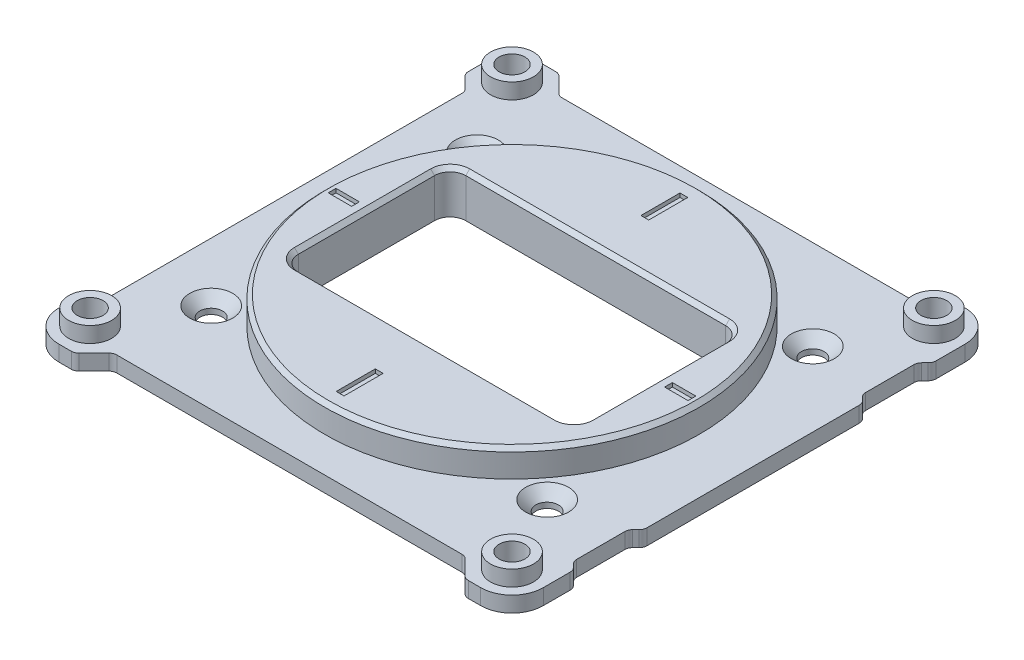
ISO-10303-21;
HEADER;
FILE_DESCRIPTION(('STEP AP214'),'2;1');
FILE_NAME('part.step','',(''),(''),'','','');
FILE_SCHEMA(('AUTOMOTIVE_DESIGN { 1 0 10303 214 1 1 1 1 }'));
ENDSEC;
DATA;
#1=APPLICATION_CONTEXT('core data for automotive mechanical design processes');
#2=APPLICATION_PROTOCOL_DEFINITION('international standard','automotive_design',2000,#1);
#3=PRODUCT_CONTEXT('',#1,'mechanical');
#4=PRODUCT('Part','Part','',(#3));
#5=PRODUCT_RELATED_PRODUCT_CATEGORY('part','',(#4));
#6=PRODUCT_DEFINITION_FORMATION('','',#4);
#7=PRODUCT_DEFINITION_CONTEXT('part definition',#1,'design');
#8=PRODUCT_DEFINITION('design','',#6,#7);
#9=PRODUCT_DEFINITION_SHAPE('','',#8);
#10=(LENGTH_UNIT() NAMED_UNIT(*) SI_UNIT(.MILLI.,.METRE.));
#11=(NAMED_UNIT(*) PLANE_ANGLE_UNIT() SI_UNIT($,.RADIAN.));
#12=(NAMED_UNIT(*) SI_UNIT($,.STERADIAN.) SOLID_ANGLE_UNIT());
#13=UNCERTAINTY_MEASURE_WITH_UNIT(LENGTH_MEASURE(1.E-05),#10,'distance_accuracy_value','');
#14=(GEOMETRIC_REPRESENTATION_CONTEXT(3) GLOBAL_UNCERTAINTY_ASSIGNED_CONTEXT((#13)) GLOBAL_UNIT_ASSIGNED_CONTEXT((#10,
#11,#12)) REPRESENTATION_CONTEXT('',''));
#15=CARTESIAN_POINT('',(0.,0.,0.));
#16=DIRECTION('',(0.,0.,1.));
#17=DIRECTION('',(1.,0.,0.));
#18=AXIS2_PLACEMENT_3D('',#15,#16,#17);
#19=CARTESIAN_POINT('',(0.,5.,0.));
#20=DIRECTION('',(0.,1.,0.));
#21=DIRECTION('',(0.,0.,1.));
#22=AXIS2_PLACEMENT_3D('',#19,#20,#21);
#23=PLANE('',#22);
#24=DIRECTION('',(0.,0.,-1.));
#25=VECTOR('',#24,1.);
#26=CARTESIAN_POINT('',(-25.7219178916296,5.,-1.93984585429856));
#27=LINE('',#26,#25);
#28=CARTESIAN_POINT('',(-25.7219178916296,5.,-0.939845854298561));
#29=VERTEX_POINT('',#28);
#30=CARTESIAN_POINT('',(-25.7219178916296,5.,-1.93984585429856));
#31=VERTEX_POINT('',#30);
#32=EDGE_CURVE('E310',#29,#31,#27,.T.);
#33=ORIENTED_EDGE('',*,*,#32,.T.);
#34=DIRECTION('',(-1.,0.,0.));
#35=VECTOR('',#34,1.);
#36=CARTESIAN_POINT('',(-28.7219178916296,5.,-1.93984585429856));
#37=LINE('',#36,#35);
#38=CARTESIAN_POINT('',(-28.7219178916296,5.,-1.93984585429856));
#39=VERTEX_POINT('',#38);
#40=EDGE_CURVE('E316',#31,#39,#37,.T.);
#41=ORIENTED_EDGE('',*,*,#40,.T.);
#42=DIRECTION('',(0.,0.,1.));
#43=VECTOR('',#42,1.);
#44=CARTESIAN_POINT('',(-28.7219178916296,5.,-1.93984585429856));
#45=LINE('',#44,#43);
#46=CARTESIAN_POINT('',(-28.7219178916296,5.,-0.939845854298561));
#47=VERTEX_POINT('',#46);
#48=EDGE_CURVE('E319',#39,#47,#45,.T.);
#49=ORIENTED_EDGE('',*,*,#48,.T.);
#50=DIRECTION('',(1.,0.,0.));
#51=VECTOR('',#50,1.);
#52=CARTESIAN_POINT('',(-28.7219178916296,5.,-0.939845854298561));
#53=LINE('',#52,#51);
#54=EDGE_CURVE('E301',#47,#29,#53,.T.);
#55=ORIENTED_EDGE('',*,*,#54,.T.);
#56=EDGE_LOOP('',(#33,#41,#49,#55));
#57=FACE_BOUND('',#56,.T.);
#58=ADVANCED_FACE('F17',(#57),#23,.T.);
#59=CARTESIAN_POINT('',(0.,5.,0.));
#60=DIRECTION('',(0.,1.,0.));
#61=DIRECTION('',(0.,0.,1.));
#62=AXIS2_PLACEMENT_3D('',#59,#60,#61);
#63=PLANE('',#62);
#64=DIRECTION('',(1.,0.,0.));
#65=VECTOR('',#64,1.);
#66=CARTESIAN_POINT('',(17.3362551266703,5.,-0.939845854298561));
#67=LINE('',#66,#65);
#68=CARTESIAN_POINT('',(14.3362551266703,5.,-0.939845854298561));
#69=VERTEX_POINT('',#68);
#70=CARTESIAN_POINT('',(17.3362551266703,5.,-0.939845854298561));
#71=VERTEX_POINT('',#70);
#72=EDGE_CURVE('E286',#69,#71,#67,.T.);
#73=ORIENTED_EDGE('',*,*,#72,.T.);
#74=DIRECTION('',(0.,0.,-1.));
#75=VECTOR('',#74,1.);
#76=CARTESIAN_POINT('',(17.3362551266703,5.,-1.93984585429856));
#77=LINE('',#76,#75);
#78=CARTESIAN_POINT('',(17.3362551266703,5.,-1.93984585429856));
#79=VERTEX_POINT('',#78);
#80=EDGE_CURVE('E292',#71,#79,#77,.T.);
#81=ORIENTED_EDGE('',*,*,#80,.T.);
#82=DIRECTION('',(-1.,0.,0.));
#83=VECTOR('',#82,1.);
#84=CARTESIAN_POINT('',(17.3362551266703,5.,-1.93984585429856));
#85=LINE('',#84,#83);
#86=CARTESIAN_POINT('',(14.3362551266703,5.,-1.93984585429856));
#87=VERTEX_POINT('',#86);
#88=EDGE_CURVE('E295',#79,#87,#85,.T.);
#89=ORIENTED_EDGE('',*,*,#88,.T.);
#90=DIRECTION('',(0.,0.,1.));
#91=VECTOR('',#90,1.);
#92=CARTESIAN_POINT('',(14.3362551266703,5.,0.));
#93=LINE('',#92,#91);
#94=EDGE_CURVE('E325',#87,#69,#93,.T.);
#95=ORIENTED_EDGE('',*,*,#94,.T.);
#96=EDGE_LOOP('',(#73,#81,#89,#95));
#97=FACE_BOUND('',#96,.T.);
#98=ADVANCED_FACE('F1748',(#97),#63,.T.);
#99=CARTESIAN_POINT('',(0.,5.,0.));
#100=DIRECTION('',(0.,1.,0.));
#101=DIRECTION('',(0.,0.,1.));
#102=AXIS2_PLACEMENT_3D('',#99,#100,#101);
#103=PLANE('',#102);
#104=DIRECTION('',(0.,0.,-1.));
#105=VECTOR('',#104,1.);
#106=CARTESIAN_POINT('',(-5.19283138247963,5.,15.5601541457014));
#107=LINE('',#106,#105);
#108=CARTESIAN_POINT('',(-5.19283138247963,5.,20.5601541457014));
#109=VERTEX_POINT('',#108);
#110=CARTESIAN_POINT('',(-5.19283138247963,5.,15.5601541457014));
#111=VERTEX_POINT('',#110);
#112=EDGE_CURVE('E265',#109,#111,#107,.T.);
#113=ORIENTED_EDGE('',*,*,#112,.T.);
#114=DIRECTION('',(-1.,0.,0.));
#115=VECTOR('',#114,1.);
#116=CARTESIAN_POINT('',(-6.19283138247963,5.,15.5601541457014));
#117=LINE('',#116,#115);
#118=CARTESIAN_POINT('',(-6.19283138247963,5.,15.5601541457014));
#119=VERTEX_POINT('',#118);
#120=EDGE_CURVE('E271',#111,#119,#117,.T.);
#121=ORIENTED_EDGE('',*,*,#120,.T.);
#122=DIRECTION('',(0.,0.,1.));
#123=VECTOR('',#122,1.);
#124=CARTESIAN_POINT('',(-6.19283138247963,5.,15.5601541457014));
#125=LINE('',#124,#123);
#126=CARTESIAN_POINT('',(-6.19283138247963,5.,20.5601541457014));
#127=VERTEX_POINT('',#126);
#128=EDGE_CURVE('E274',#119,#127,#125,.T.);
#129=ORIENTED_EDGE('',*,*,#128,.T.);
#130=DIRECTION('',(1.,0.,0.));
#131=VECTOR('',#130,1.);
#132=CARTESIAN_POINT('',(0.,5.,20.5601541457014));
#133=LINE('',#132,#131);
#134=EDGE_CURVE('E322',#127,#109,#133,.T.);
#135=ORIENTED_EDGE('',*,*,#134,.T.);
#136=EDGE_LOOP('',(#113,#121,#129,#135));
#137=FACE_BOUND('',#136,.T.);
#138=ADVANCED_FACE('F1745',(#137),#103,.T.);
#139=CARTESIAN_POINT('',(0.,5.,0.));
#140=DIRECTION('',(0.,1.,0.));
#141=DIRECTION('',(0.,0.,1.));
#142=AXIS2_PLACEMENT_3D('',#139,#140,#141);
#143=PLANE('',#142);
#144=DIRECTION('',(-1.,0.,0.));
#145=VECTOR('',#144,1.);
#146=CARTESIAN_POINT('',(-6.19283138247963,5.,-23.4398458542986));
#147=LINE('',#146,#145);
#148=CARTESIAN_POINT('',(-5.19283138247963,5.,-23.4398458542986));
#149=VERTEX_POINT('',#148);
#150=CARTESIAN_POINT('',(-6.19283138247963,5.,-23.4398458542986));
#151=VERTEX_POINT('',#150);
#152=EDGE_CURVE('E244',#149,#151,#147,.T.);
#153=ORIENTED_EDGE('',*,*,#152,.T.);
#154=DIRECTION('',(0.,0.,1.));
#155=VECTOR('',#154,1.);
#156=CARTESIAN_POINT('',(-6.19283138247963,5.,-18.4398458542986));
#157=LINE('',#156,#155);
#158=CARTESIAN_POINT('',(-6.19283138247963,5.,-18.4398458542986));
#159=VERTEX_POINT('',#158);
#160=EDGE_CURVE('E250',#151,#159,#157,.T.);
#161=ORIENTED_EDGE('',*,*,#160,.T.);
#162=DIRECTION('',(1.,0.,0.));
#163=VECTOR('',#162,1.);
#164=CARTESIAN_POINT('',(-6.19283138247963,5.,-18.4398458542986));
#165=LINE('',#164,#163);
#166=CARTESIAN_POINT('',(-5.19283138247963,5.,-18.4398458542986));
#167=VERTEX_POINT('',#166);
#168=EDGE_CURVE('E253',#159,#167,#165,.T.);
#169=ORIENTED_EDGE('',*,*,#168,.T.);
#170=DIRECTION('',(0.,0.,-1.));
#171=VECTOR('',#170,1.);
#172=CARTESIAN_POINT('',(-5.19283138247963,5.,-18.4398458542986));
#173=LINE('',#172,#171);
#174=EDGE_CURVE('E235',#167,#149,#173,.T.);
#175=ORIENTED_EDGE('',*,*,#174,.T.);
#176=EDGE_LOOP('',(#153,#161,#169,#175));
#177=FACE_BOUND('',#176,.T.);
#178=ADVANCED_FACE('F1741',(#177),#143,.T.);
#179=CARTESIAN_POINT('',(-28.7219178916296,5.,-1.93984585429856));
#180=DIRECTION('',(-1.,0.,0.));
#181=DIRECTION('',(0.,0.,1.));
#182=AXIS2_PLACEMENT_3D('',#179,#180,#181);
#183=PLANE('',#182);
#184=DIRECTION('',(0.,1.,0.));
#185=VECTOR('',#184,1.);
#186=CARTESIAN_POINT('',(-28.7219178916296,5.,-0.939845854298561));
#187=LINE('',#186,#185);
#188=CARTESIAN_POINT('',(-28.7219178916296,5.5,-0.939845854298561));
#189=VERTEX_POINT('',#188);
#190=EDGE_CURVE('E304',#189,#47,#187,.F.);
#191=ORIENTED_EDGE('',*,*,#190,.T.);
#192=ORIENTED_EDGE('',*,*,#48,.F.);
#193=DIRECTION('',(0.,1.,0.));
#194=VECTOR('',#193,1.);
#195=CARTESIAN_POINT('',(-28.7219178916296,5.,-1.93984585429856));
#196=LINE('',#195,#194);
#197=CARTESIAN_POINT('',(-28.7219178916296,5.5,-1.93984585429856));
#198=VERTEX_POINT('',#197);
#199=EDGE_CURVE('E313',#39,#198,#196,.T.);
#200=ORIENTED_EDGE('',*,*,#199,.T.);
#201=DIRECTION('',(0.,0.,1.));
#202=VECTOR('',#201,1.);
#203=CARTESIAN_POINT('',(-28.7219178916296,5.5,-1.43984585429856));
#204=LINE('',#203,#202);
#205=EDGE_CURVE('E215',#189,#198,#204,.F.);
#206=ORIENTED_EDGE('',*,*,#205,.F.);
#207=EDGE_LOOP('',(#191,#192,#200,#206));
#208=FACE_BOUND('',#207,.T.);
#209=ADVANCED_FACE('F1737',(#208),#183,.F.);
#210=CARTESIAN_POINT('',(-28.7219178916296,5.,-1.93984585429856));
#211=DIRECTION('',(0.,0.,-1.));
#212=DIRECTION('',(-1.,0.,0.));
#213=AXIS2_PLACEMENT_3D('',#210,#211,#212);
#214=PLANE('',#213);
#215=ORIENTED_EDGE('',*,*,#199,.F.);
#216=ORIENTED_EDGE('',*,*,#40,.F.);
#217=DIRECTION('',(0.,1.,0.));
#218=VECTOR('',#217,1.);
#219=CARTESIAN_POINT('',(-25.7219178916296,5.,-1.93984585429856));
#220=LINE('',#219,#218);
#221=CARTESIAN_POINT('',(-25.7219178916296,5.5,-1.93984585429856));
#222=VERTEX_POINT('',#221);
#223=EDGE_CURVE('E307',#31,#222,#220,.T.);
#224=ORIENTED_EDGE('',*,*,#223,.T.);
#225=DIRECTION('',(1.,0.,0.));
#226=VECTOR('',#225,1.);
#227=CARTESIAN_POINT('',(-5.69283138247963,5.5,-1.93984585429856));
#228=LINE('',#227,#226);
#229=EDGE_CURVE('E940',#198,#222,#228,.T.);
#230=ORIENTED_EDGE('',*,*,#229,.F.);
#231=EDGE_LOOP('',(#215,#216,#224,#230));
#232=FACE_BOUND('',#231,.T.);
#233=ADVANCED_FACE('F1733',(#232),#214,.F.);
#234=CARTESIAN_POINT('',(-25.7219178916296,5.,-1.93984585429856));
#235=DIRECTION('',(1.,0.,0.));
#236=DIRECTION('',(0.,0.,-1.));
#237=AXIS2_PLACEMENT_3D('',#234,#235,#236);
#238=PLANE('',#237);
#239=ORIENTED_EDGE('',*,*,#223,.F.);
#240=ORIENTED_EDGE('',*,*,#32,.F.);
#241=DIRECTION('',(0.,1.,0.));
#242=VECTOR('',#241,1.);
#243=CARTESIAN_POINT('',(-25.7219178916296,5.,-0.939845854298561));
#244=LINE('',#243,#242);
#245=CARTESIAN_POINT('',(-25.7219178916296,5.5,-0.939845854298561));
#246=VERTEX_POINT('',#245);
#247=EDGE_CURVE('E298',#29,#246,#244,.T.);
#248=ORIENTED_EDGE('',*,*,#247,.T.);
#249=DIRECTION('',(0.,0.,1.));
#250=VECTOR('',#249,1.);
#251=CARTESIAN_POINT('',(-25.7219178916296,5.5,-1.43984585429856));
#252=LINE('',#251,#250);
#253=EDGE_CURVE('E946',#222,#246,#252,.T.);
#254=ORIENTED_EDGE('',*,*,#253,.F.);
#255=EDGE_LOOP('',(#239,#240,#248,#254));
#256=FACE_BOUND('',#255,.T.);
#257=ADVANCED_FACE('F1729',(#256),#238,.F.);
#258=CARTESIAN_POINT('',(-28.7219178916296,5.,-0.939845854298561));
#259=DIRECTION('',(0.,0.,1.));
#260=DIRECTION('',(1.,0.,0.));
#261=AXIS2_PLACEMENT_3D('',#258,#259,#260);
#262=PLANE('',#261);
#263=ORIENTED_EDGE('',*,*,#247,.F.);
#264=ORIENTED_EDGE('',*,*,#54,.F.);
#265=ORIENTED_EDGE('',*,*,#190,.F.);
#266=DIRECTION('',(1.,0.,0.));
#267=VECTOR('',#266,1.);
#268=CARTESIAN_POINT('',(-5.69283138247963,5.5,-0.939845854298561));
#269=LINE('',#268,#267);
#270=EDGE_CURVE('E950',#246,#189,#269,.F.);
#271=ORIENTED_EDGE('',*,*,#270,.F.);
#272=EDGE_LOOP('',(#263,#264,#265,#271));
#273=FACE_BOUND('',#272,.T.);
#274=ADVANCED_FACE('F1725',(#273),#262,.F.);
#275=CARTESIAN_POINT('',(17.3362551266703,5.,-1.93984585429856));
#276=DIRECTION('',(0.,0.,-1.));
#277=DIRECTION('',(-1.,0.,0.));
#278=AXIS2_PLACEMENT_3D('',#275,#276,#277);
#279=PLANE('',#278);
#280=DIRECTION('',(0.,1.,0.));
#281=VECTOR('',#280,1.);
#282=CARTESIAN_POINT('',(14.3362551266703,5.,-1.93984585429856));
#283=LINE('',#282,#281);
#284=CARTESIAN_POINT('',(14.3362551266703,5.5,-1.93984585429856));
#285=VERTEX_POINT('',#284);
#286=EDGE_CURVE('E280',#285,#87,#283,.F.);
#287=ORIENTED_EDGE('',*,*,#286,.T.);
#288=ORIENTED_EDGE('',*,*,#88,.F.);
#289=DIRECTION('',(0.,1.,0.));
#290=VECTOR('',#289,1.);
#291=CARTESIAN_POINT('',(17.3362551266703,5.,-1.93984585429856));
#292=LINE('',#291,#290);
#293=CARTESIAN_POINT('',(17.3362551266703,5.5,-1.93984585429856));
#294=VERTEX_POINT('',#293);
#295=EDGE_CURVE('E289',#79,#294,#292,.T.);
#296=ORIENTED_EDGE('',*,*,#295,.T.);
#297=DIRECTION('',(1.,0.,0.));
#298=VECTOR('',#297,1.);
#299=CARTESIAN_POINT('',(-5.69283138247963,5.5,-1.93984585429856));
#300=LINE('',#299,#298);
#301=EDGE_CURVE('E954',#285,#294,#300,.T.);
#302=ORIENTED_EDGE('',*,*,#301,.F.);
#303=EDGE_LOOP('',(#287,#288,#296,#302));
#304=FACE_BOUND('',#303,.T.);
#305=ADVANCED_FACE('F1721',(#304),#279,.F.);
#306=CARTESIAN_POINT('',(17.3362551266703,5.,-1.93984585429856));
#307=DIRECTION('',(1.,0.,0.));
#308=DIRECTION('',(0.,0.,-1.));
#309=AXIS2_PLACEMENT_3D('',#306,#307,#308);
#310=PLANE('',#309);
#311=ORIENTED_EDGE('',*,*,#295,.F.);
#312=ORIENTED_EDGE('',*,*,#80,.F.);
#313=DIRECTION('',(0.,1.,0.));
#314=VECTOR('',#313,1.);
#315=CARTESIAN_POINT('',(17.3362551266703,5.,-0.939845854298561));
#316=LINE('',#315,#314);
#317=CARTESIAN_POINT('',(17.3362551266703,5.5,-0.939845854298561));
#318=VERTEX_POINT('',#317);
#319=EDGE_CURVE('E283',#71,#318,#316,.T.);
#320=ORIENTED_EDGE('',*,*,#319,.T.);
#321=DIRECTION('',(0.,0.,1.));
#322=VECTOR('',#321,1.);
#323=CARTESIAN_POINT('',(17.3362551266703,5.5,-1.43984585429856));
#324=LINE('',#323,#322);
#325=EDGE_CURVE('E957',#294,#318,#324,.T.);
#326=ORIENTED_EDGE('',*,*,#325,.F.);
#327=EDGE_LOOP('',(#311,#312,#320,#326));
#328=FACE_BOUND('',#327,.T.);
#329=ADVANCED_FACE('F1717',(#328),#310,.F.);
#330=CARTESIAN_POINT('',(17.3362551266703,5.,-0.939845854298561));
#331=DIRECTION('',(0.,0.,1.));
#332=DIRECTION('',(1.,0.,0.));
#333=AXIS2_PLACEMENT_3D('',#330,#331,#332);
#334=PLANE('',#333);
#335=ORIENTED_EDGE('',*,*,#319,.F.);
#336=ORIENTED_EDGE('',*,*,#72,.F.);
#337=DIRECTION('',(0.,1.,0.));
#338=VECTOR('',#337,1.);
#339=CARTESIAN_POINT('',(14.3362551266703,5.,-0.939845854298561));
#340=LINE('',#339,#338);
#341=CARTESIAN_POINT('',(14.3362551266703,5.5,-0.939845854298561));
#342=VERTEX_POINT('',#341);
#343=EDGE_CURVE('E277',#69,#342,#340,.T.);
#344=ORIENTED_EDGE('',*,*,#343,.T.);
#345=DIRECTION('',(1.,0.,0.));
#346=VECTOR('',#345,1.);
#347=CARTESIAN_POINT('',(-5.69283138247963,5.5,-0.939845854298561));
#348=LINE('',#347,#346);
#349=EDGE_CURVE('E960',#318,#342,#348,.F.);
#350=ORIENTED_EDGE('',*,*,#349,.F.);
#351=EDGE_LOOP('',(#335,#336,#344,#350));
#352=FACE_BOUND('',#351,.T.);
#353=ADVANCED_FACE('F1713',(#352),#334,.F.);
#354=CARTESIAN_POINT('',(14.3362551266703,5.,-1.93984585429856));
#355=DIRECTION('',(-1.,0.,0.));
#356=DIRECTION('',(0.,0.,1.));
#357=AXIS2_PLACEMENT_3D('',#354,#355,#356);
#358=PLANE('',#357);
#359=ORIENTED_EDGE('',*,*,#343,.F.);
#360=ORIENTED_EDGE('',*,*,#94,.F.);
#361=ORIENTED_EDGE('',*,*,#286,.F.);
#362=DIRECTION('',(0.,0.,1.));
#363=VECTOR('',#362,1.);
#364=CARTESIAN_POINT('',(14.3362551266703,5.5,-1.43984585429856));
#365=LINE('',#364,#363);
#366=EDGE_CURVE('E963',#342,#285,#365,.F.);
#367=ORIENTED_EDGE('',*,*,#366,.F.);
#368=EDGE_LOOP('',(#359,#360,#361,#367));
#369=FACE_BOUND('',#368,.T.);
#370=ADVANCED_FACE('F1709',(#369),#358,.F.);
#371=CARTESIAN_POINT('',(-6.19283138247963,5.,15.5601541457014));
#372=DIRECTION('',(-1.,0.,0.));
#373=DIRECTION('',(0.,0.,1.));
#374=AXIS2_PLACEMENT_3D('',#371,#372,#373);
#375=PLANE('',#374);
#376=DIRECTION('',(0.,1.,0.));
#377=VECTOR('',#376,1.);
#378=CARTESIAN_POINT('',(-6.19283138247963,5.,20.5601541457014));
#379=LINE('',#378,#377);
#380=CARTESIAN_POINT('',(-6.19283138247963,5.5,20.5601541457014));
#381=VERTEX_POINT('',#380);
#382=EDGE_CURVE('E259',#381,#127,#379,.F.);
#383=ORIENTED_EDGE('',*,*,#382,.T.);
#384=ORIENTED_EDGE('',*,*,#128,.F.);
#385=DIRECTION('',(0.,1.,0.));
#386=VECTOR('',#385,1.);
#387=CARTESIAN_POINT('',(-6.19283138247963,5.,15.5601541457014));
#388=LINE('',#387,#386);
#389=CARTESIAN_POINT('',(-6.19283138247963,5.5,15.5601541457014));
#390=VERTEX_POINT('',#389);
#391=EDGE_CURVE('E268',#119,#390,#388,.T.);
#392=ORIENTED_EDGE('',*,*,#391,.T.);
#393=DIRECTION('',(0.,0.,1.));
#394=VECTOR('',#393,1.);
#395=CARTESIAN_POINT('',(-6.19283138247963,5.5,-1.43984585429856));
#396=LINE('',#395,#394);
#397=EDGE_CURVE('E966',#381,#390,#396,.F.);
#398=ORIENTED_EDGE('',*,*,#397,.F.);
#399=EDGE_LOOP('',(#383,#384,#392,#398));
#400=FACE_BOUND('',#399,.T.);
#401=ADVANCED_FACE('F1705',(#400),#375,.F.);
#402=CARTESIAN_POINT('',(-6.19283138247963,5.,15.5601541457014));
#403=DIRECTION('',(0.,0.,-1.));
#404=DIRECTION('',(-1.,0.,0.));
#405=AXIS2_PLACEMENT_3D('',#402,#403,#404);
#406=PLANE('',#405);
#407=ORIENTED_EDGE('',*,*,#391,.F.);
#408=ORIENTED_EDGE('',*,*,#120,.F.);
#409=DIRECTION('',(0.,1.,0.));
#410=VECTOR('',#409,1.);
#411=CARTESIAN_POINT('',(-5.19283138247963,5.,15.5601541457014));
#412=LINE('',#411,#410);
#413=CARTESIAN_POINT('',(-5.19283138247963,5.5,15.5601541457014));
#414=VERTEX_POINT('',#413);
#415=EDGE_CURVE('E262',#111,#414,#412,.T.);
#416=ORIENTED_EDGE('',*,*,#415,.T.);
#417=DIRECTION('',(1.,0.,0.));
#418=VECTOR('',#417,1.);
#419=CARTESIAN_POINT('',(-5.69283138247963,5.5,15.5601541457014));
#420=LINE('',#419,#418);
#421=EDGE_CURVE('E969',#390,#414,#420,.T.);
#422=ORIENTED_EDGE('',*,*,#421,.F.);
#423=EDGE_LOOP('',(#407,#408,#416,#422));
#424=FACE_BOUND('',#423,.T.);
#425=ADVANCED_FACE('F1701',(#424),#406,.F.);
#426=CARTESIAN_POINT('',(-5.19283138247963,5.,15.5601541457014));
#427=DIRECTION('',(1.,0.,0.));
#428=DIRECTION('',(0.,0.,-1.));
#429=AXIS2_PLACEMENT_3D('',#426,#427,#428);
#430=PLANE('',#429);
#431=ORIENTED_EDGE('',*,*,#415,.F.);
#432=ORIENTED_EDGE('',*,*,#112,.F.);
#433=DIRECTION('',(0.,1.,0.));
#434=VECTOR('',#433,1.);
#435=CARTESIAN_POINT('',(-5.19283138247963,5.,20.5601541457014));
#436=LINE('',#435,#434);
#437=CARTESIAN_POINT('',(-5.19283138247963,5.5,20.5601541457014));
#438=VERTEX_POINT('',#437);
#439=EDGE_CURVE('E256',#109,#438,#436,.T.);
#440=ORIENTED_EDGE('',*,*,#439,.T.);
#441=DIRECTION('',(0.,0.,1.));
#442=VECTOR('',#441,1.);
#443=CARTESIAN_POINT('',(-5.19283138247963,5.5,-1.43984585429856));
#444=LINE('',#443,#442);
#445=EDGE_CURVE('E972',#414,#438,#444,.T.);
#446=ORIENTED_EDGE('',*,*,#445,.F.);
#447=EDGE_LOOP('',(#431,#432,#440,#446));
#448=FACE_BOUND('',#447,.T.);
#449=ADVANCED_FACE('F1697',(#448),#430,.F.);
#450=CARTESIAN_POINT('',(-6.19283138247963,5.,20.5601541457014));
#451=DIRECTION('',(0.,0.,1.));
#452=DIRECTION('',(1.,0.,0.));
#453=AXIS2_PLACEMENT_3D('',#450,#451,#452);
#454=PLANE('',#453);
#455=ORIENTED_EDGE('',*,*,#439,.F.);
#456=ORIENTED_EDGE('',*,*,#134,.F.);
#457=ORIENTED_EDGE('',*,*,#382,.F.);
#458=DIRECTION('',(1.,0.,0.));
#459=VECTOR('',#458,1.);
#460=CARTESIAN_POINT('',(-5.69283138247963,5.5,20.5601541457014));
#461=LINE('',#460,#459);
#462=EDGE_CURVE('E975',#438,#381,#461,.F.);
#463=ORIENTED_EDGE('',*,*,#462,.F.);
#464=EDGE_LOOP('',(#455,#456,#457,#463));
#465=FACE_BOUND('',#464,.T.);
#466=ADVANCED_FACE('F1693',(#465),#454,.F.);
#467=CARTESIAN_POINT('',(-6.19283138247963,5.,-18.4398458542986));
#468=DIRECTION('',(0.,0.,1.));
#469=DIRECTION('',(1.,0.,0.));
#470=AXIS2_PLACEMENT_3D('',#467,#468,#469);
#471=PLANE('',#470);
#472=DIRECTION('',(0.,1.,0.));
#473=VECTOR('',#472,1.);
#474=CARTESIAN_POINT('',(-5.19283138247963,5.,-18.4398458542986));
#475=LINE('',#474,#473);
#476=CARTESIAN_POINT('',(-5.19283138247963,5.5,-18.4398458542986));
#477=VERTEX_POINT('',#476);
#478=EDGE_CURVE('E238',#477,#167,#475,.F.);
#479=ORIENTED_EDGE('',*,*,#478,.T.);
#480=ORIENTED_EDGE('',*,*,#168,.F.);
#481=DIRECTION('',(0.,1.,0.));
#482=VECTOR('',#481,1.);
#483=CARTESIAN_POINT('',(-6.19283138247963,5.,-18.4398458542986));
#484=LINE('',#483,#482);
#485=CARTESIAN_POINT('',(-6.19283138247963,5.5,-18.4398458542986));
#486=VERTEX_POINT('',#485);
#487=EDGE_CURVE('E247',#159,#486,#484,.T.);
#488=ORIENTED_EDGE('',*,*,#487,.T.);
#489=DIRECTION('',(1.,0.,0.));
#490=VECTOR('',#489,1.);
#491=CARTESIAN_POINT('',(-5.69283138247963,5.5,-18.4398458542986));
#492=LINE('',#491,#490);
#493=EDGE_CURVE('E978',#477,#486,#492,.F.);
#494=ORIENTED_EDGE('',*,*,#493,.F.);
#495=EDGE_LOOP('',(#479,#480,#488,#494));
#496=FACE_BOUND('',#495,.T.);
#497=ADVANCED_FACE('F1689',(#496),#471,.F.);
#498=CARTESIAN_POINT('',(-6.19283138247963,5.,-18.4398458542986));
#499=DIRECTION('',(-1.,0.,0.));
#500=DIRECTION('',(0.,0.,1.));
#501=AXIS2_PLACEMENT_3D('',#498,#499,#500);
#502=PLANE('',#501);
#503=ORIENTED_EDGE('',*,*,#487,.F.);
#504=ORIENTED_EDGE('',*,*,#160,.F.);
#505=DIRECTION('',(0.,1.,0.));
#506=VECTOR('',#505,1.);
#507=CARTESIAN_POINT('',(-6.19283138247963,5.,-23.4398458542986));
#508=LINE('',#507,#506);
#509=CARTESIAN_POINT('',(-6.19283138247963,5.5,-23.4398458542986));
#510=VERTEX_POINT('',#509);
#511=EDGE_CURVE('E241',#151,#510,#508,.T.);
#512=ORIENTED_EDGE('',*,*,#511,.T.);
#513=DIRECTION('',(0.,0.,1.));
#514=VECTOR('',#513,1.);
#515=CARTESIAN_POINT('',(-6.19283138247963,5.5,-1.43984585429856));
#516=LINE('',#515,#514);
#517=EDGE_CURVE('E981',#486,#510,#516,.F.);
#518=ORIENTED_EDGE('',*,*,#517,.F.);
#519=EDGE_LOOP('',(#503,#504,#512,#518));
#520=FACE_BOUND('',#519,.T.);
#521=ADVANCED_FACE('F1685',(#520),#502,.F.);
#522=CARTESIAN_POINT('',(-6.19283138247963,5.,-23.4398458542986));
#523=DIRECTION('',(0.,0.,-1.));
#524=DIRECTION('',(-1.,0.,0.));
#525=AXIS2_PLACEMENT_3D('',#522,#523,#524);
#526=PLANE('',#525);
#527=ORIENTED_EDGE('',*,*,#511,.F.);
#528=ORIENTED_EDGE('',*,*,#152,.F.);
#529=DIRECTION('',(0.,1.,0.));
#530=VECTOR('',#529,1.);
#531=CARTESIAN_POINT('',(-5.19283138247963,5.,-23.4398458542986));
#532=LINE('',#531,#530);
#533=CARTESIAN_POINT('',(-5.19283138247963,5.5,-23.4398458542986));
#534=VERTEX_POINT('',#533);
#535=EDGE_CURVE('E232',#149,#534,#532,.T.);
#536=ORIENTED_EDGE('',*,*,#535,.T.);
#537=DIRECTION('',(1.,0.,0.));
#538=VECTOR('',#537,1.);
#539=CARTESIAN_POINT('',(-5.69283138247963,5.5,-23.4398458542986));
#540=LINE('',#539,#538);
#541=EDGE_CURVE('E984',#510,#534,#540,.T.);
#542=ORIENTED_EDGE('',*,*,#541,.F.);
#543=EDGE_LOOP('',(#527,#528,#536,#542));
#544=FACE_BOUND('',#543,.T.);
#545=ADVANCED_FACE('F1681',(#544),#526,.F.);
#546=CARTESIAN_POINT('',(-5.19283138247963,5.,-18.4398458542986));
#547=DIRECTION('',(1.,0.,0.));
#548=DIRECTION('',(0.,0.,-1.));
#549=AXIS2_PLACEMENT_3D('',#546,#547,#548);
#550=PLANE('',#549);
#551=ORIENTED_EDGE('',*,*,#535,.F.);
#552=ORIENTED_EDGE('',*,*,#174,.F.);
#553=ORIENTED_EDGE('',*,*,#478,.F.);
#554=DIRECTION('',(0.,0.,1.));
#555=VECTOR('',#554,1.);
#556=CARTESIAN_POINT('',(-5.19283138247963,5.5,-1.43984585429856));
#557=LINE('',#556,#555);
#558=EDGE_CURVE('E987',#534,#477,#557,.T.);
#559=ORIENTED_EDGE('',*,*,#558,.F.);
#560=EDGE_LOOP('',(#551,#552,#553,#559));
#561=FACE_BOUND('',#560,.T.);
#562=ADVANCED_FACE('F934',(#561),#550,.F.);
#563=CARTESIAN_POINT('',(-5.69283138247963,5.,-1.43984585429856));
#564=DIRECTION('',(0.,-1.,0.));
#565=DIRECTION('',(0.,0.,-1.));
#566=AXIS2_PLACEMENT_3D('',#563,#564,#565);
#567=CONICAL_SURFACE('',#566,24.,0.785398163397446);
#568=CARTESIAN_POINT('',(-5.69283138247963,5.,-1.43984585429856));
#569=DIRECTION('',(0.,-1.,0.));
#570=DIRECTION('',(0.,0.,-1.));
#571=AXIS2_PLACEMENT_3D('',#568,#569,#570);
#572=CIRCLE('',#571,24.);
#573=CARTESIAN_POINT('',(-5.69283138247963,5.,-25.4398458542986));
#574=VERTEX_POINT('',#573);
#575=EDGE_CURVE('E227',#574,#574,#572,.T.);
#576=ORIENTED_EDGE('',*,*,#575,.F.);
#577=EDGE_LOOP('',(#576));
#578=FACE_BOUND('',#577,.T.);
#579=CARTESIAN_POINT('',(-5.69283138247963,5.5,-1.43984585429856));
#580=DIRECTION('',(0.,-1.,0.));
#581=DIRECTION('',(0.,0.,-1.));
#582=AXIS2_PLACEMENT_3D('',#579,#580,#581);
#583=CIRCLE('',#582,23.5);
#584=CARTESIAN_POINT('',(-5.69283138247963,5.5,-24.9398458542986));
#585=VERTEX_POINT('',#584);
#586=EDGE_CURVE('E20',#585,#585,#583,.F.);
#587=ORIENTED_EDGE('',*,*,#586,.F.);
#588=EDGE_LOOP('',(#587));
#589=FACE_BOUND('',#588,.T.);
#590=ADVANCED_FACE('F931',(#578,#589),#567,.T.);
#591=CARTESIAN_POINT('',(-5.69283138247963,5.5,-1.43984585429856));
#592=DIRECTION('',(0.,1.,0.));
#593=DIRECTION('',(0.,0.,1.));
#594=AXIS2_PLACEMENT_3D('',#591,#592,#593);
#595=PLANE('',#594);
#596=ORIENTED_EDGE('',*,*,#541,.T.);
#597=ORIENTED_EDGE('',*,*,#558,.T.);
#598=ORIENTED_EDGE('',*,*,#493,.T.);
#599=ORIENTED_EDGE('',*,*,#517,.T.);
#600=EDGE_LOOP('',(#596,#597,#598,#599));
#601=FACE_BOUND('',#600,.T.);
#602=ORIENTED_EDGE('',*,*,#445,.T.);
#603=ORIENTED_EDGE('',*,*,#462,.T.);
#604=ORIENTED_EDGE('',*,*,#397,.T.);
#605=ORIENTED_EDGE('',*,*,#421,.T.);
#606=EDGE_LOOP('',(#602,#603,#604,#605));
#607=FACE_BOUND('',#606,.T.);
#608=ORIENTED_EDGE('',*,*,#349,.T.);
#609=ORIENTED_EDGE('',*,*,#366,.T.);
#610=ORIENTED_EDGE('',*,*,#301,.T.);
#611=ORIENTED_EDGE('',*,*,#325,.T.);
#612=EDGE_LOOP('',(#608,#609,#610,#611));
#613=FACE_BOUND('',#612,.T.);
#614=ORIENTED_EDGE('',*,*,#253,.T.);
#615=ORIENTED_EDGE('',*,*,#270,.T.);
#616=ORIENTED_EDGE('',*,*,#205,.T.);
#617=ORIENTED_EDGE('',*,*,#229,.T.);
#618=EDGE_LOOP('',(#614,#615,#616,#617));
#619=FACE_BOUND('',#618,.T.);
#620=ORIENTED_EDGE('',*,*,#586,.T.);
#621=EDGE_LOOP('',(#620));
#622=FACE_BOUND('',#621,.T.);
#623=DIRECTION('',(1.,0.,0.));
#624=VECTOR('',#623,1.);
#625=CARTESIAN_POINT('',(-22.324092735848,5.5,9.7767568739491));
#626=LINE('',#625,#624);
#627=CARTESIAN_POINT('',(-22.324092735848,5.49999999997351,9.77675687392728));
#628=VERTEX_POINT('',#627);
#629=CARTESIAN_POINT('',(10.9384299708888,5.49999999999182,9.77675687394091));
#630=VERTEX_POINT('',#629);
#631=EDGE_CURVE('E217',#628,#630,#626,.T.);
#632=ORIENTED_EDGE('',*,*,#631,.F.);
#633=CARTESIAN_POINT('',(-22.324092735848,5.49999999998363,7.27675687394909));
#634=DIRECTION('',(0.,1.,0.));
#635=DIRECTION('',(0.,0.,1.));
#636=AXIS2_PLACEMENT_3D('',#633,#634,#635);
#637=CIRCLE('',#636,2.49999999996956);
#638=CARTESIAN_POINT('',(-24.8240927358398,5.49999999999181,7.27675687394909));
#639=VERTEX_POINT('',#638);
#640=EDGE_CURVE('E208',#628,#639,#637,.F.);
#641=ORIENTED_EDGE('',*,*,#640,.T.);
#642=DIRECTION('',(0.,0.,1.));
#643=VECTOR('',#642,1.);
#644=CARTESIAN_POINT('',(-24.824092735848,5.5,-10.1564485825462));
#645=LINE('',#644,#643);
#646=CARTESIAN_POINT('',(-24.8240927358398,5.49999999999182,-10.1564485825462));
#647=VERTEX_POINT('',#646);
#648=EDGE_CURVE('E200',#647,#639,#645,.T.);
#649=ORIENTED_EDGE('',*,*,#648,.F.);
#650=CARTESIAN_POINT('',(-22.324092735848,5.49999999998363,-10.1564485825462));
#651=DIRECTION('',(0.,1.,0.));
#652=DIRECTION('',(0.,0.,1.));
#653=AXIS2_PLACEMENT_3D('',#650,#651,#652);
#654=CIRCLE('',#653,2.49999999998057);
#655=CARTESIAN_POINT('',(-22.324092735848,5.49999999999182,-12.656448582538));
#656=VERTEX_POINT('',#655);
#657=EDGE_CURVE('E181',#647,#656,#654,.F.);
#658=ORIENTED_EDGE('',*,*,#657,.T.);
#659=DIRECTION('',(1.,0.,0.));
#660=VECTOR('',#659,1.);
#661=CARTESIAN_POINT('',(-22.324092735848,5.5,-12.6564485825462));
#662=LINE('',#661,#660);
#663=CARTESIAN_POINT('',(10.9384299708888,5.49999999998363,-12.6564485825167));
#664=VERTEX_POINT('',#663);
#665=EDGE_CURVE('E192',#664,#656,#662,.F.);
#666=ORIENTED_EDGE('',*,*,#665,.F.);
#667=CARTESIAN_POINT('',(10.9384299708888,5.49999999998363,-10.1564485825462));
#668=DIRECTION('',(0.,1.,0.));
#669=DIRECTION('',(0.,0.,1.));
#670=AXIS2_PLACEMENT_3D('',#667,#668,#669);
#671=CIRCLE('',#670,2.49999999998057);
#672=CARTESIAN_POINT('',(13.4384299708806,5.49999999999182,-10.1564485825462));
#673=VERTEX_POINT('',#672);
#674=EDGE_CURVE('E224',#664,#673,#671,.F.);
#675=ORIENTED_EDGE('',*,*,#674,.T.);
#676=DIRECTION('',(0.,0.,1.));
#677=VECTOR('',#676,1.);
#678=CARTESIAN_POINT('',(13.4384299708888,5.5,-10.1564485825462));
#679=LINE('',#678,#677);
#680=CARTESIAN_POINT('',(13.4384299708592,5.49999999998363,7.27675687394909));
#681=VERTEX_POINT('',#680);
#682=EDGE_CURVE('E221',#681,#673,#679,.F.);
#683=ORIENTED_EDGE('',*,*,#682,.F.);
#684=CARTESIAN_POINT('',(10.9384299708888,5.49999999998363,7.27675687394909));
#685=DIRECTION('',(0.,1.,0.));
#686=DIRECTION('',(0.,0.,1.));
#687=AXIS2_PLACEMENT_3D('',#684,#685,#686);
#688=CIRCLE('',#687,2.49999999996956);
#689=EDGE_CURVE('E577',#681,#630,#688,.F.);
#690=ORIENTED_EDGE('',*,*,#689,.T.);
#691=EDGE_LOOP('',(#632,#641,#649,#658,#666,#675,#683,#690));
#692=FACE_BOUND('',#691,.T.);
#693=ADVANCED_FACE('F207',(#601,#607,#613,#619,#622,#692),#595,.T.);
#694=CARTESIAN_POINT('',(1.80367459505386,2.,-1.8036745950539));
#695=DIRECTION('',(0.707106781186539,0.,-0.707106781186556));
#696=DIRECTION('',(-0.707106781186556,0.,-0.707106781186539));
#697=AXIS2_PLACEMENT_3D('',#694,#695,#696);
#698=PLANE('',#697);
#699=DIRECTION('',(-0.707106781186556,0.,-0.707106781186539));
#700=VECTOR('',#699,1.);
#701=CARTESIAN_POINT('',(1.80367459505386,2.,-1.8036745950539));
#702=LINE('',#701,#700);
#703=CARTESIAN_POINT('',(24.6000618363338,2.,20.9927126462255));
#704=VERTEX_POINT('',#703);
#705=CARTESIAN_POINT('',(25.0142753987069,2.,21.4069262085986));
#706=VERTEX_POINT('',#705);
#707=EDGE_CURVE('E991',#704,#706,#702,.F.);
#708=ORIENTED_EDGE('',*,*,#707,.T.);
#709=DIRECTION('',(0.,-1.,0.));
#710=VECTOR('',#709,1.);
#711=CARTESIAN_POINT('',(25.0142753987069,2.,21.4069262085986));
#712=LINE('',#711,#710);
#713=CARTESIAN_POINT('',(25.0142753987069,0.,21.4069262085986));
#714=VERTEX_POINT('',#713);
#715=EDGE_CURVE('E552',#714,#706,#712,.F.);
#716=ORIENTED_EDGE('',*,*,#715,.F.);
#717=DIRECTION('',(-0.707106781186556,0.,-0.707106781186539));
#718=VECTOR('',#717,1.);
#719=CARTESIAN_POINT('',(1.80367459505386,0.,-1.8036745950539));
#720=LINE('',#719,#718);
#721=CARTESIAN_POINT('',(24.6000618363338,0.,20.9927126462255));
#722=VERTEX_POINT('',#721);
#723=EDGE_CURVE('E990',#714,#722,#720,.T.);
#724=ORIENTED_EDGE('',*,*,#723,.T.);
#725=DIRECTION('',(0.,-1.,0.));
#726=VECTOR('',#725,1.);
#727=CARTESIAN_POINT('',(24.6000618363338,2.,20.9927126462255));
#728=LINE('',#727,#726);
#729=EDGE_CURVE('E546',#722,#704,#728,.F.);
#730=ORIENTED_EDGE('',*,*,#729,.T.);
#731=EDGE_LOOP('',(#708,#716,#724,#730));
#732=FACE_BOUND('',#731,.T.);
#733=ADVANCED_FACE('F1620',(#732),#698,.T.);
#734=CARTESIAN_POINT('',(19.0034940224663,2.,19.0034940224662));
#735=DIRECTION('',(0.707106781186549,0.,0.707106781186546));
#736=DIRECTION('',(0.707106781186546,0.,-0.707106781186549));
#737=AXIS2_PLACEMENT_3D('',#734,#735,#736);
#738=PLANE('',#737);
#739=DIRECTION('',(0.707106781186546,0.,-0.707106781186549));
#740=VECTOR('',#739,1.);
#741=CARTESIAN_POINT('',(19.0034940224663,2.,19.0034940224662));
#742=LINE('',#741,#740);
#743=CARTESIAN_POINT('',(25.0142753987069,2.,12.9927126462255));
#744=VERTEX_POINT('',#743);
#745=CARTESIAN_POINT('',(24.6000618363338,2.,13.4069262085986));
#746=VERTEX_POINT('',#745);
#747=EDGE_CURVE('E997',#744,#746,#742,.F.);
#748=ORIENTED_EDGE('',*,*,#747,.T.);
#749=DIRECTION('',(0.,-1.,0.));
#750=VECTOR('',#749,1.);
#751=CARTESIAN_POINT('',(24.6000618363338,2.,13.4069262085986));
#752=LINE('',#751,#750);
#753=CARTESIAN_POINT('',(24.6000618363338,0.,13.4069262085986));
#754=VERTEX_POINT('',#753);
#755=EDGE_CURVE('E549',#746,#754,#752,.T.);
#756=ORIENTED_EDGE('',*,*,#755,.T.);
#757=DIRECTION('',(0.707106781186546,0.,-0.707106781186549));
#758=VECTOR('',#757,1.);
#759=CARTESIAN_POINT('',(19.0034940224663,0.,19.0034940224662));
#760=LINE('',#759,#758);
#761=CARTESIAN_POINT('',(25.0142753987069,0.,12.9927126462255));
#762=VERTEX_POINT('',#761);
#763=EDGE_CURVE('E994',#754,#762,#760,.T.);
#764=ORIENTED_EDGE('',*,*,#763,.T.);
#765=DIRECTION('',(0.,-1.,0.));
#766=VECTOR('',#765,1.);
#767=CARTESIAN_POINT('',(25.0142753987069,2.,12.9927126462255));
#768=LINE('',#767,#766);
#769=EDGE_CURVE('E539',#744,#762,#768,.T.);
#770=ORIENTED_EDGE('',*,*,#769,.F.);
#771=EDGE_LOOP('',(#748,#756,#764,#770));
#772=FACE_BOUND('',#771,.T.);
#773=ADVANCED_FACE('F1634',(#772),#738,.T.);
#774=CARTESIAN_POINT('',(20.3036745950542,2.,-20.3036745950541));
#775=DIRECTION('',(0.707106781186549,0.,-0.707106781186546));
#776=DIRECTION('',(-0.707106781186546,0.,-0.707106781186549));
#777=AXIS2_PLACEMENT_3D('',#774,#775,#776);
#778=PLANE('',#777);
#779=DIRECTION('',(-0.707106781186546,0.,-0.707106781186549));
#780=VECTOR('',#779,1.);
#781=CARTESIAN_POINT('',(20.3036745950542,2.,-20.3036745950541));
#782=LINE('',#781,#780);
#783=CARTESIAN_POINT('',(24.6000618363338,2.,-16.0072873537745));
#784=VERTEX_POINT('',#783);
#785=CARTESIAN_POINT('',(25.0142753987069,2.,-15.5930737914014));
#786=VERTEX_POINT('',#785);
#787=EDGE_CURVE('E1001',#784,#786,#782,.F.);
#788=ORIENTED_EDGE('',*,*,#787,.T.);
#789=DIRECTION('',(0.,-1.,0.));
#790=VECTOR('',#789,1.);
#791=CARTESIAN_POINT('',(25.0142753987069,2.,-15.5930737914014));
#792=LINE('',#791,#790);
#793=CARTESIAN_POINT('',(25.0142753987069,0.,-15.5930737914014));
#794=VERTEX_POINT('',#793);
#795=EDGE_CURVE('E540',#794,#786,#792,.F.);
#796=ORIENTED_EDGE('',*,*,#795,.F.);
#797=DIRECTION('',(-0.707106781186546,0.,-0.707106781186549));
#798=VECTOR('',#797,1.);
#799=CARTESIAN_POINT('',(20.3036745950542,0.,-20.3036745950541));
#800=LINE('',#799,#798);
#801=CARTESIAN_POINT('',(24.6000618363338,0.,-16.0072873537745));
#802=VERTEX_POINT('',#801);
#803=EDGE_CURVE('E1000',#794,#802,#800,.T.);
#804=ORIENTED_EDGE('',*,*,#803,.T.);
#805=DIRECTION('',(0.,-1.,0.));
#806=VECTOR('',#805,1.);
#807=CARTESIAN_POINT('',(24.6000618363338,2.,-16.0072873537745));
#808=LINE('',#807,#806);
#809=EDGE_CURVE('E533',#802,#784,#808,.F.);
#810=ORIENTED_EDGE('',*,*,#809,.T.);
#811=EDGE_LOOP('',(#788,#796,#804,#810));
#812=FACE_BOUND('',#811,.T.);
#813=ADVANCED_FACE('F1646',(#812),#778,.T.);
#814=CARTESIAN_POINT('',(0.503494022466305,2.,0.503494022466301));
#815=DIRECTION('',(-0.70710678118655,0.,-0.707106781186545));
#816=DIRECTION('',(-0.707106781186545,0.,0.70710678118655));
#817=AXIS2_PLACEMENT_3D('',#814,#815,#816);
#818=PLANE('',#817);
#819=DIRECTION('',(0.,-1.,0.));
#820=VECTOR('',#819,1.);
#821=CARTESIAN_POINT('',(25.0142753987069,2.,-24.0072873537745));
#822=LINE('',#821,#820);
#823=CARTESIAN_POINT('',(25.0142753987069,2.,-24.0072873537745));
#824=VERTEX_POINT('',#823);
#825=CARTESIAN_POINT('',(25.0142753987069,0.,-24.0072873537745));
#826=VERTEX_POINT('',#825);
#827=EDGE_CURVE('E529',#824,#826,#822,.T.);
#828=ORIENTED_EDGE('',*,*,#827,.F.);
#829=DIRECTION('',(-0.707106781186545,0.,0.70710678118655));
#830=VECTOR('',#829,1.);
#831=CARTESIAN_POINT('',(0.503494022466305,2.,0.503494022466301));
#832=LINE('',#831,#830);
#833=CARTESIAN_POINT('',(24.6000618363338,2.,-23.5930737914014));
#834=VERTEX_POINT('',#833);
#835=EDGE_CURVE('E1004',#834,#824,#832,.F.);
#836=ORIENTED_EDGE('',*,*,#835,.F.);
#837=DIRECTION('',(0.,-1.,0.));
#838=VECTOR('',#837,1.);
#839=CARTESIAN_POINT('',(24.6000618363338,2.,-23.5930737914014));
#840=LINE('',#839,#838);
#841=CARTESIAN_POINT('',(24.6000618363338,0.,-23.5930737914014));
#842=VERTEX_POINT('',#841);
#843=EDGE_CURVE('E536',#834,#842,#840,.T.);
#844=ORIENTED_EDGE('',*,*,#843,.T.);
#845=DIRECTION('',(-0.707106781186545,0.,0.70710678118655));
#846=VECTOR('',#845,1.);
#847=CARTESIAN_POINT('',(0.503494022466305,0.,0.503494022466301));
#848=LINE('',#847,#846);
#849=EDGE_CURVE('E231',#826,#842,#848,.T.);
#850=ORIENTED_EDGE('',*,*,#849,.F.);
#851=EDGE_LOOP('',(#828,#836,#844,#850));
#852=FACE_BOUND('',#851,.T.);
#853=ADVANCED_FACE('F1658',(#852),#818,.F.);
#854=CARTESIAN_POINT('',(-32.6928313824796,4.,25.5601541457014));
#855=DIRECTION('',(0.,-1.,0.));
#856=DIRECTION('',(0.,0.,-1.));
#857=AXIS2_PLACEMENT_3D('',#854,#855,#856);
#858=CYLINDRICAL_SURFACE('',#857,2.75);
#859=CARTESIAN_POINT('',(-32.6928313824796,2.,25.5601541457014));
#860=DIRECTION('',(0.,-1.,0.));
#861=DIRECTION('',(0.,0.,-1.));
#862=AXIS2_PLACEMENT_3D('',#859,#860,#861);
#863=CIRCLE('',#862,2.75);
#864=CARTESIAN_POINT('',(-32.6928313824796,2.,22.8101541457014));
#865=VERTEX_POINT('',#864);
#866=EDGE_CURVE('E505',#865,#865,#863,.T.);
#867=ORIENTED_EDGE('',*,*,#866,.F.);
#868=EDGE_LOOP('',(#867));
#869=FACE_BOUND('',#868,.T.);
#870=CARTESIAN_POINT('',(-32.6928313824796,4.,25.5601541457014));
#871=DIRECTION('',(0.,-1.,0.));
#872=DIRECTION('',(0.,0.,-1.));
#873=AXIS2_PLACEMENT_3D('',#870,#871,#872);
#874=CIRCLE('',#873,2.75);
#875=CARTESIAN_POINT('',(-32.6928313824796,4.,22.8101541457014));
#876=VERTEX_POINT('',#875);
#877=EDGE_CURVE('E585',#876,#876,#874,.F.);
#878=ORIENTED_EDGE('',*,*,#877,.F.);
#879=EDGE_LOOP('',(#878));
#880=FACE_BOUND('',#879,.T.);
#881=ADVANCED_FACE('F610',(#869,#880),#858,.T.);
#882=CARTESIAN_POINT('',(21.3071686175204,4.,25.5601541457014));
#883=DIRECTION('',(0.,-1.,0.));
#884=DIRECTION('',(0.,0.,-1.));
#885=AXIS2_PLACEMENT_3D('',#882,#883,#884);
#886=CYLINDRICAL_SURFACE('',#885,2.75);
#887=CARTESIAN_POINT('',(21.3071686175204,2.,25.5601541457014));
#888=DIRECTION('',(0.,-1.,0.));
#889=DIRECTION('',(0.,0.,-1.));
#890=AXIS2_PLACEMENT_3D('',#887,#888,#889);
#891=CIRCLE('',#890,2.75);
#892=CARTESIAN_POINT('',(21.3071686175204,2.,22.8101541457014));
#893=VERTEX_POINT('',#892);
#894=EDGE_CURVE('E502',#893,#893,#891,.T.);
#895=ORIENTED_EDGE('',*,*,#894,.F.);
#896=EDGE_LOOP('',(#895));
#897=FACE_BOUND('',#896,.T.);
#898=CARTESIAN_POINT('',(21.3071686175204,4.,25.5601541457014));
#899=DIRECTION('',(0.,-1.,0.));
#900=DIRECTION('',(0.,0.,-1.));
#901=AXIS2_PLACEMENT_3D('',#898,#899,#900);
#902=CIRCLE('',#901,2.75);
#903=CARTESIAN_POINT('',(21.3071686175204,4.,22.8101541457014));
#904=VERTEX_POINT('',#903);
#905=EDGE_CURVE('E193',#904,#904,#902,.F.);
#906=ORIENTED_EDGE('',*,*,#905,.F.);
#907=EDGE_LOOP('',(#906));
#908=FACE_BOUND('',#907,.T.);
#909=ADVANCED_FACE('F599',(#897,#908),#886,.T.);
#910=CARTESIAN_POINT('',(21.3071686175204,4.,-28.4398458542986));
#911=DIRECTION('',(0.,-1.,0.));
#912=DIRECTION('',(0.,0.,-1.));
#913=AXIS2_PLACEMENT_3D('',#910,#911,#912);
#914=CYLINDRICAL_SURFACE('',#913,2.75);
#915=CARTESIAN_POINT('',(21.3071686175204,2.,-28.4398458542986));
#916=DIRECTION('',(0.,-1.,0.));
#917=DIRECTION('',(0.,0.,-1.));
#918=AXIS2_PLACEMENT_3D('',#915,#916,#917);
#919=CIRCLE('',#918,2.75);
#920=CARTESIAN_POINT('',(21.3071686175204,2.,-31.1898458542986));
#921=VERTEX_POINT('',#920);
#922=EDGE_CURVE('E499',#921,#921,#919,.T.);
#923=ORIENTED_EDGE('',*,*,#922,.F.);
#924=EDGE_LOOP('',(#923));
#925=FACE_BOUND('',#924,.T.);
#926=CARTESIAN_POINT('',(21.3071686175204,4.,-28.4398458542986));
#927=DIRECTION('',(0.,-1.,0.));
#928=DIRECTION('',(0.,0.,-1.));
#929=AXIS2_PLACEMENT_3D('',#926,#927,#928);
#930=CIRCLE('',#929,2.75);
#931=CARTESIAN_POINT('',(21.3071686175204,4.,-31.1898458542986));
#932=VERTEX_POINT('',#931);
#933=EDGE_CURVE('E230',#932,#932,#930,.F.);
#934=ORIENTED_EDGE('',*,*,#933,.F.);
#935=EDGE_LOOP('',(#934));
#936=FACE_BOUND('',#935,.T.);
#937=ADVANCED_FACE('F596',(#925,#936),#914,.T.);
#938=CARTESIAN_POINT('',(-32.6928313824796,4.,-28.4398458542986));
#939=DIRECTION('',(0.,-1.,0.));
#940=DIRECTION('',(0.,0.,-1.));
#941=AXIS2_PLACEMENT_3D('',#938,#939,#940);
#942=CYLINDRICAL_SURFACE('',#941,2.75);
#943=CARTESIAN_POINT('',(-32.6928313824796,2.,-28.4398458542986));
#944=DIRECTION('',(0.,-1.,0.));
#945=DIRECTION('',(0.,0.,-1.));
#946=AXIS2_PLACEMENT_3D('',#943,#944,#945);
#947=CIRCLE('',#946,2.75);
#948=CARTESIAN_POINT('',(-32.6928313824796,2.,-31.1898458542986));
#949=VERTEX_POINT('',#948);
#950=EDGE_CURVE('E496',#949,#949,#947,.T.);
#951=ORIENTED_EDGE('',*,*,#950,.F.);
#952=EDGE_LOOP('',(#951));
#953=FACE_BOUND('',#952,.T.);
#954=CARTESIAN_POINT('',(-32.6928313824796,4.,-28.4398458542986));
#955=DIRECTION('',(0.,-1.,0.));
#956=DIRECTION('',(0.,0.,-1.));
#957=AXIS2_PLACEMENT_3D('',#954,#955,#956);
#958=CIRCLE('',#957,2.75);
#959=CARTESIAN_POINT('',(-32.6928313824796,4.,-31.1898458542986));
#960=VERTEX_POINT('',#959);
#961=EDGE_CURVE('E588',#960,#960,#958,.F.);
#962=ORIENTED_EDGE('',*,*,#961,.F.);
#963=EDGE_LOOP('',(#962));
#964=FACE_BOUND('',#963,.T.);
#965=ADVANCED_FACE('F598',(#953,#964),#942,.T.);
#966=CARTESIAN_POINT('',(-5.69283138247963,5.5,-1.43984585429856));
#967=DIRECTION('',(0.,-1.,0.));
#968=DIRECTION('',(0.,0.,-1.));
#969=AXIS2_PLACEMENT_3D('',#966,#967,#968);
#970=CYLINDRICAL_SURFACE('',#969,24.);
#971=CARTESIAN_POINT('',(-5.69283138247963,2.,-1.43984585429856));
#972=DIRECTION('',(0.,-1.,0.));
#973=DIRECTION('',(0.,0.,-1.));
#974=AXIS2_PLACEMENT_3D('',#971,#972,#973);
#975=CIRCLE('',#974,24.);
#976=CARTESIAN_POINT('',(-5.69283138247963,2.,-25.4398458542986));
#977=VERTEX_POINT('',#976);
#978=EDGE_CURVE('E492',#977,#977,#975,.T.);
#979=ORIENTED_EDGE('',*,*,#978,.F.);
#980=EDGE_LOOP('',(#979));
#981=FACE_BOUND('',#980,.T.);
#982=ORIENTED_EDGE('',*,*,#575,.T.);
#983=EDGE_LOOP('',(#982));
#984=FACE_BOUND('',#983,.T.);
#985=ADVANCED_FACE('F607',(#981,#984),#970,.T.);
#986=CARTESIAN_POINT('',(-27.1928313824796,1.99999999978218,-18.4398458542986));
#987=DIRECTION('',(0.,1.,0.));
#988=DIRECTION('',(0.,0.,1.));
#989=AXIS2_PLACEMENT_3D('',#986,#987,#988);
#990=CONICAL_SURFACE('',#989,2.74999999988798,0.785398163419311);
#991=CARTESIAN_POINT('',(-27.1928313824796,0.7,-18.4398458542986));
#992=DIRECTION('',(0.,1.,0.));
#993=DIRECTION('',(0.,0.,1.));
#994=AXIS2_PLACEMENT_3D('',#991,#992,#993);
#995=CIRCLE('',#994,1.45);
#996=CARTESIAN_POINT('',(-27.1928313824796,0.7,-16.9898458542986));
#997=VERTEX_POINT('',#996);
#998=EDGE_CURVE('E425',#997,#997,#995,.F.);
#999=ORIENTED_EDGE('',*,*,#998,.T.);
#1000=EDGE_LOOP('',(#999));
#1001=FACE_BOUND('',#1000,.T.);
#1002=CARTESIAN_POINT('',(-27.1928313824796,1.99999999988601,-18.4398458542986));
#1003=DIRECTION('',(0.,1.,0.));
#1004=DIRECTION('',(0.,0.,1.));
#1005=AXIS2_PLACEMENT_3D('',#1002,#1003,#1004);
#1006=CIRCLE('',#1005,2.74999999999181);
#1007=CARTESIAN_POINT('',(-27.1928313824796,1.99999999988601,-15.6898458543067));
#1008=VERTEX_POINT('',#1007);
#1009=EDGE_CURVE('E517',#1008,#1008,#1006,.F.);
#1010=ORIENTED_EDGE('',*,*,#1009,.F.);
#1011=EDGE_LOOP('',(#1010));
#1012=FACE_BOUND('',#1011,.T.);
#1013=ADVANCED_FACE('F918',(#1001,#1012),#990,.F.);
#1014=CARTESIAN_POINT('',(15.8071686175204,1.99999999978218,-18.4398458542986));
#1015=DIRECTION('',(0.,1.,0.));
#1016=DIRECTION('',(0.,0.,1.));
#1017=AXIS2_PLACEMENT_3D('',#1014,#1015,#1016);
#1018=CONICAL_SURFACE('',#1017,2.74999999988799,0.785398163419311);
#1019=CARTESIAN_POINT('',(15.8071686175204,0.7,-18.4398458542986));
#1020=DIRECTION('',(0.,1.,0.));
#1021=DIRECTION('',(0.,0.,1.));
#1022=AXIS2_PLACEMENT_3D('',#1019,#1020,#1021);
#1023=CIRCLE('',#1022,1.45);
#1024=CARTESIAN_POINT('',(15.8071686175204,0.7,-16.9898458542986));
#1025=VERTEX_POINT('',#1024);
#1026=EDGE_CURVE('E1040',#1025,#1025,#1023,.F.);
#1027=ORIENTED_EDGE('',*,*,#1026,.T.);
#1028=EDGE_LOOP('',(#1027));
#1029=FACE_BOUND('',#1028,.T.);
#1030=CARTESIAN_POINT('',(15.8071686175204,1.999999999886,-18.4398458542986));
#1031=DIRECTION('',(0.,1.,0.));
#1032=DIRECTION('',(0.,0.,1.));
#1033=AXIS2_PLACEMENT_3D('',#1030,#1031,#1032);
#1034=CIRCLE('',#1033,2.74999999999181);
#1035=CARTESIAN_POINT('',(15.8071686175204,1.999999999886,-15.6898458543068));
#1036=VERTEX_POINT('',#1035);
#1037=EDGE_CURVE('E514',#1036,#1036,#1034,.F.);
#1038=ORIENTED_EDGE('',*,*,#1037,.F.);
#1039=EDGE_LOOP('',(#1038));
#1040=FACE_BOUND('',#1039,.T.);
#1041=ADVANCED_FACE('F914',(#1029,#1040),#1018,.F.);
#1042=CARTESIAN_POINT('',(15.8071686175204,1.99999999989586,15.5601541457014));
#1043=DIRECTION('',(0.,1.,0.));
#1044=DIRECTION('',(0.,0.,1.));
#1045=AXIS2_PLACEMENT_3D('',#1042,#1043,#1044);
#1046=CONICAL_SURFACE('',#1045,2.74999999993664,0.785398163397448);
#1047=CARTESIAN_POINT('',(15.8071686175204,0.7,15.5601541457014));
#1048=DIRECTION('',(0.,1.,0.));
#1049=DIRECTION('',(0.,0.,1.));
#1050=AXIS2_PLACEMENT_3D('',#1047,#1048,#1049);
#1051=CIRCLE('',#1050,1.45);
#1052=CARTESIAN_POINT('',(15.8071686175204,0.7,17.0101541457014));
#1053=VERTEX_POINT('',#1052);
#1054=EDGE_CURVE('E1043',#1053,#1053,#1051,.F.);
#1055=ORIENTED_EDGE('',*,*,#1054,.T.);
#1056=EDGE_LOOP('',(#1055));
#1057=FACE_BOUND('',#1056,.T.);
#1058=CARTESIAN_POINT('',(15.8071686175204,2.00000000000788,15.5601541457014));
#1059=DIRECTION('',(0.,1.,0.));
#1060=DIRECTION('',(0.,0.,1.));
#1061=AXIS2_PLACEMENT_3D('',#1058,#1059,#1060);
#1062=CIRCLE('',#1061,2.75000000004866);
#1063=CARTESIAN_POINT('',(15.8071686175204,2.00000000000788,18.3101541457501));
#1064=VERTEX_POINT('',#1063);
#1065=EDGE_CURVE('E511',#1064,#1064,#1062,.F.);
#1066=ORIENTED_EDGE('',*,*,#1065,.F.);
#1067=EDGE_LOOP('',(#1066));
#1068=FACE_BOUND('',#1067,.T.);
#1069=ADVANCED_FACE('F910',(#1057,#1068),#1046,.F.);
#1070=CARTESIAN_POINT('',(-27.1928313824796,2.00000000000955,15.5601541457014));
#1071=DIRECTION('',(0.,1.,0.));
#1072=DIRECTION('',(0.,0.,1.));
#1073=AXIS2_PLACEMENT_3D('',#1070,#1071,#1072);
#1074=CONICAL_SURFACE('',#1073,2.74999999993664,0.785398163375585);
#1075=CARTESIAN_POINT('',(-27.1928313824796,0.7,15.5601541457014));
#1076=DIRECTION('',(0.,1.,0.));
#1077=DIRECTION('',(0.,0.,1.));
#1078=AXIS2_PLACEMENT_3D('',#1075,#1076,#1077);
#1079=CIRCLE('',#1078,1.45);
#1080=CARTESIAN_POINT('',(-27.1928313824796,0.7,17.0101541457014));
#1081=VERTEX_POINT('',#1080);
#1082=EDGE_CURVE('E421',#1081,#1081,#1079,.F.);
#1083=ORIENTED_EDGE('',*,*,#1082,.T.);
#1084=EDGE_LOOP('',(#1083));
#1085=FACE_BOUND('',#1084,.T.);
#1086=CARTESIAN_POINT('',(-27.1928313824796,2.00000000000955,15.5601541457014));
#1087=DIRECTION('',(0.,1.,0.));
#1088=DIRECTION('',(0.,0.,1.));
#1089=AXIS2_PLACEMENT_3D('',#1086,#1087,#1088);
#1090=CIRCLE('',#1089,2.74999999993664);
#1091=CARTESIAN_POINT('',(-27.1928313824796,2.00000000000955,18.3101541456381));
#1092=VERTEX_POINT('',#1091);
#1093=EDGE_CURVE('E508',#1092,#1092,#1090,.F.);
#1094=ORIENTED_EDGE('',*,*,#1093,.F.);
#1095=EDGE_LOOP('',(#1094));
#1096=FACE_BOUND('',#1095,.T.);
#1097=ADVANCED_FACE('F907',(#1085,#1096),#1074,.F.);
#1098=CARTESIAN_POINT('',(21.3071686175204,4.,-28.4398458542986));
#1099=DIRECTION('',(0.,1.,0.));
#1100=DIRECTION('',(0.,0.,1.));
#1101=AXIS2_PLACEMENT_3D('',#1098,#1099,#1100);
#1102=PLANE('',#1101);
#1103=ORIENTED_EDGE('',*,*,#933,.T.);
#1104=EDGE_LOOP('',(#1103));
#1105=FACE_BOUND('',#1104,.T.);
#1106=CARTESIAN_POINT('',(21.3071686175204,4.,-28.4398458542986));
#1107=DIRECTION('',(0.,-1.,0.));
#1108=DIRECTION('',(0.,0.,-1.));
#1109=AXIS2_PLACEMENT_3D('',#1106,#1107,#1108);
#1110=CIRCLE('',#1109,1.65);
#1111=CARTESIAN_POINT('',(21.3071686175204,4.,-30.0898458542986));
#1112=VERTEX_POINT('',#1111);
#1113=EDGE_CURVE('E418',#1112,#1112,#1110,.T.);
#1114=ORIENTED_EDGE('',*,*,#1113,.T.);
#1115=EDGE_LOOP('',(#1114));
#1116=FACE_BOUND('',#1115,.T.);
#1117=ADVANCED_FACE('F593',(#1105,#1116),#1102,.T.);
#1118=CARTESIAN_POINT('',(-32.6928313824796,4.,-28.4398458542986));
#1119=DIRECTION('',(0.,1.,0.));
#1120=DIRECTION('',(0.,0.,1.));
#1121=AXIS2_PLACEMENT_3D('',#1118,#1119,#1120);
#1122=PLANE('',#1121);
#1123=CARTESIAN_POINT('',(-32.6928313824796,4.,-28.4398458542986));
#1124=DIRECTION('',(0.,-1.,0.));
#1125=DIRECTION('',(0.,0.,-1.));
#1126=AXIS2_PLACEMENT_3D('',#1123,#1124,#1125);
#1127=CIRCLE('',#1126,1.65);
#1128=CARTESIAN_POINT('',(-32.6928313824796,4.,-30.0898458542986));
#1129=VERTEX_POINT('',#1128);
#1130=EDGE_CURVE('E415',#1129,#1129,#1127,.T.);
#1131=ORIENTED_EDGE('',*,*,#1130,.T.);
#1132=EDGE_LOOP('',(#1131));
#1133=FACE_BOUND('',#1132,.T.);
#1134=ORIENTED_EDGE('',*,*,#961,.T.);
#1135=EDGE_LOOP('',(#1134));
#1136=FACE_BOUND('',#1135,.T.);
#1137=ADVANCED_FACE('F900',(#1133,#1136),#1122,.T.);
#1138=CARTESIAN_POINT('',(-32.6928313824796,4.,25.5601541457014));
#1139=DIRECTION('',(0.,1.,0.));
#1140=DIRECTION('',(0.,0.,1.));
#1141=AXIS2_PLACEMENT_3D('',#1138,#1139,#1140);
#1142=PLANE('',#1141);
#1143=ORIENTED_EDGE('',*,*,#877,.T.);
#1144=EDGE_LOOP('',(#1143));
#1145=FACE_BOUND('',#1144,.T.);
#1146=CARTESIAN_POINT('',(-32.6928313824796,4.,25.5601541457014));
#1147=DIRECTION('',(0.,-1.,0.));
#1148=DIRECTION('',(0.,0.,-1.));
#1149=AXIS2_PLACEMENT_3D('',#1146,#1147,#1148);
#1150=CIRCLE('',#1149,1.65);
#1151=CARTESIAN_POINT('',(-32.6928313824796,4.,23.9101541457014));
#1152=VERTEX_POINT('',#1151);
#1153=EDGE_CURVE('E412',#1152,#1152,#1150,.T.);
#1154=ORIENTED_EDGE('',*,*,#1153,.T.);
#1155=EDGE_LOOP('',(#1154));
#1156=FACE_BOUND('',#1155,.T.);
#1157=ADVANCED_FACE('F896',(#1145,#1156),#1142,.T.);
#1158=CARTESIAN_POINT('',(21.3071686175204,4.,25.5601541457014));
#1159=DIRECTION('',(0.,1.,0.));
#1160=DIRECTION('',(0.,0.,1.));
#1161=AXIS2_PLACEMENT_3D('',#1158,#1159,#1160);
#1162=PLANE('',#1161);
#1163=ORIENTED_EDGE('',*,*,#905,.T.);
#1164=EDGE_LOOP('',(#1163));
#1165=FACE_BOUND('',#1164,.T.);
#1166=CARTESIAN_POINT('',(21.3071686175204,4.,25.5601541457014));
#1167=DIRECTION('',(0.,-1.,0.));
#1168=DIRECTION('',(0.,0.,-1.));
#1169=AXIS2_PLACEMENT_3D('',#1166,#1167,#1168);
#1170=CIRCLE('',#1169,1.65);
#1171=CARTESIAN_POINT('',(21.3071686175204,4.,23.9101541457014));
#1172=VERTEX_POINT('',#1171);
#1173=EDGE_CURVE('E408',#1172,#1172,#1170,.T.);
#1174=ORIENTED_EDGE('',*,*,#1173,.T.);
#1175=EDGE_LOOP('',(#1174));
#1176=FACE_BOUND('',#1175,.T.);
#1177=ADVANCED_FACE('F893',(#1165,#1176),#1162,.T.);
#1178=CARTESIAN_POINT('',(-22.324092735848,5.49999999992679,-10.1564485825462));
#1179=DIRECTION('',(0.,1.,0.));
#1180=DIRECTION('',(0.,0.,1.));
#1181=AXIS2_PLACEMENT_3D('',#1178,#1179,#1180);
#1182=CONICAL_SURFACE('',#1181,2.49999999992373,0.785398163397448);
#1183=ORIENTED_EDGE('',*,*,#657,.F.);
#1184=DIRECTION('',(-0.707106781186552,0.707106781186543,0.));
#1185=VECTOR('',#1184,1.);
#1186=CARTESIAN_POINT('',(-24.324092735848,5.00000000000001,-10.1564485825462));
#1187=LINE('',#1186,#1185);
#1188=CARTESIAN_POINT('',(-24.324092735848,5.,-10.1564485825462));
#1189=VERTEX_POINT('',#1188);
#1190=EDGE_CURVE('E186',#1189,#647,#1187,.T.);
#1191=ORIENTED_EDGE('',*,*,#1190,.F.);
#1192=CARTESIAN_POINT('',(-22.324092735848,5.,-10.1564485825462));
#1193=DIRECTION('',(0.,1.,0.));
#1194=DIRECTION('',(0.,0.,1.));
#1195=AXIS2_PLACEMENT_3D('',#1192,#1193,#1194);
#1196=CIRCLE('',#1195,2.);
#1197=CARTESIAN_POINT('',(-22.324092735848,5.,-12.1564485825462));
#1198=VERTEX_POINT('',#1197);
#1199=EDGE_CURVE('E411',#1189,#1198,#1196,.F.);
#1200=ORIENTED_EDGE('',*,*,#1199,.T.);
#1201=DIRECTION('',(0.,-0.707106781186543,0.707106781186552));
#1202=VECTOR('',#1201,1.);
#1203=CARTESIAN_POINT('',(-22.324092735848,5.00000000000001,-12.1564485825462));
#1204=LINE('',#1203,#1202);
#1205=EDGE_CURVE('E189',#656,#1198,#1204,.T.);
#1206=ORIENTED_EDGE('',*,*,#1205,.F.);
#1207=EDGE_LOOP('',(#1183,#1191,#1200,#1206));
#1208=FACE_BOUND('',#1207,.T.);
#1209=ADVANCED_FACE('F183',(#1208),#1182,.F.);
#1210=CARTESIAN_POINT('',(-22.324092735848,5.00000000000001,-12.1564485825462));
#1211=DIRECTION('',(0.,0.707106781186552,0.707106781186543));
#1212=DIRECTION('',(0.,-0.707106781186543,0.707106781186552));
#1213=AXIS2_PLACEMENT_3D('',#1210,#1211,#1212);
#1214=PLANE('',#1213);
#1215=ORIENTED_EDGE('',*,*,#1205,.T.);
#1216=DIRECTION('',(-1.,0.,0.));
#1217=VECTOR('',#1216,1.);
#1218=CARTESIAN_POINT('',(-22.324092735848,5.,-12.1564485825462));
#1219=LINE('',#1218,#1217);
#1220=CARTESIAN_POINT('',(10.9384299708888,4.99999999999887,-12.1564485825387));
#1221=VERTEX_POINT('',#1220);
#1222=EDGE_CURVE('E1053',#1198,#1221,#1219,.F.);
#1223=ORIENTED_EDGE('',*,*,#1222,.T.);
#1224=DIRECTION('',(0.,-0.707106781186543,0.707106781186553));
#1225=VECTOR('',#1224,1.);
#1226=CARTESIAN_POINT('',(10.9384299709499,499000.,-499007.15644859));
#1227=LINE('',#1226,#1225);
#1228=EDGE_CURVE('E581',#1221,#664,#1227,.F.);
#1229=ORIENTED_EDGE('',*,*,#1228,.T.);
#1230=ORIENTED_EDGE('',*,*,#665,.T.);
#1231=EDGE_LOOP('',(#1215,#1223,#1229,#1230));
#1232=FACE_BOUND('',#1231,.T.);
#1233=ADVANCED_FACE('F886',(#1232),#1214,.T.);
#1234=CARTESIAN_POINT('',(10.9384299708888,5.49999999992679,-10.1564485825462));
#1235=DIRECTION('',(0.,1.,0.));
#1236=DIRECTION('',(0.,0.,1.));
#1237=AXIS2_PLACEMENT_3D('',#1234,#1235,#1236);
#1238=CONICAL_SURFACE('',#1237,2.49999999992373,0.785398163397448);
#1239=ORIENTED_EDGE('',*,*,#674,.F.);
#1240=ORIENTED_EDGE('',*,*,#1228,.F.);
#1241=CARTESIAN_POINT('',(10.9384299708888,5.,-10.1564485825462));
#1242=DIRECTION('',(0.,1.,0.));
#1243=DIRECTION('',(0.,0.,1.));
#1244=AXIS2_PLACEMENT_3D('',#1241,#1242,#1243);
#1245=CIRCLE('',#1244,2.);
#1246=CARTESIAN_POINT('',(12.9384299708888,5.,-10.1564485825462));
#1247=VERTEX_POINT('',#1246);
#1248=EDGE_CURVE('E1064',#1221,#1247,#1245,.F.);
#1249=ORIENTED_EDGE('',*,*,#1248,.T.);
#1250=DIRECTION('',(-0.707106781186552,-0.707106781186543,0.));
#1251=VECTOR('',#1250,1.);
#1252=CARTESIAN_POINT('',(12.9384299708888,5.00000000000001,-10.1564485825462));
#1253=LINE('',#1252,#1251);
#1254=EDGE_CURVE('E223',#673,#1247,#1253,.T.);
#1255=ORIENTED_EDGE('',*,*,#1254,.F.);
#1256=EDGE_LOOP('',(#1239,#1240,#1249,#1255));
#1257=FACE_BOUND('',#1256,.T.);
#1258=ADVANCED_FACE('F882',(#1257),#1238,.F.);
#1259=CARTESIAN_POINT('',(12.9384299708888,5.00000000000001,-10.1564485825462));
#1260=DIRECTION('',(-0.707106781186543,0.707106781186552,0.));
#1261=DIRECTION('',(-0.707106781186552,-0.707106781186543,0.));
#1262=AXIS2_PLACEMENT_3D('',#1259,#1260,#1261);
#1263=PLANE('',#1262);
#1264=ORIENTED_EDGE('',*,*,#1254,.T.);
#1265=DIRECTION('',(0.,0.,-1.));
#1266=VECTOR('',#1265,1.);
#1267=CARTESIAN_POINT('',(12.9384299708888,5.,-10.1564485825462));
#1268=LINE('',#1267,#1266);
#1269=CARTESIAN_POINT('',(12.9384299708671,4.99999999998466,7.27675687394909));
#1270=VERTEX_POINT('',#1269);
#1271=EDGE_CURVE('E1074',#1247,#1270,#1268,.F.);
#1272=ORIENTED_EDGE('',*,*,#1271,.T.);
#1273=DIRECTION('',(-0.707106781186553,-0.707106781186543,0.));
#1274=VECTOR('',#1273,1.);
#1275=CARTESIAN_POINT('',(499003.661673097,498995.723243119,7.27675687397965));
#1276=LINE('',#1275,#1274);
#1277=EDGE_CURVE('E579',#1270,#681,#1276,.F.);
#1278=ORIENTED_EDGE('',*,*,#1277,.T.);
#1279=ORIENTED_EDGE('',*,*,#682,.T.);
#1280=EDGE_LOOP('',(#1264,#1272,#1278,#1279));
#1281=FACE_BOUND('',#1280,.T.);
#1282=ADVANCED_FACE('F878',(#1281),#1263,.T.);
#1283=CARTESIAN_POINT('',(10.9384299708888,5.49999999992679,7.27675687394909));
#1284=DIRECTION('',(0.,1.,0.));
#1285=DIRECTION('',(0.,0.,1.));
#1286=AXIS2_PLACEMENT_3D('',#1283,#1284,#1285);
#1287=CONICAL_SURFACE('',#1286,2.49999999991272,0.785398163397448);
#1288=ORIENTED_EDGE('',*,*,#689,.F.);
#1289=ORIENTED_EDGE('',*,*,#1277,.F.);
#1290=CARTESIAN_POINT('',(10.9384299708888,5.,7.27675687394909));
#1291=DIRECTION('',(0.,1.,0.));
#1292=DIRECTION('',(0.,0.,1.));
#1293=AXIS2_PLACEMENT_3D('',#1290,#1291,#1292);
#1294=CIRCLE('',#1293,2.);
#1295=CARTESIAN_POINT('',(10.9384299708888,5.,9.27675687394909));
#1296=VERTEX_POINT('',#1295);
#1297=EDGE_CURVE('E1084',#1270,#1296,#1294,.F.);
#1298=ORIENTED_EDGE('',*,*,#1297,.T.);
#1299=DIRECTION('',(0.,0.707106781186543,0.707106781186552));
#1300=VECTOR('',#1299,1.);
#1301=CARTESIAN_POINT('',(10.9384299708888,5.00000000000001,9.2767568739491));
#1302=LINE('',#1301,#1300);
#1303=EDGE_CURVE('E220',#630,#1296,#1302,.F.);
#1304=ORIENTED_EDGE('',*,*,#1303,.F.);
#1305=EDGE_LOOP('',(#1288,#1289,#1298,#1304));
#1306=FACE_BOUND('',#1305,.T.);
#1307=ADVANCED_FACE('F874',(#1306),#1287,.F.);
#1308=CARTESIAN_POINT('',(-22.324092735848,5.00000000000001,9.2767568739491));
#1309=DIRECTION('',(0.,0.707106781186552,-0.707106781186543));
#1310=DIRECTION('',(0.,0.707106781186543,0.707106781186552));
#1311=AXIS2_PLACEMENT_3D('',#1308,#1309,#1310);
#1312=PLANE('',#1311);
#1313=DIRECTION('',(0.,-0.707106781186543,-0.707106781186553));
#1314=VECTOR('',#1313,1.);
#1315=CARTESIAN_POINT('',(-22.324092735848,498995.723243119,499000.));
#1316=LINE('',#1315,#1314);
#1317=CARTESIAN_POINT('',(-22.324092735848,4.99999999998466,9.27675687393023));
#1318=VERTEX_POINT('',#1317);
#1319=EDGE_CURVE('E576',#1318,#628,#1316,.F.);
#1320=ORIENTED_EDGE('',*,*,#1319,.T.);
#1321=ORIENTED_EDGE('',*,*,#631,.T.);
#1322=ORIENTED_EDGE('',*,*,#1303,.T.);
#1323=DIRECTION('',(1.,0.,0.));
#1324=VECTOR('',#1323,1.);
#1325=CARTESIAN_POINT('',(-22.324092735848,5.,9.2767568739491));
#1326=LINE('',#1325,#1324);
#1327=EDGE_CURVE('E1094',#1296,#1318,#1326,.F.);
#1328=ORIENTED_EDGE('',*,*,#1327,.T.);
#1329=EDGE_LOOP('',(#1320,#1321,#1322,#1328));
#1330=FACE_BOUND('',#1329,.T.);
#1331=ADVANCED_FACE('F870',(#1330),#1312,.T.);
#1332=CARTESIAN_POINT('',(-22.324092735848,5.49999999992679,7.27675687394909));
#1333=DIRECTION('',(0.,1.,0.));
#1334=DIRECTION('',(0.,0.,1.));
#1335=AXIS2_PLACEMENT_3D('',#1332,#1333,#1334);
#1336=CONICAL_SURFACE('',#1335,2.49999999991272,0.785398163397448);
#1337=CARTESIAN_POINT('',(-22.324092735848,5.,7.27675687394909));
#1338=DIRECTION('',(0.,1.,0.));
#1339=DIRECTION('',(0.,0.,1.));
#1340=AXIS2_PLACEMENT_3D('',#1337,#1338,#1339);
#1341=CIRCLE('',#1340,2.);
#1342=CARTESIAN_POINT('',(-24.324092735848,5.,7.27675687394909));
#1343=VERTEX_POINT('',#1342);
#1344=EDGE_CURVE('E1104',#1318,#1343,#1341,.F.);
#1345=ORIENTED_EDGE('',*,*,#1344,.T.);
#1346=DIRECTION('',(-0.707106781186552,0.707106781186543,0.));
#1347=VECTOR('',#1346,1.);
#1348=CARTESIAN_POINT('',(-24.324092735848,5.00000000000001,7.27675687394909));
#1349=LINE('',#1348,#1347);
#1350=EDGE_CURVE('E204',#639,#1343,#1349,.F.);
#1351=ORIENTED_EDGE('',*,*,#1350,.F.);
#1352=ORIENTED_EDGE('',*,*,#640,.F.);
#1353=ORIENTED_EDGE('',*,*,#1319,.F.);
#1354=EDGE_LOOP('',(#1345,#1351,#1352,#1353));
#1355=FACE_BOUND('',#1354,.T.);
#1356=ADVANCED_FACE('F867',(#1355),#1336,.F.);
#1357=CARTESIAN_POINT('',(-24.324092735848,5.00000000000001,-10.1564485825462));
#1358=DIRECTION('',(0.707106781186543,0.707106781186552,0.));
#1359=DIRECTION('',(-0.707106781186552,0.707106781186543,0.));
#1360=AXIS2_PLACEMENT_3D('',#1357,#1358,#1359);
#1361=PLANE('',#1360);
#1362=ORIENTED_EDGE('',*,*,#1190,.T.);
#1363=ORIENTED_EDGE('',*,*,#648,.T.);
#1364=ORIENTED_EDGE('',*,*,#1350,.T.);
#1365=DIRECTION('',(0.,0.,1.));
#1366=VECTOR('',#1365,1.);
#1367=CARTESIAN_POINT('',(-24.324092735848,5.,-10.1564485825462));
#1368=LINE('',#1367,#1366);
#1369=EDGE_CURVE('E203',#1343,#1189,#1368,.F.);
#1370=ORIENTED_EDGE('',*,*,#1369,.T.);
#1371=EDGE_LOOP('',(#1362,#1363,#1364,#1370));
#1372=FACE_BOUND('',#1371,.T.);
#1373=ADVANCED_FACE('F198',(#1372),#1361,.T.);
#1374=CARTESIAN_POINT('',(-36.6928313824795,2.,1.60556086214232E-13));
#1375=DIRECTION('',(-1.,0.,0.));
#1376=DIRECTION('',(0.,0.,1.));
#1377=AXIS2_PLACEMENT_3D('',#1374,#1375,#1376);
#1378=PLANE('',#1377);
#1379=DIRECTION('',(0.,0.,1.));
#1380=VECTOR('',#1379,1.);
#1381=CARTESIAN_POINT('',(-36.6928313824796,2.,0.));
#1382=LINE('',#1381,#1380);
#1383=CARTESIAN_POINT('',(-36.6928313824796,2.,-28.4398458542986));
#1384=VERTEX_POINT('',#1383);
#1385=CARTESIAN_POINT('',(-36.6928313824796,2.,-26.8540594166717));
#1386=VERTEX_POINT('',#1385);
#1387=EDGE_CURVE('E491',#1384,#1386,#1382,.T.);
#1388=ORIENTED_EDGE('',*,*,#1387,.F.);
#1389=DIRECTION('',(0.,-1.,0.));
#1390=VECTOR('',#1389,1.);
#1391=CARTESIAN_POINT('',(-36.6928313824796,2.,-28.4398458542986));
#1392=LINE('',#1391,#1390);
#1393=CARTESIAN_POINT('',(-36.6928313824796,0.,-28.4398458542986));
#1394=VERTEX_POINT('',#1393);
#1395=EDGE_CURVE('E407',#1394,#1384,#1392,.F.);
#1396=ORIENTED_EDGE('',*,*,#1395,.F.);
#1397=DIRECTION('',(0.,0.,1.));
#1398=VECTOR('',#1397,1.);
#1399=CARTESIAN_POINT('',(-36.6928313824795,0.,1.60556086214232E-13));
#1400=LINE('',#1399,#1398);
#1401=CARTESIAN_POINT('',(-36.6928313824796,0.,-26.8540594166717));
#1402=VERTEX_POINT('',#1401);
#1403=EDGE_CURVE('E209',#1394,#1402,#1400,.T.);
#1404=ORIENTED_EDGE('',*,*,#1403,.T.);
#1405=DIRECTION('',(0.,-1.,0.));
#1406=VECTOR('',#1405,1.);
#1407=CARTESIAN_POINT('',(-36.6928313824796,2.,-26.8540594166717));
#1408=LINE('',#1407,#1406);
#1409=EDGE_CURVE('E572',#1386,#1402,#1408,.T.);
#1410=ORIENTED_EDGE('',*,*,#1409,.F.);
#1411=EDGE_LOOP('',(#1388,#1396,#1404,#1410));
#1412=FACE_BOUND('',#1411,.T.);
#1413=ADVANCED_FACE('F860',(#1412),#1378,.T.);
#1414=CARTESIAN_POINT('',(0.,2.,-32.4398458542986));
#1415=DIRECTION('',(0.,0.,1.));
#1416=DIRECTION('',(1.,0.,0.));
#1417=AXIS2_PLACEMENT_3D('',#1414,#1415,#1416);
#1418=PLANE('',#1417);
#1419=DIRECTION('',(0.,-1.,0.));
#1420=VECTOR('',#1419,1.);
#1421=CARTESIAN_POINT('',(-32.6928313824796,2.,-32.4398458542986));
#1422=LINE('',#1421,#1420);
#1423=CARTESIAN_POINT('',(-32.6928313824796,2.,-32.4398458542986));
#1424=VERTEX_POINT('',#1423);
#1425=CARTESIAN_POINT('',(-32.6928313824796,0.,-32.4398458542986));
#1426=VERTEX_POINT('',#1425);
#1427=EDGE_CURVE('E406',#1424,#1426,#1422,.T.);
#1428=ORIENTED_EDGE('',*,*,#1427,.F.);
#1429=DIRECTION('',(1.,0.,0.));
#1430=VECTOR('',#1429,1.);
#1431=CARTESIAN_POINT('',(0.,2.,-32.4398458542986));
#1432=LINE('',#1431,#1430);
#1433=CARTESIAN_POINT('',(-31.1070449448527,2.,-32.4398458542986));
#1434=VERTEX_POINT('',#1433);
#1435=EDGE_CURVE('E495',#1434,#1424,#1432,.F.);
#1436=ORIENTED_EDGE('',*,*,#1435,.F.);
#1437=DIRECTION('',(0.,-1.,0.));
#1438=VECTOR('',#1437,1.);
#1439=CARTESIAN_POINT('',(-31.1070449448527,2.,-32.4398458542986));
#1440=LINE('',#1439,#1438);
#1441=CARTESIAN_POINT('',(-31.1070449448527,0.,-32.4398458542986));
#1442=VERTEX_POINT('',#1441);
#1443=EDGE_CURVE('E426',#1442,#1434,#1440,.F.);
#1444=ORIENTED_EDGE('',*,*,#1443,.F.);
#1445=DIRECTION('',(1.,0.,0.));
#1446=VECTOR('',#1445,1.);
#1447=CARTESIAN_POINT('',(0.,0.,-32.4398458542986));
#1448=LINE('',#1447,#1446);
#1449=EDGE_CURVE('E211',#1426,#1442,#1448,.T.);
#1450=ORIENTED_EDGE('',*,*,#1449,.F.);
#1451=EDGE_LOOP('',(#1428,#1436,#1444,#1450));
#1452=FACE_BOUND('',#1451,.T.);
#1453=ADVANCED_FACE('F856',(#1452),#1418,.F.);
#1454=CARTESIAN_POINT('',(-35.6928313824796,2.,-26.8540594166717));
#1455=DIRECTION('',(0.,-1.,0.));
#1456=DIRECTION('',(0.,0.,-1.));
#1457=AXIS2_PLACEMENT_3D('',#1454,#1455,#1456);
#1458=CYLINDRICAL_SURFACE('',#1457,1.);
#1459=CARTESIAN_POINT('',(-35.6928313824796,2.,-26.8540594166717));
#1460=DIRECTION('',(0.,-1.,0.));
#1461=DIRECTION('',(0.,0.,-1.));
#1462=AXIS2_PLACEMENT_3D('',#1459,#1460,#1461);
#1463=CIRCLE('',#1462,1.);
#1464=CARTESIAN_POINT('',(-36.3999381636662,2.,-26.1469526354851));
#1465=VERTEX_POINT('',#1464);
#1466=EDGE_CURVE('E488',#1386,#1465,#1463,.F.);
#1467=ORIENTED_EDGE('',*,*,#1466,.F.);
#1468=ORIENTED_EDGE('',*,*,#1409,.T.);
#1469=CARTESIAN_POINT('',(-35.6928313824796,0.,-26.8540594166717));
#1470=DIRECTION('',(0.,-1.,0.));
#1471=DIRECTION('',(0.,0.,-1.));
#1472=AXIS2_PLACEMENT_3D('',#1469,#1470,#1471);
#1473=CIRCLE('',#1472,1.);
#1474=CARTESIAN_POINT('',(-36.3999381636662,0.,-26.1469526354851));
#1475=VERTEX_POINT('',#1474);
#1476=EDGE_CURVE('E573',#1402,#1475,#1473,.F.);
#1477=ORIENTED_EDGE('',*,*,#1476,.T.);
#1478=DIRECTION('',(0.,1.,0.));
#1479=VECTOR('',#1478,1.);
#1480=CARTESIAN_POINT('',(-36.3999381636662,2.,-26.1469526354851));
#1481=LINE('',#1480,#1479);
#1482=EDGE_CURVE('E1125',#1465,#1475,#1481,.F.);
#1483=ORIENTED_EDGE('',*,*,#1482,.F.);
#1484=EDGE_LOOP('',(#1467,#1468,#1477,#1483));
#1485=FACE_BOUND('',#1484,.T.);
#1486=ADVANCED_FACE('F852',(#1485),#1458,.T.);
#1487=CARTESIAN_POINT('',(-35.6928313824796,2.,-24.0256322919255));
#1488=DIRECTION('',(0.,-1.,0.));
#1489=DIRECTION('',(0.,0.,-1.));
#1490=AXIS2_PLACEMENT_3D('',#1487,#1488,#1489);
#1491=CYLINDRICAL_SURFACE('',#1490,1.);
#1492=DIRECTION('',(0.,1.,0.));
#1493=VECTOR('',#1492,1.);
#1494=CARTESIAN_POINT('',(-34.6928313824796,2.,-24.0256322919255));
#1495=LINE('',#1494,#1493);
#1496=CARTESIAN_POINT('',(-34.6928313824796,0.,-24.0256322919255));
#1497=VERTEX_POINT('',#1496);
#1498=CARTESIAN_POINT('',(-34.6928313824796,2.,-24.0256322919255));
#1499=VERTEX_POINT('',#1498);
#1500=EDGE_CURVE('E1131',#1497,#1499,#1495,.T.);
#1501=ORIENTED_EDGE('',*,*,#1500,.T.);
#1502=CARTESIAN_POINT('',(-35.6928313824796,2.,-24.0256322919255));
#1503=DIRECTION('',(0.,-1.,0.));
#1504=DIRECTION('',(0.,0.,-1.));
#1505=AXIS2_PLACEMENT_3D('',#1502,#1503,#1504);
#1506=CIRCLE('',#1505,1.);
#1507=CARTESIAN_POINT('',(-34.9857246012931,2.,-24.732739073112));
#1508=VERTEX_POINT('',#1507);
#1509=EDGE_CURVE('E485',#1508,#1499,#1506,.T.);
#1510=ORIENTED_EDGE('',*,*,#1509,.F.);
#1511=DIRECTION('',(0.,1.,0.));
#1512=VECTOR('',#1511,1.);
#1513=CARTESIAN_POINT('',(-34.9857246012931,2.,-24.732739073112));
#1514=LINE('',#1513,#1512);
#1515=CARTESIAN_POINT('',(-34.9857246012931,0.,-24.732739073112));
#1516=VERTEX_POINT('',#1515);
#1517=EDGE_CURVE('E1126',#1516,#1508,#1514,.T.);
#1518=ORIENTED_EDGE('',*,*,#1517,.F.);
#1519=CARTESIAN_POINT('',(-35.6928313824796,0.,-24.0256322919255));
#1520=DIRECTION('',(0.,-1.,0.));
#1521=DIRECTION('',(0.,0.,-1.));
#1522=AXIS2_PLACEMENT_3D('',#1519,#1520,#1521);
#1523=CIRCLE('',#1522,1.);
#1524=EDGE_CURVE('E570',#1497,#1516,#1523,.F.);
#1525=ORIENTED_EDGE('',*,*,#1524,.F.);
#1526=EDGE_LOOP('',(#1501,#1510,#1518,#1525));
#1527=FACE_BOUND('',#1526,.T.);
#1528=ADVANCED_FACE('F848',(#1527),#1491,.F.);
#1529=CARTESIAN_POINT('',(-35.6928313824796,2.,21.1459405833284));
#1530=DIRECTION('',(0.,-1.,0.));
#1531=DIRECTION('',(0.,0.,-1.));
#1532=AXIS2_PLACEMENT_3D('',#1529,#1530,#1531);
#1533=CYLINDRICAL_SURFACE('',#1532,1.);
#1534=DIRECTION('',(0.,1.,0.));
#1535=VECTOR('',#1534,1.);
#1536=CARTESIAN_POINT('',(-34.9857246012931,2.,21.8530473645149));
#1537=LINE('',#1536,#1535);
#1538=CARTESIAN_POINT('',(-34.9857246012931,0.,21.8530473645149));
#1539=VERTEX_POINT('',#1538);
#1540=CARTESIAN_POINT('',(-34.9857246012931,2.,21.8530473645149));
#1541=VERTEX_POINT('',#1540);
#1542=EDGE_CURVE('E1136',#1539,#1541,#1537,.T.);
#1543=ORIENTED_EDGE('',*,*,#1542,.T.);
#1544=CARTESIAN_POINT('',(-35.6928313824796,2.,21.1459405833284));
#1545=DIRECTION('',(0.,-1.,0.));
#1546=DIRECTION('',(0.,0.,-1.));
#1547=AXIS2_PLACEMENT_3D('',#1544,#1545,#1546);
#1548=CIRCLE('',#1547,1.);
#1549=CARTESIAN_POINT('',(-34.6928313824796,2.,21.1459405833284));
#1550=VERTEX_POINT('',#1549);
#1551=EDGE_CURVE('E482',#1550,#1541,#1548,.T.);
#1552=ORIENTED_EDGE('',*,*,#1551,.F.);
#1553=DIRECTION('',(0.,1.,0.));
#1554=VECTOR('',#1553,1.);
#1555=CARTESIAN_POINT('',(-34.6928313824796,2.,21.1459405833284));
#1556=LINE('',#1555,#1554);
#1557=CARTESIAN_POINT('',(-34.6928313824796,0.,21.1459405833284));
#1558=VERTEX_POINT('',#1557);
#1559=EDGE_CURVE('E1130',#1550,#1558,#1556,.F.);
#1560=ORIENTED_EDGE('',*,*,#1559,.T.);
#1561=CARTESIAN_POINT('',(-35.6928313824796,0.,21.1459405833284));
#1562=DIRECTION('',(0.,-1.,0.));
#1563=DIRECTION('',(0.,0.,-1.));
#1564=AXIS2_PLACEMENT_3D('',#1561,#1562,#1563);
#1565=CIRCLE('',#1564,1.);
#1566=EDGE_CURVE('E568',#1539,#1558,#1565,.F.);
#1567=ORIENTED_EDGE('',*,*,#1566,.F.);
#1568=EDGE_LOOP('',(#1543,#1552,#1560,#1567));
#1569=FACE_BOUND('',#1568,.T.);
#1570=ADVANCED_FACE('F844',(#1569),#1533,.F.);
#1571=CARTESIAN_POINT('',(-35.6928313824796,2.,23.9743677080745));
#1572=DIRECTION('',(0.,-1.,0.));
#1573=DIRECTION('',(0.,0.,-1.));
#1574=AXIS2_PLACEMENT_3D('',#1571,#1572,#1573);
#1575=CYLINDRICAL_SURFACE('',#1574,1.);
#1576=CARTESIAN_POINT('',(-35.6928313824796,2.,23.9743677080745));
#1577=DIRECTION('',(0.,-1.,0.));
#1578=DIRECTION('',(0.,0.,-1.));
#1579=AXIS2_PLACEMENT_3D('',#1576,#1577,#1578);
#1580=CIRCLE('',#1579,1.);
#1581=CARTESIAN_POINT('',(-36.3999381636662,2.,23.267260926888));
#1582=VERTEX_POINT('',#1581);
#1583=CARTESIAN_POINT('',(-36.6928313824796,2.,23.9743677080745));
#1584=VERTEX_POINT('',#1583);
#1585=EDGE_CURVE('E478',#1582,#1584,#1580,.F.);
#1586=ORIENTED_EDGE('',*,*,#1585,.F.);
#1587=DIRECTION('',(0.,1.,0.));
#1588=VECTOR('',#1587,1.);
#1589=CARTESIAN_POINT('',(-36.3999381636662,2.,23.267260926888));
#1590=LINE('',#1589,#1588);
#1591=CARTESIAN_POINT('',(-36.3999381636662,0.,23.267260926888));
#1592=VERTEX_POINT('',#1591);
#1593=EDGE_CURVE('E1135',#1582,#1592,#1590,.F.);
#1594=ORIENTED_EDGE('',*,*,#1593,.T.);
#1595=CARTESIAN_POINT('',(-35.6928313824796,0.,23.9743677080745));
#1596=DIRECTION('',(0.,-1.,0.));
#1597=DIRECTION('',(0.,0.,-1.));
#1598=AXIS2_PLACEMENT_3D('',#1595,#1596,#1597);
#1599=CIRCLE('',#1598,1.);
#1600=CARTESIAN_POINT('',(-36.6928313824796,0.,23.9743677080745));
#1601=VERTEX_POINT('',#1600);
#1602=EDGE_CURVE('E565',#1592,#1601,#1599,.F.);
#1603=ORIENTED_EDGE('',*,*,#1602,.T.);
#1604=DIRECTION('',(0.,1.,0.));
#1605=VECTOR('',#1604,1.);
#1606=CARTESIAN_POINT('',(-36.6928313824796,2.,23.9743677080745));
#1607=LINE('',#1606,#1605);
#1608=EDGE_CURVE('E1011',#1601,#1584,#1607,.T.);
#1609=ORIENTED_EDGE('',*,*,#1608,.T.);
#1610=EDGE_LOOP('',(#1586,#1594,#1603,#1609));
#1611=FACE_BOUND('',#1610,.T.);
#1612=ADVANCED_FACE('F840',(#1611),#1575,.T.);
#1613=CARTESIAN_POINT('',(0.,2.,29.5601541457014));
#1614=DIRECTION('',(0.,0.,1.));
#1615=DIRECTION('',(1.,0.,0.));
#1616=AXIS2_PLACEMENT_3D('',#1613,#1614,#1615);
#1617=PLANE('',#1616);
#1618=DIRECTION('',(1.,0.,0.));
#1619=VECTOR('',#1618,1.);
#1620=CARTESIAN_POINT('',(0.,2.,29.5601541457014));
#1621=LINE('',#1620,#1619);
#1622=CARTESIAN_POINT('',(-32.6928313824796,2.,29.5601541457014));
#1623=VERTEX_POINT('',#1622);
#1624=CARTESIAN_POINT('',(-31.1070449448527,2.,29.5601541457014));
#1625=VERTEX_POINT('',#1624);
#1626=EDGE_CURVE('E477',#1623,#1625,#1621,.T.);
#1627=ORIENTED_EDGE('',*,*,#1626,.F.);
#1628=DIRECTION('',(0.,-1.,0.));
#1629=VECTOR('',#1628,1.);
#1630=CARTESIAN_POINT('',(-32.6928313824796,2.,29.5601541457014));
#1631=LINE('',#1630,#1629);
#1632=CARTESIAN_POINT('',(-32.6928313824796,0.,29.5601541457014));
#1633=VERTEX_POINT('',#1632);
#1634=EDGE_CURVE('E402',#1633,#1623,#1631,.F.);
#1635=ORIENTED_EDGE('',*,*,#1634,.F.);
#1636=DIRECTION('',(1.,0.,0.));
#1637=VECTOR('',#1636,1.);
#1638=CARTESIAN_POINT('',(0.,0.,29.5601541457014));
#1639=LINE('',#1638,#1637);
#1640=CARTESIAN_POINT('',(-31.1070449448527,0.,29.5601541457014));
#1641=VERTEX_POINT('',#1640);
#1642=EDGE_CURVE('E567',#1633,#1641,#1639,.T.);
#1643=ORIENTED_EDGE('',*,*,#1642,.T.);
#1644=DIRECTION('',(0.,-1.,0.));
#1645=VECTOR('',#1644,1.);
#1646=CARTESIAN_POINT('',(-31.1070449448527,2.,29.5601541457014));
#1647=LINE('',#1646,#1645);
#1648=EDGE_CURVE('E561',#1625,#1641,#1647,.T.);
#1649=ORIENTED_EDGE('',*,*,#1648,.F.);
#1650=EDGE_LOOP('',(#1627,#1635,#1643,#1649));
#1651=FACE_BOUND('',#1650,.T.);
#1652=ADVANCED_FACE('F836',(#1651),#1617,.T.);
#1653=CARTESIAN_POINT('',(-36.6928313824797,2.,1.60556086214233E-13));
#1654=DIRECTION('',(1.,0.,0.));
#1655=DIRECTION('',(0.,0.,-1.));
#1656=AXIS2_PLACEMENT_3D('',#1653,#1654,#1655);
#1657=PLANE('',#1656);
#1658=DIRECTION('',(0.,-1.,0.));
#1659=VECTOR('',#1658,1.);
#1660=CARTESIAN_POINT('',(-36.6928313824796,2.,25.5601541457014));
#1661=LINE('',#1660,#1659);
#1662=CARTESIAN_POINT('',(-36.6928313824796,2.,25.5601541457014));
#1663=VERTEX_POINT('',#1662);
#1664=CARTESIAN_POINT('',(-36.6928313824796,0.,25.5601541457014));
#1665=VERTEX_POINT('',#1664);
#1666=EDGE_CURVE('E401',#1663,#1665,#1661,.T.);
#1667=ORIENTED_EDGE('',*,*,#1666,.F.);
#1668=DIRECTION('',(0.,0.,1.));
#1669=VECTOR('',#1668,1.);
#1670=CARTESIAN_POINT('',(-36.6928313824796,2.,0.));
#1671=LINE('',#1670,#1669);
#1672=EDGE_CURVE('E481',#1584,#1663,#1671,.T.);
#1673=ORIENTED_EDGE('',*,*,#1672,.F.);
#1674=ORIENTED_EDGE('',*,*,#1608,.F.);
#1675=DIRECTION('',(0.,0.,-1.));
#1676=VECTOR('',#1675,1.);
#1677=CARTESIAN_POINT('',(-36.6928313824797,0.,1.60556086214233E-13));
#1678=LINE('',#1677,#1676);
#1679=EDGE_CURVE('E564',#1665,#1601,#1678,.T.);
#1680=ORIENTED_EDGE('',*,*,#1679,.F.);
#1681=EDGE_LOOP('',(#1667,#1673,#1674,#1680));
#1682=FACE_BOUND('',#1681,.T.);
#1683=ADVANCED_FACE('F832',(#1682),#1657,.F.);
#1684=CARTESIAN_POINT('',(-31.1070449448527,2.,28.5601541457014));
#1685=DIRECTION('',(0.,-1.,0.));
#1686=DIRECTION('',(0.,0.,-1.));
#1687=AXIS2_PLACEMENT_3D('',#1684,#1685,#1686);
#1688=CYLINDRICAL_SURFACE('',#1687,0.999999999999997);
#1689=CARTESIAN_POINT('',(-31.1070449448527,2.,28.5601541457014));
#1690=DIRECTION('',(0.,-1.,0.));
#1691=DIRECTION('',(0.,0.,-1.));
#1692=AXIS2_PLACEMENT_3D('',#1689,#1690,#1691);
#1693=CIRCLE('',#1692,0.999999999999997);
#1694=CARTESIAN_POINT('',(-30.3999381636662,2.,29.267260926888));
#1695=VERTEX_POINT('',#1694);
#1696=EDGE_CURVE('E474',#1625,#1695,#1693,.F.);
#1697=ORIENTED_EDGE('',*,*,#1696,.F.);
#1698=ORIENTED_EDGE('',*,*,#1648,.T.);
#1699=CARTESIAN_POINT('',(-31.1070449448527,0.,28.5601541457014));
#1700=DIRECTION('',(0.,-1.,0.));
#1701=DIRECTION('',(0.,0.,-1.));
#1702=AXIS2_PLACEMENT_3D('',#1699,#1700,#1701);
#1703=CIRCLE('',#1702,0.999999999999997);
#1704=CARTESIAN_POINT('',(-30.3999381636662,0.,29.267260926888));
#1705=VERTEX_POINT('',#1704);
#1706=EDGE_CURVE('E562',#1641,#1705,#1703,.F.);
#1707=ORIENTED_EDGE('',*,*,#1706,.T.);
#1708=DIRECTION('',(0.,1.,0.));
#1709=VECTOR('',#1708,1.);
#1710=CARTESIAN_POINT('',(-30.3999381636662,2.,29.267260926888));
#1711=LINE('',#1710,#1709);
#1712=EDGE_CURVE('E1143',#1695,#1705,#1711,.F.);
#1713=ORIENTED_EDGE('',*,*,#1712,.F.);
#1714=EDGE_LOOP('',(#1697,#1698,#1707,#1713));
#1715=FACE_BOUND('',#1714,.T.);
#1716=ADVANCED_FACE('F828',(#1715),#1688,.T.);
#1717=CARTESIAN_POINT('',(-27.7786178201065,2.,28.0601541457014));
#1718=DIRECTION('',(0.,-1.,0.));
#1719=DIRECTION('',(0.,0.,-1.));
#1720=AXIS2_PLACEMENT_3D('',#1717,#1718,#1719);
#1721=CYLINDRICAL_SURFACE('',#1720,1.);
#1722=DIRECTION('',(0.,1.,0.));
#1723=VECTOR('',#1722,1.);
#1724=CARTESIAN_POINT('',(-27.7786178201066,2.,27.0601541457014));
#1725=LINE('',#1724,#1723);
#1726=CARTESIAN_POINT('',(-27.7786178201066,0.,27.0601541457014));
#1727=VERTEX_POINT('',#1726);
#1728=CARTESIAN_POINT('',(-27.7786178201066,2.,27.0601541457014));
#1729=VERTEX_POINT('',#1728);
#1730=EDGE_CURVE('E1149',#1727,#1729,#1725,.T.);
#1731=ORIENTED_EDGE('',*,*,#1730,.T.);
#1732=CARTESIAN_POINT('',(-27.7786178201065,2.,28.0601541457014));
#1733=DIRECTION('',(0.,-1.,0.));
#1734=DIRECTION('',(0.,0.,-1.));
#1735=AXIS2_PLACEMENT_3D('',#1732,#1733,#1734);
#1736=CIRCLE('',#1735,1.);
#1737=CARTESIAN_POINT('',(-28.4857246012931,2.,27.3530473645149));
#1738=VERTEX_POINT('',#1737);
#1739=EDGE_CURVE('E471',#1738,#1729,#1736,.T.);
#1740=ORIENTED_EDGE('',*,*,#1739,.F.);
#1741=DIRECTION('',(0.,1.,0.));
#1742=VECTOR('',#1741,1.);
#1743=CARTESIAN_POINT('',(-28.4857246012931,2.,27.3530473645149));
#1744=LINE('',#1743,#1742);
#1745=CARTESIAN_POINT('',(-28.4857246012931,0.,27.3530473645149));
#1746=VERTEX_POINT('',#1745);
#1747=EDGE_CURVE('E1144',#1746,#1738,#1744,.T.);
#1748=ORIENTED_EDGE('',*,*,#1747,.F.);
#1749=CARTESIAN_POINT('',(-27.7786178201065,0.,28.0601541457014));
#1750=DIRECTION('',(0.,-1.,0.));
#1751=DIRECTION('',(0.,0.,-1.));
#1752=AXIS2_PLACEMENT_3D('',#1749,#1750,#1751);
#1753=CIRCLE('',#1752,1.);
#1754=EDGE_CURVE('E559',#1727,#1746,#1753,.F.);
#1755=ORIENTED_EDGE('',*,*,#1754,.F.);
#1756=EDGE_LOOP('',(#1731,#1740,#1748,#1755));
#1757=FACE_BOUND('',#1756,.T.);
#1758=ADVANCED_FACE('F824',(#1757),#1721,.F.);
#1759=CARTESIAN_POINT('',(16.3929550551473,2.,28.0601541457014));
#1760=DIRECTION('',(0.,-1.,0.));
#1761=DIRECTION('',(0.,0.,-1.));
#1762=AXIS2_PLACEMENT_3D('',#1759,#1760,#1761);
#1763=CYLINDRICAL_SURFACE('',#1762,1.00000000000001);
#1764=DIRECTION('',(0.,1.,0.));
#1765=VECTOR('',#1764,1.);
#1766=CARTESIAN_POINT('',(17.1000618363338,2.,27.3530473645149));
#1767=LINE('',#1766,#1765);
#1768=CARTESIAN_POINT('',(17.1000618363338,0.,27.3530473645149));
#1769=VERTEX_POINT('',#1768);
#1770=CARTESIAN_POINT('',(17.1000618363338,2.,27.3530473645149));
#1771=VERTEX_POINT('',#1770);
#1772=EDGE_CURVE('E1153',#1769,#1771,#1767,.T.);
#1773=ORIENTED_EDGE('',*,*,#1772,.T.);
#1774=CARTESIAN_POINT('',(16.3929550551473,2.,28.0601541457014));
#1775=DIRECTION('',(0.,-1.,0.));
#1776=DIRECTION('',(0.,0.,-1.));
#1777=AXIS2_PLACEMENT_3D('',#1774,#1775,#1776);
#1778=CIRCLE('',#1777,1.00000000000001);
#1779=CARTESIAN_POINT('',(16.3929550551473,2.,27.0601541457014));
#1780=VERTEX_POINT('',#1779);
#1781=EDGE_CURVE('E468',#1780,#1771,#1778,.T.);
#1782=ORIENTED_EDGE('',*,*,#1781,.F.);
#1783=DIRECTION('',(0.,1.,0.));
#1784=VECTOR('',#1783,1.);
#1785=CARTESIAN_POINT('',(16.3929550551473,2.,27.0601541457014));
#1786=LINE('',#1785,#1784);
#1787=CARTESIAN_POINT('',(16.3929550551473,0.,27.0601541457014));
#1788=VERTEX_POINT('',#1787);
#1789=EDGE_CURVE('E1148',#1780,#1788,#1786,.F.);
#1790=ORIENTED_EDGE('',*,*,#1789,.T.);
#1791=CARTESIAN_POINT('',(16.3929550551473,0.,28.0601541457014));
#1792=DIRECTION('',(0.,-1.,0.));
#1793=DIRECTION('',(0.,0.,-1.));
#1794=AXIS2_PLACEMENT_3D('',#1791,#1792,#1793);
#1795=CIRCLE('',#1794,1.00000000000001);
#1796=EDGE_CURVE('E557',#1769,#1788,#1795,.F.);
#1797=ORIENTED_EDGE('',*,*,#1796,.F.);
#1798=EDGE_LOOP('',(#1773,#1782,#1790,#1797));
#1799=FACE_BOUND('',#1798,.T.);
#1800=ADVANCED_FACE('F820',(#1799),#1763,.F.);
#1801=CARTESIAN_POINT('',(19.7213821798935,2.,28.5601541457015));
#1802=DIRECTION('',(0.,-1.,0.));
#1803=DIRECTION('',(0.,0.,-1.));
#1804=AXIS2_PLACEMENT_3D('',#1801,#1802,#1803);
#1805=CYLINDRICAL_SURFACE('',#1804,0.99999999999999);
#1806=CARTESIAN_POINT('',(19.7213821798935,2.,28.5601541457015));
#1807=DIRECTION('',(0.,-1.,0.));
#1808=DIRECTION('',(0.,0.,-1.));
#1809=AXIS2_PLACEMENT_3D('',#1806,#1807,#1808);
#1810=CIRCLE('',#1809,0.99999999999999);
#1811=CARTESIAN_POINT('',(19.014275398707,2.,29.267260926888));
#1812=VERTEX_POINT('',#1811);
#1813=CARTESIAN_POINT('',(19.7213821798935,2.,29.5601541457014));
#1814=VERTEX_POINT('',#1813);
#1815=EDGE_CURVE('E465',#1812,#1814,#1810,.F.);
#1816=ORIENTED_EDGE('',*,*,#1815,.F.);
#1817=DIRECTION('',(0.,1.,0.));
#1818=VECTOR('',#1817,1.);
#1819=CARTESIAN_POINT('',(19.0142753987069,2.,29.267260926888));
#1820=LINE('',#1819,#1818);
#1821=CARTESIAN_POINT('',(19.014275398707,0.,29.267260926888));
#1822=VERTEX_POINT('',#1821);
#1823=EDGE_CURVE('E397',#1812,#1822,#1820,.F.);
#1824=ORIENTED_EDGE('',*,*,#1823,.T.);
#1825=CARTESIAN_POINT('',(19.7213821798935,0.,28.5601541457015));
#1826=DIRECTION('',(0.,-1.,0.));
#1827=DIRECTION('',(0.,0.,-1.));
#1828=AXIS2_PLACEMENT_3D('',#1825,#1826,#1827);
#1829=CIRCLE('',#1828,0.99999999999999);
#1830=CARTESIAN_POINT('',(19.7213821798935,0.,29.5601541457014));
#1831=VERTEX_POINT('',#1830);
#1832=EDGE_CURVE('E554',#1822,#1831,#1829,.F.);
#1833=ORIENTED_EDGE('',*,*,#1832,.T.);
#1834=DIRECTION('',(0.,1.,0.));
#1835=VECTOR('',#1834,1.);
#1836=CARTESIAN_POINT('',(19.7213821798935,2.,29.5601541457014));
#1837=LINE('',#1836,#1835);
#1838=EDGE_CURVE('E556',#1831,#1814,#1837,.T.);
#1839=ORIENTED_EDGE('',*,*,#1838,.T.);
#1840=EDGE_LOOP('',(#1816,#1824,#1833,#1839));
#1841=FACE_BOUND('',#1840,.T.);
#1842=ADVANCED_FACE('F816',(#1841),#1805,.T.);
#1843=CARTESIAN_POINT('',(1.29345773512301E-13,2.,29.5601541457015));
#1844=DIRECTION('',(0.,0.,-1.));
#1845=DIRECTION('',(-1.,0.,0.));
#1846=AXIS2_PLACEMENT_3D('',#1843,#1844,#1845);
#1847=PLANE('',#1846);
#1848=DIRECTION('',(0.,-1.,0.));
#1849=VECTOR('',#1848,1.);
#1850=CARTESIAN_POINT('',(21.3071686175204,2.,29.5601541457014));
#1851=LINE('',#1850,#1849);
#1852=CARTESIAN_POINT('',(21.3071686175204,2.,29.5601541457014));
#1853=VERTEX_POINT('',#1852);
#1854=CARTESIAN_POINT('',(21.3071686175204,0.,29.5601541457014));
#1855=VERTEX_POINT('',#1854);
#1856=EDGE_CURVE('E396',#1853,#1855,#1851,.T.);
#1857=ORIENTED_EDGE('',*,*,#1856,.F.);
#1858=DIRECTION('',(1.,0.,0.));
#1859=VECTOR('',#1858,1.);
#1860=CARTESIAN_POINT('',(0.,2.,29.5601541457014));
#1861=LINE('',#1860,#1859);
#1862=EDGE_CURVE('E464',#1814,#1853,#1861,.T.);
#1863=ORIENTED_EDGE('',*,*,#1862,.F.);
#1864=ORIENTED_EDGE('',*,*,#1838,.F.);
#1865=DIRECTION('',(-1.,0.,0.));
#1866=VECTOR('',#1865,1.);
#1867=CARTESIAN_POINT('',(1.29345773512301E-13,0.,29.5601541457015));
#1868=LINE('',#1867,#1866);
#1869=EDGE_CURVE('E553',#1855,#1831,#1868,.T.);
#1870=ORIENTED_EDGE('',*,*,#1869,.F.);
#1871=EDGE_LOOP('',(#1857,#1863,#1864,#1870));
#1872=FACE_BOUND('',#1871,.T.);
#1873=ADVANCED_FACE('F812',(#1872),#1847,.F.);
#1874=CARTESIAN_POINT('',(24.3071686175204,2.,22.1140329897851));
#1875=DIRECTION('',(0.,-1.,0.));
#1876=DIRECTION('',(0.,0.,-1.));
#1877=AXIS2_PLACEMENT_3D('',#1874,#1875,#1876);
#1878=CYLINDRICAL_SURFACE('',#1877,1.);
#1879=CARTESIAN_POINT('',(24.3071686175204,2.,22.1140329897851));
#1880=DIRECTION('',(0.,-1.,0.));
#1881=DIRECTION('',(0.,0.,-1.));
#1882=AXIS2_PLACEMENT_3D('',#1879,#1880,#1881);
#1883=CIRCLE('',#1882,1.);
#1884=CARTESIAN_POINT('',(25.3071686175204,2.,22.1140329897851));
#1885=VERTEX_POINT('',#1884);
#1886=EDGE_CURVE('E461',#1885,#706,#1883,.F.);
#1887=ORIENTED_EDGE('',*,*,#1886,.F.);
#1888=DIRECTION('',(0.,1.,0.));
#1889=VECTOR('',#1888,1.);
#1890=CARTESIAN_POINT('',(25.3071686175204,2.,22.1140329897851));
#1891=LINE('',#1890,#1889);
#1892=CARTESIAN_POINT('',(25.3071686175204,0.,22.1140329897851));
#1893=VERTEX_POINT('',#1892);
#1894=EDGE_CURVE('E1160',#1893,#1885,#1891,.T.);
#1895=ORIENTED_EDGE('',*,*,#1894,.F.);
#1896=CARTESIAN_POINT('',(24.3071686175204,0.,22.1140329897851));
#1897=DIRECTION('',(0.,-1.,0.));
#1898=DIRECTION('',(0.,0.,-1.));
#1899=AXIS2_PLACEMENT_3D('',#1896,#1897,#1898);
#1900=CIRCLE('',#1899,1.);
#1901=EDGE_CURVE('E550',#1893,#714,#1900,.F.);
#1902=ORIENTED_EDGE('',*,*,#1901,.T.);
#1903=ORIENTED_EDGE('',*,*,#715,.T.);
#1904=EDGE_LOOP('',(#1887,#1895,#1902,#1903));
#1905=FACE_BOUND('',#1904,.T.);
#1906=ADVANCED_FACE('F808',(#1905),#1878,.T.);
#1907=CARTESIAN_POINT('',(25.3071686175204,2.,14.1140329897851));
#1908=DIRECTION('',(0.,-1.,0.));
#1909=DIRECTION('',(0.,0.,-1.));
#1910=AXIS2_PLACEMENT_3D('',#1907,#1908,#1909);
#1911=CYLINDRICAL_SURFACE('',#1910,0.999999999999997);
#1912=ORIENTED_EDGE('',*,*,#755,.F.);
#1913=CARTESIAN_POINT('',(25.3071686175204,2.,14.1140329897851));
#1914=DIRECTION('',(0.,-1.,0.));
#1915=DIRECTION('',(0.,0.,-1.));
#1916=AXIS2_PLACEMENT_3D('',#1913,#1914,#1915);
#1917=CIRCLE('',#1916,0.999999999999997);
#1918=CARTESIAN_POINT('',(24.3071686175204,2.,14.1140329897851));
#1919=VERTEX_POINT('',#1918);
#1920=EDGE_CURVE('E455',#1919,#746,#1917,.T.);
#1921=ORIENTED_EDGE('',*,*,#1920,.F.);
#1922=DIRECTION('',(0.,1.,0.));
#1923=VECTOR('',#1922,1.);
#1924=CARTESIAN_POINT('',(24.3071686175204,2.,14.1140329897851));
#1925=LINE('',#1924,#1923);
#1926=CARTESIAN_POINT('',(24.3071686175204,0.,14.1140329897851));
#1927=VERTEX_POINT('',#1926);
#1928=EDGE_CURVE('E1165',#1927,#1919,#1925,.T.);
#1929=ORIENTED_EDGE('',*,*,#1928,.F.);
#1930=CARTESIAN_POINT('',(25.3071686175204,0.,14.1140329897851));
#1931=DIRECTION('',(0.,-1.,0.));
#1932=DIRECTION('',(0.,0.,-1.));
#1933=AXIS2_PLACEMENT_3D('',#1930,#1931,#1932);
#1934=CIRCLE('',#1933,0.999999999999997);
#1935=EDGE_CURVE('E547',#754,#1927,#1934,.F.);
#1936=ORIENTED_EDGE('',*,*,#1935,.F.);
#1937=EDGE_LOOP('',(#1912,#1921,#1929,#1936));
#1938=FACE_BOUND('',#1937,.T.);
#1939=ADVANCED_FACE('F804',(#1938),#1911,.F.);
#1940=CARTESIAN_POINT('',(25.3071686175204,2.,20.2856058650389));
#1941=DIRECTION('',(0.,-1.,0.));
#1942=DIRECTION('',(0.,0.,-1.));
#1943=AXIS2_PLACEMENT_3D('',#1940,#1941,#1942);
#1944=CYLINDRICAL_SURFACE('',#1943,1.);
#1945=DIRECTION('',(0.,1.,0.));
#1946=VECTOR('',#1945,1.);
#1947=CARTESIAN_POINT('',(24.3071686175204,2.,20.285605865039));
#1948=LINE('',#1947,#1946);
#1949=CARTESIAN_POINT('',(24.3071686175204,2.,20.2856058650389));
#1950=VERTEX_POINT('',#1949);
#1951=CARTESIAN_POINT('',(24.3071686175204,0.,20.2856058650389));
#1952=VERTEX_POINT('',#1951);
#1953=EDGE_CURVE('E1164',#1950,#1952,#1948,.F.);
#1954=ORIENTED_EDGE('',*,*,#1953,.F.);
#1955=CARTESIAN_POINT('',(25.3071686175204,2.,20.2856058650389));
#1956=DIRECTION('',(0.,-1.,0.));
#1957=DIRECTION('',(0.,0.,-1.));
#1958=AXIS2_PLACEMENT_3D('',#1955,#1956,#1957);
#1959=CIRCLE('',#1958,1.);
#1960=EDGE_CURVE('E458',#704,#1950,#1959,.T.);
#1961=ORIENTED_EDGE('',*,*,#1960,.F.);
#1962=ORIENTED_EDGE('',*,*,#729,.F.);
#1963=CARTESIAN_POINT('',(25.3071686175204,0.,20.2856058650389));
#1964=DIRECTION('',(0.,-1.,0.));
#1965=DIRECTION('',(0.,0.,-1.));
#1966=AXIS2_PLACEMENT_3D('',#1963,#1964,#1965);
#1967=CIRCLE('',#1966,1.);
#1968=EDGE_CURVE('E543',#1952,#722,#1967,.F.);
#1969=ORIENTED_EDGE('',*,*,#1968,.F.);
#1970=EDGE_LOOP('',(#1954,#1961,#1962,#1969));
#1971=FACE_BOUND('',#1970,.T.);
#1972=ADVANCED_FACE('F800',(#1971),#1944,.F.);
#1973=CARTESIAN_POINT('',(24.3071686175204,2.,-14.8859670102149));
#1974=DIRECTION('',(0.,-1.,0.));
#1975=DIRECTION('',(0.,0.,-1.));
#1976=AXIS2_PLACEMENT_3D('',#1973,#1974,#1975);
#1977=CYLINDRICAL_SURFACE('',#1976,1.);
#1978=CARTESIAN_POINT('',(24.3071686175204,2.,-14.8859670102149));
#1979=DIRECTION('',(0.,-1.,0.));
#1980=DIRECTION('',(0.,0.,-1.));
#1981=AXIS2_PLACEMENT_3D('',#1978,#1979,#1980);
#1982=CIRCLE('',#1981,1.);
#1983=CARTESIAN_POINT('',(25.3071686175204,2.,-14.8859670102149));
#1984=VERTEX_POINT('',#1983);
#1985=EDGE_CURVE('E449',#1984,#786,#1982,.F.);
#1986=ORIENTED_EDGE('',*,*,#1985,.F.);
#1987=DIRECTION('',(0.,1.,0.));
#1988=VECTOR('',#1987,1.);
#1989=CARTESIAN_POINT('',(25.3071686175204,2.,-14.8859670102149));
#1990=LINE('',#1989,#1988);
#1991=CARTESIAN_POINT('',(25.3071686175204,0.,-14.8859670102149));
#1992=VERTEX_POINT('',#1991);
#1993=EDGE_CURVE('E1170',#1992,#1984,#1990,.T.);
#1994=ORIENTED_EDGE('',*,*,#1993,.F.);
#1995=CARTESIAN_POINT('',(24.3071686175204,0.,-14.8859670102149));
#1996=DIRECTION('',(0.,-1.,0.));
#1997=DIRECTION('',(0.,0.,-1.));
#1998=AXIS2_PLACEMENT_3D('',#1995,#1996,#1997);
#1999=CIRCLE('',#1998,1.);
#2000=EDGE_CURVE('E541',#1992,#794,#1999,.F.);
#2001=ORIENTED_EDGE('',*,*,#2000,.T.);
#2002=ORIENTED_EDGE('',*,*,#795,.T.);
#2003=EDGE_LOOP('',(#1986,#1994,#2001,#2002));
#2004=FACE_BOUND('',#2003,.T.);
#2005=ADVANCED_FACE('F796',(#2004),#1977,.T.);
#2006=CARTESIAN_POINT('',(24.3071686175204,2.,12.2856058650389));
#2007=DIRECTION('',(0.,-1.,0.));
#2008=DIRECTION('',(0.,0.,-1.));
#2009=AXIS2_PLACEMENT_3D('',#2006,#2007,#2008);
#2010=CYLINDRICAL_SURFACE('',#2009,1.);
#2011=CARTESIAN_POINT('',(24.3071686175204,2.,12.2856058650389));
#2012=DIRECTION('',(0.,-1.,0.));
#2013=DIRECTION('',(0.,0.,-1.));
#2014=AXIS2_PLACEMENT_3D('',#2011,#2012,#2013);
#2015=CIRCLE('',#2014,1.);
#2016=CARTESIAN_POINT('',(25.3071686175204,2.,12.2856058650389));
#2017=VERTEX_POINT('',#2016);
#2018=EDGE_CURVE('E452',#744,#2017,#2015,.F.);
#2019=ORIENTED_EDGE('',*,*,#2018,.F.);
#2020=ORIENTED_EDGE('',*,*,#769,.T.);
#2021=CARTESIAN_POINT('',(24.3071686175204,0.,12.2856058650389));
#2022=DIRECTION('',(0.,-1.,0.));
#2023=DIRECTION('',(0.,0.,-1.));
#2024=AXIS2_PLACEMENT_3D('',#2021,#2022,#2023);
#2025=CIRCLE('',#2024,1.);
#2026=CARTESIAN_POINT('',(25.3071686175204,0.,12.2856058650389));
#2027=VERTEX_POINT('',#2026);
#2028=EDGE_CURVE('E537',#762,#2027,#2025,.F.);
#2029=ORIENTED_EDGE('',*,*,#2028,.T.);
#2030=DIRECTION('',(0.,1.,0.));
#2031=VECTOR('',#2030,1.);
#2032=CARTESIAN_POINT('',(25.3071686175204,2.,12.285605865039));
#2033=LINE('',#2032,#2031);
#2034=EDGE_CURVE('E1169',#2017,#2027,#2033,.F.);
#2035=ORIENTED_EDGE('',*,*,#2034,.F.);
#2036=EDGE_LOOP('',(#2019,#2020,#2029,#2035));
#2037=FACE_BOUND('',#2036,.T.);
#2038=ADVANCED_FACE('F792',(#2037),#2010,.T.);
#2039=CARTESIAN_POINT('',(25.3071686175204,2.,-22.8859670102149));
#2040=DIRECTION('',(0.,-1.,0.));
#2041=DIRECTION('',(0.,0.,-1.));
#2042=AXIS2_PLACEMENT_3D('',#2039,#2040,#2041);
#2043=CYLINDRICAL_SURFACE('',#2042,0.999999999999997);
#2044=ORIENTED_EDGE('',*,*,#843,.F.);
#2045=CARTESIAN_POINT('',(25.3071686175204,2.,-22.8859670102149));
#2046=DIRECTION('',(0.,-1.,0.));
#2047=DIRECTION('',(0.,0.,-1.));
#2048=AXIS2_PLACEMENT_3D('',#2045,#2046,#2047);
#2049=CIRCLE('',#2048,0.999999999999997);
#2050=CARTESIAN_POINT('',(24.3071686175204,2.,-22.8859670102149));
#2051=VERTEX_POINT('',#2050);
#2052=EDGE_CURVE('E443',#2051,#834,#2049,.T.);
#2053=ORIENTED_EDGE('',*,*,#2052,.F.);
#2054=DIRECTION('',(0.,1.,0.));
#2055=VECTOR('',#2054,1.);
#2056=CARTESIAN_POINT('',(24.3071686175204,2.,-22.8859670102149));
#2057=LINE('',#2056,#2055);
#2058=CARTESIAN_POINT('',(24.3071686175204,0.,-22.8859670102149));
#2059=VERTEX_POINT('',#2058);
#2060=EDGE_CURVE('E1175',#2059,#2051,#2057,.T.);
#2061=ORIENTED_EDGE('',*,*,#2060,.F.);
#2062=CARTESIAN_POINT('',(25.3071686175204,0.,-22.8859670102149));
#2063=DIRECTION('',(0.,-1.,0.));
#2064=DIRECTION('',(0.,0.,-1.));
#2065=AXIS2_PLACEMENT_3D('',#2062,#2063,#2064);
#2066=CIRCLE('',#2065,0.999999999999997);
#2067=EDGE_CURVE('E534',#842,#2059,#2066,.F.);
#2068=ORIENTED_EDGE('',*,*,#2067,.F.);
#2069=EDGE_LOOP('',(#2044,#2053,#2061,#2068));
#2070=FACE_BOUND('',#2069,.T.);
#2071=ADVANCED_FACE('F788',(#2070),#2043,.F.);
#2072=CARTESIAN_POINT('',(25.3071686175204,2.,-16.7143941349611));
#2073=DIRECTION('',(0.,-1.,0.));
#2074=DIRECTION('',(0.,0.,-1.));
#2075=AXIS2_PLACEMENT_3D('',#2072,#2073,#2074);
#2076=CYLINDRICAL_SURFACE('',#2075,0.999999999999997);
#2077=DIRECTION('',(0.,1.,0.));
#2078=VECTOR('',#2077,1.);
#2079=CARTESIAN_POINT('',(24.3071686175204,2.,-16.7143941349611));
#2080=LINE('',#2079,#2078);
#2081=CARTESIAN_POINT('',(24.3071686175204,2.,-16.7143941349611));
#2082=VERTEX_POINT('',#2081);
#2083=CARTESIAN_POINT('',(24.3071686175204,0.,-16.7143941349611));
#2084=VERTEX_POINT('',#2083);
#2085=EDGE_CURVE('E1174',#2082,#2084,#2080,.F.);
#2086=ORIENTED_EDGE('',*,*,#2085,.F.);
#2087=CARTESIAN_POINT('',(25.3071686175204,2.,-16.7143941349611));
#2088=DIRECTION('',(0.,-1.,0.));
#2089=DIRECTION('',(0.,0.,-1.));
#2090=AXIS2_PLACEMENT_3D('',#2087,#2088,#2089);
#2091=CIRCLE('',#2090,0.999999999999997);
#2092=EDGE_CURVE('E446',#784,#2082,#2091,.T.);
#2093=ORIENTED_EDGE('',*,*,#2092,.F.);
#2094=ORIENTED_EDGE('',*,*,#809,.F.);
#2095=CARTESIAN_POINT('',(25.3071686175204,0.,-16.7143941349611));
#2096=DIRECTION('',(0.,-1.,0.));
#2097=DIRECTION('',(0.,0.,-1.));
#2098=AXIS2_PLACEMENT_3D('',#2095,#2096,#2097);
#2099=CIRCLE('',#2098,0.999999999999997);
#2100=EDGE_CURVE('E530',#2084,#802,#2099,.F.);
#2101=ORIENTED_EDGE('',*,*,#2100,.F.);
#2102=EDGE_LOOP('',(#2086,#2093,#2094,#2101));
#2103=FACE_BOUND('',#2102,.T.);
#2104=ADVANCED_FACE('F784',(#2103),#2076,.F.);
#2105=CARTESIAN_POINT('',(24.3071686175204,2.,-24.7143941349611));
#2106=DIRECTION('',(0.,-1.,0.));
#2107=DIRECTION('',(0.,0.,-1.));
#2108=AXIS2_PLACEMENT_3D('',#2105,#2106,#2107);
#2109=CYLINDRICAL_SURFACE('',#2108,0.999999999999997);
#2110=CARTESIAN_POINT('',(24.3071686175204,2.,-24.7143941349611));
#2111=DIRECTION('',(0.,-1.,0.));
#2112=DIRECTION('',(0.,0.,-1.));
#2113=AXIS2_PLACEMENT_3D('',#2110,#2111,#2112);
#2114=CIRCLE('',#2113,0.999999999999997);
#2115=CARTESIAN_POINT('',(25.3071686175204,2.,-24.7143941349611));
#2116=VERTEX_POINT('',#2115);
#2117=EDGE_CURVE('E440',#824,#2116,#2114,.F.);
#2118=ORIENTED_EDGE('',*,*,#2117,.F.);
#2119=ORIENTED_EDGE('',*,*,#827,.T.);
#2120=CARTESIAN_POINT('',(24.3071686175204,0.,-24.7143941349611));
#2121=DIRECTION('',(0.,-1.,0.));
#2122=DIRECTION('',(0.,0.,-1.));
#2123=AXIS2_PLACEMENT_3D('',#2120,#2121,#2122);
#2124=CIRCLE('',#2123,0.999999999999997);
#2125=CARTESIAN_POINT('',(25.3071686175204,0.,-24.7143941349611));
#2126=VERTEX_POINT('',#2125);
#2127=EDGE_CURVE('E527',#826,#2126,#2124,.F.);
#2128=ORIENTED_EDGE('',*,*,#2127,.T.);
#2129=DIRECTION('',(0.,1.,0.));
#2130=VECTOR('',#2129,1.);
#2131=CARTESIAN_POINT('',(25.3071686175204,2.,-24.7143941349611));
#2132=LINE('',#2131,#2130);
#2133=EDGE_CURVE('E1180',#2126,#2116,#2132,.T.);
#2134=ORIENTED_EDGE('',*,*,#2133,.T.);
#2135=EDGE_LOOP('',(#2118,#2119,#2128,#2134));
#2136=FACE_BOUND('',#2135,.T.);
#2137=ADVANCED_FACE('F780',(#2136),#2109,.T.);
#2138=CARTESIAN_POINT('',(-1.41946382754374E-13,2.,-32.4398458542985));
#2139=DIRECTION('',(0.,0.,-1.));
#2140=DIRECTION('',(-1.,0.,0.));
#2141=AXIS2_PLACEMENT_3D('',#2138,#2139,#2140);
#2142=PLANE('',#2141);
#2143=DIRECTION('',(1.,0.,0.));
#2144=VECTOR('',#2143,1.);
#2145=CARTESIAN_POINT('',(0.,2.,-32.4398458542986));
#2146=LINE('',#2145,#2144);
#2147=CARTESIAN_POINT('',(21.3071686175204,2.,-32.4398458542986));
#2148=VERTEX_POINT('',#2147);
#2149=CARTESIAN_POINT('',(19.7213821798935,2.,-32.4398458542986));
#2150=VERTEX_POINT('',#2149);
#2151=EDGE_CURVE('E439',#2148,#2150,#2146,.F.);
#2152=ORIENTED_EDGE('',*,*,#2151,.F.);
#2153=DIRECTION('',(0.,-1.,0.));
#2154=VECTOR('',#2153,1.);
#2155=CARTESIAN_POINT('',(21.3071686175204,2.,-32.4398458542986));
#2156=LINE('',#2155,#2154);
#2157=CARTESIAN_POINT('',(21.3071686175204,0.,-32.4398458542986));
#2158=VERTEX_POINT('',#2157);
#2159=EDGE_CURVE('E392',#2158,#2148,#2156,.F.);
#2160=ORIENTED_EDGE('',*,*,#2159,.F.);
#2161=DIRECTION('',(-1.,0.,0.));
#2162=VECTOR('',#2161,1.);
#2163=CARTESIAN_POINT('',(-1.41946382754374E-13,0.,-32.4398458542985));
#2164=LINE('',#2163,#2162);
#2165=CARTESIAN_POINT('',(19.7213821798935,0.,-32.4398458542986));
#2166=VERTEX_POINT('',#2165);
#2167=EDGE_CURVE('E526',#2158,#2166,#2164,.T.);
#2168=ORIENTED_EDGE('',*,*,#2167,.T.);
#2169=DIRECTION('',(0.,-1.,0.));
#2170=VECTOR('',#2169,1.);
#2171=CARTESIAN_POINT('',(19.7213821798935,2.,-32.4398458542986));
#2172=LINE('',#2171,#2170);
#2173=EDGE_CURVE('E523',#2150,#2166,#2172,.T.);
#2174=ORIENTED_EDGE('',*,*,#2173,.F.);
#2175=EDGE_LOOP('',(#2152,#2160,#2168,#2174));
#2176=FACE_BOUND('',#2175,.T.);
#2177=ADVANCED_FACE('F776',(#2176),#2142,.T.);
#2178=CARTESIAN_POINT('',(19.7213821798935,2.,-31.4398458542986));
#2179=DIRECTION('',(0.,-1.,0.));
#2180=DIRECTION('',(0.,0.,-1.));
#2181=AXIS2_PLACEMENT_3D('',#2178,#2179,#2180);
#2182=CYLINDRICAL_SURFACE('',#2181,0.999999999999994);
#2183=CARTESIAN_POINT('',(19.7213821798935,2.,-31.4398458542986));
#2184=DIRECTION('',(0.,-1.,0.));
#2185=DIRECTION('',(0.,0.,-1.));
#2186=AXIS2_PLACEMENT_3D('',#2183,#2184,#2185);
#2187=CIRCLE('',#2186,0.999999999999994);
#2188=CARTESIAN_POINT('',(19.0142753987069,2.,-32.1469526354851));
#2189=VERTEX_POINT('',#2188);
#2190=EDGE_CURVE('E436',#2150,#2189,#2187,.F.);
#2191=ORIENTED_EDGE('',*,*,#2190,.F.);
#2192=ORIENTED_EDGE('',*,*,#2173,.T.);
#2193=CARTESIAN_POINT('',(19.7213821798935,0.,-31.4398458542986));
#2194=DIRECTION('',(0.,-1.,0.));
#2195=DIRECTION('',(0.,0.,-1.));
#2196=AXIS2_PLACEMENT_3D('',#2193,#2194,#2195);
#2197=CIRCLE('',#2196,0.999999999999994);
#2198=CARTESIAN_POINT('',(19.0142753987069,0.,-32.1469526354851));
#2199=VERTEX_POINT('',#2198);
#2200=EDGE_CURVE('E524',#2166,#2199,#2197,.F.);
#2201=ORIENTED_EDGE('',*,*,#2200,.T.);
#2202=DIRECTION('',(0.,1.,0.));
#2203=VECTOR('',#2202,1.);
#2204=CARTESIAN_POINT('',(19.0142753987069,2.,-32.1469526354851));
#2205=LINE('',#2204,#2203);
#2206=EDGE_CURVE('E1184',#2189,#2199,#2205,.F.);
#2207=ORIENTED_EDGE('',*,*,#2206,.F.);
#2208=EDGE_LOOP('',(#2191,#2192,#2201,#2207));
#2209=FACE_BOUND('',#2208,.T.);
#2210=ADVANCED_FACE('F772',(#2209),#2182,.T.);
#2211=CARTESIAN_POINT('',(16.3929550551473,2.,-30.9398458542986));
#2212=DIRECTION('',(0.,-1.,0.));
#2213=DIRECTION('',(0.,0.,-1.));
#2214=AXIS2_PLACEMENT_3D('',#2211,#2212,#2213);
#2215=CYLINDRICAL_SURFACE('',#2214,0.999999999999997);
#2216=DIRECTION('',(0.,1.,0.));
#2217=VECTOR('',#2216,1.);
#2218=CARTESIAN_POINT('',(16.3929550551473,2.,-29.9398458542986));
#2219=LINE('',#2218,#2217);
#2220=CARTESIAN_POINT('',(16.3929550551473,2.,-29.9398458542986));
#2221=VERTEX_POINT('',#2220);
#2222=CARTESIAN_POINT('',(16.3929550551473,0.,-29.9398458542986));
#2223=VERTEX_POINT('',#2222);
#2224=EDGE_CURVE('E1189',#2221,#2223,#2219,.F.);
#2225=ORIENTED_EDGE('',*,*,#2224,.F.);
#2226=CARTESIAN_POINT('',(16.3929550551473,2.,-30.9398458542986));
#2227=DIRECTION('',(0.,-1.,0.));
#2228=DIRECTION('',(0.,0.,-1.));
#2229=AXIS2_PLACEMENT_3D('',#2226,#2227,#2228);
#2230=CIRCLE('',#2229,0.999999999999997);
#2231=CARTESIAN_POINT('',(17.1000618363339,2.,-30.232739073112));
#2232=VERTEX_POINT('',#2231);
#2233=EDGE_CURVE('E433',#2232,#2221,#2230,.T.);
#2234=ORIENTED_EDGE('',*,*,#2233,.F.);
#2235=DIRECTION('',(0.,1.,0.));
#2236=VECTOR('',#2235,1.);
#2237=CARTESIAN_POINT('',(17.1000618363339,2.,-30.232739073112));
#2238=LINE('',#2237,#2236);
#2239=CARTESIAN_POINT('',(17.1000618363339,0.,-30.232739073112));
#2240=VERTEX_POINT('',#2239);
#2241=EDGE_CURVE('E1185',#2240,#2232,#2238,.T.);
#2242=ORIENTED_EDGE('',*,*,#2241,.F.);
#2243=CARTESIAN_POINT('',(16.3929550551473,0.,-30.9398458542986));
#2244=DIRECTION('',(0.,-1.,0.));
#2245=DIRECTION('',(0.,0.,-1.));
#2246=AXIS2_PLACEMENT_3D('',#2243,#2244,#2245);
#2247=CIRCLE('',#2246,0.999999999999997);
#2248=EDGE_CURVE('E521',#2223,#2240,#2247,.F.);
#2249=ORIENTED_EDGE('',*,*,#2248,.F.);
#2250=EDGE_LOOP('',(#2225,#2234,#2242,#2249));
#2251=FACE_BOUND('',#2250,.T.);
#2252=ADVANCED_FACE('F769',(#2251),#2215,.F.);
#2253=CARTESIAN_POINT('',(-27.7786178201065,2.,-30.9398458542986));
#2254=DIRECTION('',(0.,-1.,0.));
#2255=DIRECTION('',(0.,0.,-1.));
#2256=AXIS2_PLACEMENT_3D('',#2253,#2254,#2255);
#2257=CYLINDRICAL_SURFACE('',#2256,0.999999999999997);
#2258=DIRECTION('',(0.,1.,0.));
#2259=VECTOR('',#2258,1.);
#2260=CARTESIAN_POINT('',(-28.4857246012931,2.,-30.232739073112));
#2261=LINE('',#2260,#2259);
#2262=CARTESIAN_POINT('',(-28.4857246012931,0.,-30.232739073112));
#2263=VERTEX_POINT('',#2262);
#2264=CARTESIAN_POINT('',(-28.4857246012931,2.,-30.232739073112));
#2265=VERTEX_POINT('',#2264);
#2266=EDGE_CURVE('E1206',#2263,#2265,#2261,.T.);
#2267=ORIENTED_EDGE('',*,*,#2266,.T.);
#2268=CARTESIAN_POINT('',(-27.7786178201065,2.,-30.9398458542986));
#2269=DIRECTION('',(0.,-1.,0.));
#2270=DIRECTION('',(0.,0.,-1.));
#2271=AXIS2_PLACEMENT_3D('',#2268,#2269,#2270);
#2272=CIRCLE('',#2271,0.999999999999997);
#2273=CARTESIAN_POINT('',(-27.7786178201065,2.,-29.9398458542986));
#2274=VERTEX_POINT('',#2273);
#2275=EDGE_CURVE('E430',#2274,#2265,#2272,.T.);
#2276=ORIENTED_EDGE('',*,*,#2275,.F.);
#2277=DIRECTION('',(0.,1.,0.));
#2278=VECTOR('',#2277,1.);
#2279=CARTESIAN_POINT('',(-27.7786178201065,2.,-29.9398458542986));
#2280=LINE('',#2279,#2278);
#2281=CARTESIAN_POINT('',(-27.7786178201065,0.,-29.9398458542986));
#2282=VERTEX_POINT('',#2281);
#2283=EDGE_CURVE('E1190',#2282,#2274,#2280,.T.);
#2284=ORIENTED_EDGE('',*,*,#2283,.F.);
#2285=CARTESIAN_POINT('',(-27.7786178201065,0.,-30.9398458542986));
#2286=DIRECTION('',(0.,-1.,0.));
#2287=DIRECTION('',(0.,0.,-1.));
#2288=AXIS2_PLACEMENT_3D('',#2285,#2286,#2287);
#2289=CIRCLE('',#2288,0.999999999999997);
#2290=EDGE_CURVE('E35',#2263,#2282,#2289,.F.);
#2291=ORIENTED_EDGE('',*,*,#2290,.F.);
#2292=EDGE_LOOP('',(#2267,#2276,#2284,#2291));
#2293=FACE_BOUND('',#2292,.T.);
#2294=ADVANCED_FACE('F765',(#2293),#2257,.F.);
#2295=CARTESIAN_POINT('',(0.,2.,0.));
#2296=DIRECTION('',(0.,1.,0.));
#2297=DIRECTION('',(0.,0.,1.));
#2298=AXIS2_PLACEMENT_3D('',#2295,#2296,#2297);
#2299=PLANE('',#2298);
#2300=DIRECTION('',(-1.,0.,0.));
#2301=VECTOR('',#2300,1.);
#2302=CARTESIAN_POINT('',(0.,2.,-29.9398458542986));
#2303=LINE('',#2302,#2301);
#2304=EDGE_CURVE('E1186',#2274,#2221,#2303,.F.);
#2305=ORIENTED_EDGE('',*,*,#2304,.F.);
#2306=ORIENTED_EDGE('',*,*,#2275,.T.);
#2307=DIRECTION('',(0.707106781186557,0.,0.707106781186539));
#2308=VECTOR('',#2307,1.);
#2309=CARTESIAN_POINT('',(0.87350723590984,2.,-0.873507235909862));
#2310=LINE('',#2309,#2308);
#2311=CARTESIAN_POINT('',(-30.3999381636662,2.,-32.1469526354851));
#2312=VERTEX_POINT('',#2311);
#2313=EDGE_CURVE('E1203',#2265,#2312,#2310,.F.);
#2314=ORIENTED_EDGE('',*,*,#2313,.T.);
#2315=CARTESIAN_POINT('',(-31.1070449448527,2.,-31.4398458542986));
#2316=DIRECTION('',(0.,-1.,0.));
#2317=DIRECTION('',(0.,0.,-1.));
#2318=AXIS2_PLACEMENT_3D('',#2315,#2316,#2317);
#2319=CIRCLE('',#2318,0.999999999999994);
#2320=EDGE_CURVE('E422',#1434,#2312,#2319,.T.);
#2321=ORIENTED_EDGE('',*,*,#2320,.F.);
#2322=ORIENTED_EDGE('',*,*,#1435,.T.);
#2323=CARTESIAN_POINT('',(-32.6928313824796,2.,-28.4398458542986));
#2324=DIRECTION('',(0.,-1.,0.));
#2325=DIRECTION('',(0.,0.,-1.));
#2326=AXIS2_PLACEMENT_3D('',#2323,#2324,#2325);
#2327=CIRCLE('',#2326,4.);
#2328=EDGE_CURVE('E403',#1384,#1424,#2327,.T.);
#2329=ORIENTED_EDGE('',*,*,#2328,.F.);
#2330=ORIENTED_EDGE('',*,*,#1387,.T.);
#2331=ORIENTED_EDGE('',*,*,#1466,.T.);
#2332=DIRECTION('',(0.707106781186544,0.,0.707106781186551));
#2333=VECTOR('',#2332,1.);
#2334=CARTESIAN_POINT('',(-5.12649276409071,2.,5.12649276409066));
#2335=LINE('',#2334,#2333);
#2336=EDGE_CURVE('E1122',#1508,#1465,#2335,.F.);
#2337=ORIENTED_EDGE('',*,*,#2336,.F.);
#2338=ORIENTED_EDGE('',*,*,#1509,.T.);
#2339=DIRECTION('',(0.,0.,-1.));
#2340=VECTOR('',#2339,1.);
#2341=CARTESIAN_POINT('',(-34.6928313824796,2.,0.));
#2342=LINE('',#2341,#2340);
#2343=EDGE_CURVE('E1127',#1499,#1550,#2342,.F.);
#2344=ORIENTED_EDGE('',*,*,#2343,.T.);
#2345=ORIENTED_EDGE('',*,*,#1551,.T.);
#2346=DIRECTION('',(0.70710678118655,0.,-0.707106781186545));
#2347=VECTOR('',#2346,1.);
#2348=CARTESIAN_POINT('',(-6.56633861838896,2.,-6.566338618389));
#2349=LINE('',#2348,#2347);
#2350=EDGE_CURVE('E1132',#1541,#1582,#2349,.F.);
#2351=ORIENTED_EDGE('',*,*,#2350,.T.);
#2352=ORIENTED_EDGE('',*,*,#1585,.T.);
#2353=ORIENTED_EDGE('',*,*,#1672,.T.);
#2354=CARTESIAN_POINT('',(-32.6928313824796,2.,25.5601541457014));
#2355=DIRECTION('',(0.,-1.,0.));
#2356=DIRECTION('',(0.,0.,-1.));
#2357=AXIS2_PLACEMENT_3D('',#2354,#2355,#2356);
#2358=CIRCLE('',#2357,4.);
#2359=EDGE_CURVE('E398',#1623,#1663,#2358,.T.);
#2360=ORIENTED_EDGE('',*,*,#2359,.F.);
#2361=ORIENTED_EDGE('',*,*,#1626,.T.);
#2362=ORIENTED_EDGE('',*,*,#1696,.T.);
#2363=DIRECTION('',(0.707106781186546,0.,-0.707106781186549));
#2364=VECTOR('',#2363,1.);
#2365=CARTESIAN_POINT('',(-0.566338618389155,2.,-0.566338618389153));
#2366=LINE('',#2365,#2364);
#2367=EDGE_CURVE('E1140',#1738,#1695,#2366,.F.);
#2368=ORIENTED_EDGE('',*,*,#2367,.F.);
#2369=ORIENTED_EDGE('',*,*,#1739,.T.);
#2370=DIRECTION('',(-1.,0.,0.));
#2371=VECTOR('',#2370,1.);
#2372=CARTESIAN_POINT('',(0.,2.,27.0601541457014));
#2373=LINE('',#2372,#2371);
#2374=EDGE_CURVE('E1145',#1729,#1780,#2373,.F.);
#2375=ORIENTED_EDGE('',*,*,#2374,.T.);
#2376=ORIENTED_EDGE('',*,*,#1781,.T.);
#2377=DIRECTION('',(-0.70710678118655,0.,-0.707106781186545));
#2378=VECTOR('',#2377,1.);
#2379=CARTESIAN_POINT('',(-5.12649276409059,2.,5.12649276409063));
#2380=LINE('',#2379,#2378);
#2381=EDGE_CURVE('E1150',#1771,#1812,#2380,.F.);
#2382=ORIENTED_EDGE('',*,*,#2381,.T.);
#2383=ORIENTED_EDGE('',*,*,#1815,.T.);
#2384=ORIENTED_EDGE('',*,*,#1862,.T.);
#2385=CARTESIAN_POINT('',(21.3071686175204,2.,25.5601541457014));
#2386=DIRECTION('',(0.,-1.,0.));
#2387=DIRECTION('',(0.,0.,-1.));
#2388=AXIS2_PLACEMENT_3D('',#2385,#2386,#2387);
#2389=CIRCLE('',#2388,4.);
#2390=CARTESIAN_POINT('',(25.3071686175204,2.,25.5601541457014));
#2391=VERTEX_POINT('',#2390);
#2392=EDGE_CURVE('E393',#2391,#1853,#2389,.T.);
#2393=ORIENTED_EDGE('',*,*,#2392,.F.);
#2394=DIRECTION('',(0.,0.,-1.));
#2395=VECTOR('',#2394,1.);
#2396=CARTESIAN_POINT('',(25.3071686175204,2.,0.));
#2397=LINE('',#2396,#2395);
#2398=EDGE_CURVE('E1156',#1885,#2391,#2397,.F.);
#2399=ORIENTED_EDGE('',*,*,#2398,.F.);
#2400=ORIENTED_EDGE('',*,*,#1886,.T.);
#2401=ORIENTED_EDGE('',*,*,#707,.F.);
#2402=ORIENTED_EDGE('',*,*,#1960,.T.);
#2403=DIRECTION('',(0.,0.,-1.));
#2404=VECTOR('',#2403,1.);
#2405=CARTESIAN_POINT('',(24.3071686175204,2.,0.));
#2406=LINE('',#2405,#2404);
#2407=EDGE_CURVE('E1161',#1919,#1950,#2406,.F.);
#2408=ORIENTED_EDGE('',*,*,#2407,.F.);
#2409=ORIENTED_EDGE('',*,*,#1920,.T.);
#2410=ORIENTED_EDGE('',*,*,#747,.F.);
#2411=ORIENTED_EDGE('',*,*,#2018,.T.);
#2412=DIRECTION('',(0.,0.,-1.));
#2413=VECTOR('',#2412,1.);
#2414=CARTESIAN_POINT('',(25.3071686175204,2.,0.));
#2415=LINE('',#2414,#2413);
#2416=EDGE_CURVE('E1166',#1984,#2017,#2415,.F.);
#2417=ORIENTED_EDGE('',*,*,#2416,.F.);
#2418=ORIENTED_EDGE('',*,*,#1985,.T.);
#2419=ORIENTED_EDGE('',*,*,#787,.F.);
#2420=ORIENTED_EDGE('',*,*,#2092,.T.);
#2421=DIRECTION('',(0.,0.,-1.));
#2422=VECTOR('',#2421,1.);
#2423=CARTESIAN_POINT('',(24.3071686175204,2.,0.));
#2424=LINE('',#2423,#2422);
#2425=EDGE_CURVE('E1171',#2051,#2082,#2424,.F.);
#2426=ORIENTED_EDGE('',*,*,#2425,.F.);
#2427=ORIENTED_EDGE('',*,*,#2052,.T.);
#2428=ORIENTED_EDGE('',*,*,#835,.T.);
#2429=ORIENTED_EDGE('',*,*,#2117,.T.);
#2430=DIRECTION('',(0.,0.,1.));
#2431=VECTOR('',#2430,1.);
#2432=CARTESIAN_POINT('',(25.3071686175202,2.,1.17840581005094E-13));
#2433=LINE('',#2432,#2431);
#2434=CARTESIAN_POINT('',(25.3071686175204,2.,-28.4398458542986));
#2435=VERTEX_POINT('',#2434);
#2436=EDGE_CURVE('E1177',#2116,#2435,#2433,.F.);
#2437=ORIENTED_EDGE('',*,*,#2436,.T.);
#2438=CARTESIAN_POINT('',(21.3071686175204,2.,-28.4398458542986));
#2439=DIRECTION('',(0.,-1.,0.));
#2440=DIRECTION('',(0.,0.,-1.));
#2441=AXIS2_PLACEMENT_3D('',#2438,#2439,#2440);
#2442=CIRCLE('',#2441,4.00000000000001);
#2443=EDGE_CURVE('E388',#2148,#2435,#2442,.T.);
#2444=ORIENTED_EDGE('',*,*,#2443,.F.);
#2445=ORIENTED_EDGE('',*,*,#2151,.T.);
#2446=ORIENTED_EDGE('',*,*,#2190,.T.);
#2447=DIRECTION('',(-0.707106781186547,0.,0.707106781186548));
#2448=VECTOR('',#2447,1.);
#2449=CARTESIAN_POINT('',(-6.56633861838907,2.,-6.56633861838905));
#2450=LINE('',#2449,#2448);
#2451=EDGE_CURVE('E1181',#2232,#2189,#2450,.F.);
#2452=ORIENTED_EDGE('',*,*,#2451,.F.);
#2453=ORIENTED_EDGE('',*,*,#2233,.T.);
#2454=EDGE_LOOP('',(#2305,#2306,#2314,#2321,#2322,#2329,#2330,#2331,#2337,#2338,#2344,#2345,
#2351,#2352,#2353,#2360,#2361,#2362,#2368,#2369,#2375,#2376,#2382,#2383,#2384,#2393,#2399,#2400,
#2401,#2402,#2408,#2409,#2410,#2411,#2417,#2418,#2419,#2420,#2426,#2427,#2428,#2429,#2437,#2444,
#2445,#2446,#2452,#2453));
#2455=FACE_BOUND('',#2454,.T.);
#2456=ORIENTED_EDGE('',*,*,#978,.T.);
#2457=EDGE_LOOP('',(#2456));
#2458=FACE_BOUND('',#2457,.T.);
#2459=ORIENTED_EDGE('',*,*,#950,.T.);
#2460=EDGE_LOOP('',(#2459));
#2461=FACE_BOUND('',#2460,.T.);
#2462=ORIENTED_EDGE('',*,*,#922,.T.);
#2463=EDGE_LOOP('',(#2462));
#2464=FACE_BOUND('',#2463,.T.);
#2465=ORIENTED_EDGE('',*,*,#894,.T.);
#2466=EDGE_LOOP('',(#2465));
#2467=FACE_BOUND('',#2466,.T.);
#2468=ORIENTED_EDGE('',*,*,#866,.T.);
#2469=EDGE_LOOP('',(#2468));
#2470=FACE_BOUND('',#2469,.T.);
#2471=ORIENTED_EDGE('',*,*,#1093,.T.);
#2472=EDGE_LOOP('',(#2471));
#2473=FACE_BOUND('',#2472,.T.);
#2474=ORIENTED_EDGE('',*,*,#1065,.T.);
#2475=EDGE_LOOP('',(#2474));
#2476=FACE_BOUND('',#2475,.T.);
#2477=ORIENTED_EDGE('',*,*,#1037,.T.);
#2478=EDGE_LOOP('',(#2477));
#2479=FACE_BOUND('',#2478,.T.);
#2480=ORIENTED_EDGE('',*,*,#1009,.T.);
#2481=EDGE_LOOP('',(#2480));
#2482=FACE_BOUND('',#2481,.T.);
#2483=ADVANCED_FACE('F761',(#2455,#2458,#2461,#2464,#2467,#2470,#2473,#2476,#2479,#2482),#2299,.T.);
#2484=CARTESIAN_POINT('',(-31.1070449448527,2.,-31.4398458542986));
#2485=DIRECTION('',(0.,-1.,0.));
#2486=DIRECTION('',(0.,0.,-1.));
#2487=AXIS2_PLACEMENT_3D('',#2484,#2485,#2486);
#2488=CYLINDRICAL_SURFACE('',#2487,0.999999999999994);
#2489=ORIENTED_EDGE('',*,*,#2320,.T.);
#2490=DIRECTION('',(0.,1.,0.));
#2491=VECTOR('',#2490,1.);
#2492=CARTESIAN_POINT('',(-30.3999381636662,2.,-32.1469526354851));
#2493=LINE('',#2492,#2491);
#2494=CARTESIAN_POINT('',(-30.3999381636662,0.,-32.1469526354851));
#2495=VERTEX_POINT('',#2494);
#2496=EDGE_CURVE('E387',#2312,#2495,#2493,.F.);
#2497=ORIENTED_EDGE('',*,*,#2496,.T.);
#2498=CARTESIAN_POINT('',(-31.1070449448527,0.,-31.4398458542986));
#2499=DIRECTION('',(0.,-1.,0.));
#2500=DIRECTION('',(0.,0.,-1.));
#2501=AXIS2_PLACEMENT_3D('',#2498,#2499,#2500);
#2502=CIRCLE('',#2501,0.999999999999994);
#2503=EDGE_CURVE('E427',#2495,#1442,#2502,.F.);
#2504=ORIENTED_EDGE('',*,*,#2503,.T.);
#2505=ORIENTED_EDGE('',*,*,#1443,.T.);
#2506=EDGE_LOOP('',(#2489,#2497,#2504,#2505));
#2507=FACE_BOUND('',#2506,.T.);
#2508=ADVANCED_FACE('F757',(#2507),#2488,.T.);
#2509=CARTESIAN_POINT('',(-27.1928313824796,2.,-18.4398458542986));
#2510=DIRECTION('',(0.,1.,0.));
#2511=DIRECTION('',(0.,0.,1.));
#2512=AXIS2_PLACEMENT_3D('',#2509,#2510,#2511);
#2513=CYLINDRICAL_SURFACE('',#2512,1.45);
#2514=CARTESIAN_POINT('',(-27.1928313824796,0.,-18.4398458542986));
#2515=DIRECTION('',(0.,1.,0.));
#2516=DIRECTION('',(0.,0.,1.));
#2517=AXIS2_PLACEMENT_3D('',#2514,#2515,#2516);
#2518=CIRCLE('',#2517,1.45);
#2519=CARTESIAN_POINT('',(-27.1928313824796,0.,-16.9898458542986));
#2520=VERTEX_POINT('',#2519);
#2521=EDGE_CURVE('E384',#2520,#2520,#2518,.F.);
#2522=ORIENTED_EDGE('',*,*,#2521,.T.);
#2523=EDGE_LOOP('',(#2522));
#2524=FACE_BOUND('',#2523,.T.);
#2525=ORIENTED_EDGE('',*,*,#998,.F.);
#2526=EDGE_LOOP('',(#2525));
#2527=FACE_BOUND('',#2526,.T.);
#2528=ADVANCED_FACE('F753',(#2524,#2527),#2513,.F.);
#2529=CARTESIAN_POINT('',(15.8071686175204,2.,-18.4398458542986));
#2530=DIRECTION('',(0.,1.,0.));
#2531=DIRECTION('',(0.,0.,1.));
#2532=AXIS2_PLACEMENT_3D('',#2529,#2530,#2531);
#2533=CYLINDRICAL_SURFACE('',#2532,1.45);
#2534=CARTESIAN_POINT('',(15.8071686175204,0.,-18.4398458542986));
#2535=DIRECTION('',(0.,1.,0.));
#2536=DIRECTION('',(0.,0.,1.));
#2537=AXIS2_PLACEMENT_3D('',#2534,#2535,#2536);
#2538=CIRCLE('',#2537,1.45);
#2539=CARTESIAN_POINT('',(15.8071686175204,0.,-16.9898458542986));
#2540=VERTEX_POINT('',#2539);
#2541=EDGE_CURVE('E381',#2540,#2540,#2538,.F.);
#2542=ORIENTED_EDGE('',*,*,#2541,.T.);
#2543=EDGE_LOOP('',(#2542));
#2544=FACE_BOUND('',#2543,.T.);
#2545=ORIENTED_EDGE('',*,*,#1026,.F.);
#2546=EDGE_LOOP('',(#2545));
#2547=FACE_BOUND('',#2546,.T.);
#2548=ADVANCED_FACE('F749',(#2544,#2547),#2533,.F.);
#2549=CARTESIAN_POINT('',(15.8071686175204,2.,15.5601541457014));
#2550=DIRECTION('',(0.,1.,0.));
#2551=DIRECTION('',(0.,0.,1.));
#2552=AXIS2_PLACEMENT_3D('',#2549,#2550,#2551);
#2553=CYLINDRICAL_SURFACE('',#2552,1.45);
#2554=CARTESIAN_POINT('',(15.8071686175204,0.,15.5601541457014));
#2555=DIRECTION('',(0.,1.,0.));
#2556=DIRECTION('',(0.,0.,1.));
#2557=AXIS2_PLACEMENT_3D('',#2554,#2555,#2556);
#2558=CIRCLE('',#2557,1.45);
#2559=CARTESIAN_POINT('',(15.8071686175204,0.,17.0101541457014));
#2560=VERTEX_POINT('',#2559);
#2561=EDGE_CURVE('E378',#2560,#2560,#2558,.F.);
#2562=ORIENTED_EDGE('',*,*,#2561,.T.);
#2563=EDGE_LOOP('',(#2562));
#2564=FACE_BOUND('',#2563,.T.);
#2565=ORIENTED_EDGE('',*,*,#1054,.F.);
#2566=EDGE_LOOP('',(#2565));
#2567=FACE_BOUND('',#2566,.T.);
#2568=ADVANCED_FACE('F745',(#2564,#2567),#2553,.F.);
#2569=CARTESIAN_POINT('',(-27.1928313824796,2.,15.5601541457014));
#2570=DIRECTION('',(0.,1.,0.));
#2571=DIRECTION('',(0.,0.,1.));
#2572=AXIS2_PLACEMENT_3D('',#2569,#2570,#2571);
#2573=CYLINDRICAL_SURFACE('',#2572,1.45);
#2574=CARTESIAN_POINT('',(-27.1928313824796,0.,15.5601541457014));
#2575=DIRECTION('',(0.,1.,0.));
#2576=DIRECTION('',(0.,0.,1.));
#2577=AXIS2_PLACEMENT_3D('',#2574,#2575,#2576);
#2578=CIRCLE('',#2577,1.45);
#2579=CARTESIAN_POINT('',(-27.1928313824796,0.,17.0101541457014));
#2580=VERTEX_POINT('',#2579);
#2581=EDGE_CURVE('E375',#2580,#2580,#2578,.F.);
#2582=ORIENTED_EDGE('',*,*,#2581,.T.);
#2583=EDGE_LOOP('',(#2582));
#2584=FACE_BOUND('',#2583,.T.);
#2585=ORIENTED_EDGE('',*,*,#1082,.F.);
#2586=EDGE_LOOP('',(#2585));
#2587=FACE_BOUND('',#2586,.T.);
#2588=ADVANCED_FACE('F741',(#2584,#2587),#2573,.F.);
#2589=CARTESIAN_POINT('',(21.3071686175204,0.,-28.4398458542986));
#2590=DIRECTION('',(0.,-1.,0.));
#2591=DIRECTION('',(0.,0.,-1.));
#2592=AXIS2_PLACEMENT_3D('',#2589,#2590,#2591);
#2593=CYLINDRICAL_SURFACE('',#2592,1.65);
#2594=ORIENTED_EDGE('',*,*,#1113,.F.);
#2595=EDGE_LOOP('',(#2594));
#2596=FACE_BOUND('',#2595,.T.);
#2597=CARTESIAN_POINT('',(21.3071686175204,0.,-28.4398458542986));
#2598=DIRECTION('',(0.,-1.,0.));
#2599=DIRECTION('',(0.,0.,-1.));
#2600=AXIS2_PLACEMENT_3D('',#2597,#2598,#2599);
#2601=CIRCLE('',#2600,1.65);
#2602=CARTESIAN_POINT('',(21.3071686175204,0.,-30.0898458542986));
#2603=VERTEX_POINT('',#2602);
#2604=EDGE_CURVE('E372',#2603,#2603,#2601,.T.);
#2605=ORIENTED_EDGE('',*,*,#2604,.T.);
#2606=EDGE_LOOP('',(#2605));
#2607=FACE_BOUND('',#2606,.T.);
#2608=ADVANCED_FACE('F737',(#2596,#2607),#2593,.F.);
#2609=CARTESIAN_POINT('',(-32.6928313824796,0.,-28.4398458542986));
#2610=DIRECTION('',(0.,-1.,0.));
#2611=DIRECTION('',(0.,0.,-1.));
#2612=AXIS2_PLACEMENT_3D('',#2609,#2610,#2611);
#2613=CYLINDRICAL_SURFACE('',#2612,1.65);
#2614=ORIENTED_EDGE('',*,*,#1130,.F.);
#2615=EDGE_LOOP('',(#2614));
#2616=FACE_BOUND('',#2615,.T.);
#2617=CARTESIAN_POINT('',(-32.6928313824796,0.,-28.4398458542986));
#2618=DIRECTION('',(0.,-1.,0.));
#2619=DIRECTION('',(0.,0.,-1.));
#2620=AXIS2_PLACEMENT_3D('',#2617,#2618,#2619);
#2621=CIRCLE('',#2620,1.65);
#2622=CARTESIAN_POINT('',(-32.6928313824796,0.,-30.0898458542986));
#2623=VERTEX_POINT('',#2622);
#2624=EDGE_CURVE('E369',#2623,#2623,#2621,.T.);
#2625=ORIENTED_EDGE('',*,*,#2624,.T.);
#2626=EDGE_LOOP('',(#2625));
#2627=FACE_BOUND('',#2626,.T.);
#2628=ADVANCED_FACE('F733',(#2616,#2627),#2613,.F.);
#2629=CARTESIAN_POINT('',(-32.6928313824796,0.,25.5601541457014));
#2630=DIRECTION('',(0.,-1.,0.));
#2631=DIRECTION('',(0.,0.,-1.));
#2632=AXIS2_PLACEMENT_3D('',#2629,#2630,#2631);
#2633=CYLINDRICAL_SURFACE('',#2632,1.65);
#2634=ORIENTED_EDGE('',*,*,#1153,.F.);
#2635=EDGE_LOOP('',(#2634));
#2636=FACE_BOUND('',#2635,.T.);
#2637=CARTESIAN_POINT('',(-32.6928313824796,0.,25.5601541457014));
#2638=DIRECTION('',(0.,-1.,0.));
#2639=DIRECTION('',(0.,0.,-1.));
#2640=AXIS2_PLACEMENT_3D('',#2637,#2638,#2639);
#2641=CIRCLE('',#2640,1.65);
#2642=CARTESIAN_POINT('',(-32.6928313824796,0.,23.9101541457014));
#2643=VERTEX_POINT('',#2642);
#2644=EDGE_CURVE('E366',#2643,#2643,#2641,.T.);
#2645=ORIENTED_EDGE('',*,*,#2644,.T.);
#2646=EDGE_LOOP('',(#2645));
#2647=FACE_BOUND('',#2646,.T.);
#2648=ADVANCED_FACE('F729',(#2636,#2647),#2633,.F.);
#2649=CARTESIAN_POINT('',(21.3071686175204,0.,25.5601541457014));
#2650=DIRECTION('',(0.,-1.,0.));
#2651=DIRECTION('',(0.,0.,-1.));
#2652=AXIS2_PLACEMENT_3D('',#2649,#2650,#2651);
#2653=CYLINDRICAL_SURFACE('',#2652,1.65);
#2654=ORIENTED_EDGE('',*,*,#1173,.F.);
#2655=EDGE_LOOP('',(#2654));
#2656=FACE_BOUND('',#2655,.T.);
#2657=CARTESIAN_POINT('',(21.3071686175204,0.,25.5601541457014));
#2658=DIRECTION('',(0.,-1.,0.));
#2659=DIRECTION('',(0.,0.,-1.));
#2660=AXIS2_PLACEMENT_3D('',#2657,#2658,#2659);
#2661=CIRCLE('',#2660,1.65);
#2662=CARTESIAN_POINT('',(21.3071686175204,0.,23.9101541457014));
#2663=VERTEX_POINT('',#2662);
#2664=EDGE_CURVE('E363',#2663,#2663,#2661,.T.);
#2665=ORIENTED_EDGE('',*,*,#2664,.T.);
#2666=EDGE_LOOP('',(#2665));
#2667=FACE_BOUND('',#2666,.T.);
#2668=ADVANCED_FACE('F725',(#2656,#2667),#2653,.F.);
#2669=CARTESIAN_POINT('',(-22.324092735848,-0.00100000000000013,-10.1564485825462));
#2670=DIRECTION('',(0.,1.,0.));
#2671=DIRECTION('',(0.,0.,1.));
#2672=AXIS2_PLACEMENT_3D('',#2669,#2670,#2671);
#2673=CYLINDRICAL_SURFACE('',#2672,2.);
#2674=ORIENTED_EDGE('',*,*,#1199,.F.);
#2675=DIRECTION('',(0.,1.,0.));
#2676=VECTOR('',#2675,1.);
#2677=CARTESIAN_POINT('',(-24.324092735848,-0.00100000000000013,-10.1564485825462));
#2678=LINE('',#2677,#2676);
#2679=CARTESIAN_POINT('',(-24.324092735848,0.,-10.1564485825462));
#2680=VERTEX_POINT('',#2679);
#2681=EDGE_CURVE('E1116',#1189,#2680,#2678,.F.);
#2682=ORIENTED_EDGE('',*,*,#2681,.T.);
#2683=CARTESIAN_POINT('',(-22.324092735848,0.,-10.1564485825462));
#2684=DIRECTION('',(0.,1.,0.));
#2685=DIRECTION('',(0.,0.,1.));
#2686=AXIS2_PLACEMENT_3D('',#2683,#2684,#2685);
#2687=CIRCLE('',#2686,2.);
#2688=CARTESIAN_POINT('',(-22.324092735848,0.,-12.1564485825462));
#2689=VERTEX_POINT('',#2688);
#2690=EDGE_CURVE('E360',#2680,#2689,#2687,.F.);
#2691=ORIENTED_EDGE('',*,*,#2690,.T.);
#2692=DIRECTION('',(0.,1.,0.));
#2693=VECTOR('',#2692,1.);
#2694=CARTESIAN_POINT('',(-22.324092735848,-0.00100000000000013,-12.1564485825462));
#2695=LINE('',#2694,#2693);
#2696=EDGE_CURVE('E1057',#2689,#1198,#2695,.T.);
#2697=ORIENTED_EDGE('',*,*,#2696,.T.);
#2698=EDGE_LOOP('',(#2674,#2682,#2691,#2697));
#2699=FACE_BOUND('',#2698,.T.);
#2700=ADVANCED_FACE('F721',(#2699),#2673,.F.);
#2701=CARTESIAN_POINT('',(-22.324092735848,-0.00100000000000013,-12.1564485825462));
#2702=DIRECTION('',(0.,0.,-1.));
#2703=DIRECTION('',(-1.,0.,0.));
#2704=AXIS2_PLACEMENT_3D('',#2701,#2702,#2703);
#2705=PLANE('',#2704);
#2706=ORIENTED_EDGE('',*,*,#1222,.F.);
#2707=ORIENTED_EDGE('',*,*,#2696,.F.);
#2708=DIRECTION('',(1.,0.,0.));
#2709=VECTOR('',#2708,1.);
#2710=CARTESIAN_POINT('',(0.,0.,-12.1564485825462));
#2711=LINE('',#2710,#2709);
#2712=CARTESIAN_POINT('',(10.9384299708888,0.,-12.1564485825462));
#2713=VERTEX_POINT('',#2712);
#2714=EDGE_CURVE('E359',#2689,#2713,#2711,.T.);
#2715=ORIENTED_EDGE('',*,*,#2714,.T.);
#2716=DIRECTION('',(0.,1.,0.));
#2717=VECTOR('',#2716,1.);
#2718=CARTESIAN_POINT('',(10.9384299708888,-0.00100000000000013,-12.1564485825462));
#2719=LINE('',#2718,#2717);
#2720=EDGE_CURVE('E1056',#2713,#1221,#2719,.T.);
#2721=ORIENTED_EDGE('',*,*,#2720,.T.);
#2722=EDGE_LOOP('',(#2706,#2707,#2715,#2721));
#2723=FACE_BOUND('',#2722,.T.);
#2724=ADVANCED_FACE('F717',(#2723),#2705,.F.);
#2725=CARTESIAN_POINT('',(10.9384299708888,-0.00100000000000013,-10.1564485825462));
#2726=DIRECTION('',(0.,1.,0.));
#2727=DIRECTION('',(0.,0.,1.));
#2728=AXIS2_PLACEMENT_3D('',#2725,#2726,#2727);
#2729=CYLINDRICAL_SURFACE('',#2728,2.);
#2730=ORIENTED_EDGE('',*,*,#1248,.F.);
#2731=ORIENTED_EDGE('',*,*,#2720,.F.);
#2732=CARTESIAN_POINT('',(10.9384299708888,0.,-10.1564485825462));
#2733=DIRECTION('',(0.,1.,0.));
#2734=DIRECTION('',(0.,0.,1.));
#2735=AXIS2_PLACEMENT_3D('',#2732,#2733,#2734);
#2736=CIRCLE('',#2735,2.);
#2737=CARTESIAN_POINT('',(12.9384299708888,0.,-10.1564485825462));
#2738=VERTEX_POINT('',#2737);
#2739=EDGE_CURVE('E356',#2713,#2738,#2736,.F.);
#2740=ORIENTED_EDGE('',*,*,#2739,.T.);
#2741=DIRECTION('',(0.,1.,0.));
#2742=VECTOR('',#2741,1.);
#2743=CARTESIAN_POINT('',(12.9384299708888,-0.00100000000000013,-10.1564485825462));
#2744=LINE('',#2743,#2742);
#2745=EDGE_CURVE('E1067',#2738,#1247,#2744,.T.);
#2746=ORIENTED_EDGE('',*,*,#2745,.T.);
#2747=EDGE_LOOP('',(#2730,#2731,#2740,#2746));
#2748=FACE_BOUND('',#2747,.T.);
#2749=ADVANCED_FACE('F713',(#2748),#2729,.F.);
#2750=CARTESIAN_POINT('',(12.9384299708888,-0.00100000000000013,-10.1564485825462));
#2751=DIRECTION('',(1.,0.,0.));
#2752=DIRECTION('',(0.,0.,-1.));
#2753=AXIS2_PLACEMENT_3D('',#2750,#2751,#2752);
#2754=PLANE('',#2753);
#2755=ORIENTED_EDGE('',*,*,#1271,.F.);
#2756=ORIENTED_EDGE('',*,*,#2745,.F.);
#2757=DIRECTION('',(0.,0.,1.));
#2758=VECTOR('',#2757,1.);
#2759=CARTESIAN_POINT('',(12.9384299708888,0.,0.));
#2760=LINE('',#2759,#2758);
#2761=CARTESIAN_POINT('',(12.9384299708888,0.,7.27675687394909));
#2762=VERTEX_POINT('',#2761);
#2763=EDGE_CURVE('E355',#2738,#2762,#2760,.T.);
#2764=ORIENTED_EDGE('',*,*,#2763,.T.);
#2765=DIRECTION('',(0.,1.,0.));
#2766=VECTOR('',#2765,1.);
#2767=CARTESIAN_POINT('',(12.9384299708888,-0.00100000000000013,7.27675687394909));
#2768=LINE('',#2767,#2766);
#2769=EDGE_CURVE('E1077',#2762,#1270,#2768,.T.);
#2770=ORIENTED_EDGE('',*,*,#2769,.T.);
#2771=EDGE_LOOP('',(#2755,#2756,#2764,#2770));
#2772=FACE_BOUND('',#2771,.T.);
#2773=ADVANCED_FACE('F709',(#2772),#2754,.F.);
#2774=CARTESIAN_POINT('',(10.9384299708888,-0.00100000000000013,7.27675687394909));
#2775=DIRECTION('',(0.,1.,0.));
#2776=DIRECTION('',(0.,0.,1.));
#2777=AXIS2_PLACEMENT_3D('',#2774,#2775,#2776);
#2778=CYLINDRICAL_SURFACE('',#2777,2.);
#2779=ORIENTED_EDGE('',*,*,#1297,.F.);
#2780=ORIENTED_EDGE('',*,*,#2769,.F.);
#2781=CARTESIAN_POINT('',(10.9384299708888,0.,7.27675687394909));
#2782=DIRECTION('',(0.,1.,0.));
#2783=DIRECTION('',(0.,0.,1.));
#2784=AXIS2_PLACEMENT_3D('',#2781,#2782,#2783);
#2785=CIRCLE('',#2784,2.);
#2786=CARTESIAN_POINT('',(10.9384299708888,0.,9.2767568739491));
#2787=VERTEX_POINT('',#2786);
#2788=EDGE_CURVE('E352',#2762,#2787,#2785,.F.);
#2789=ORIENTED_EDGE('',*,*,#2788,.T.);
#2790=DIRECTION('',(0.,1.,0.));
#2791=VECTOR('',#2790,1.);
#2792=CARTESIAN_POINT('',(10.9384299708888,-0.00100000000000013,9.27675687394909));
#2793=LINE('',#2792,#2791);
#2794=EDGE_CURVE('E1087',#2787,#1296,#2793,.T.);
#2795=ORIENTED_EDGE('',*,*,#2794,.T.);
#2796=EDGE_LOOP('',(#2779,#2780,#2789,#2795));
#2797=FACE_BOUND('',#2796,.T.);
#2798=ADVANCED_FACE('F705',(#2797),#2778,.F.);
#2799=CARTESIAN_POINT('',(-22.324092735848,-0.00100000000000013,9.2767568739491));
#2800=DIRECTION('',(0.,0.,1.));
#2801=DIRECTION('',(1.,0.,0.));
#2802=AXIS2_PLACEMENT_3D('',#2799,#2800,#2801);
#2803=PLANE('',#2802);
#2804=ORIENTED_EDGE('',*,*,#1327,.F.);
#2805=ORIENTED_EDGE('',*,*,#2794,.F.);
#2806=DIRECTION('',(1.,0.,0.));
#2807=VECTOR('',#2806,1.);
#2808=CARTESIAN_POINT('',(0.,0.,9.2767568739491));
#2809=LINE('',#2808,#2807);
#2810=CARTESIAN_POINT('',(-22.324092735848,0.,9.2767568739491));
#2811=VERTEX_POINT('',#2810);
#2812=EDGE_CURVE('E351',#2787,#2811,#2809,.F.);
#2813=ORIENTED_EDGE('',*,*,#2812,.T.);
#2814=DIRECTION('',(0.,1.,0.));
#2815=VECTOR('',#2814,1.);
#2816=CARTESIAN_POINT('',(-22.324092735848,-0.00100000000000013,9.2767568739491));
#2817=LINE('',#2816,#2815);
#2818=EDGE_CURVE('E1097',#2811,#1318,#2817,.T.);
#2819=ORIENTED_EDGE('',*,*,#2818,.T.);
#2820=EDGE_LOOP('',(#2804,#2805,#2813,#2819));
#2821=FACE_BOUND('',#2820,.T.);
#2822=ADVANCED_FACE('F701',(#2821),#2803,.F.);
#2823=CARTESIAN_POINT('',(-22.324092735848,-0.00100000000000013,7.27675687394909));
#2824=DIRECTION('',(0.,1.,0.));
#2825=DIRECTION('',(0.,0.,1.));
#2826=AXIS2_PLACEMENT_3D('',#2823,#2824,#2825);
#2827=CYLINDRICAL_SURFACE('',#2826,2.);
#2828=ORIENTED_EDGE('',*,*,#1344,.F.);
#2829=ORIENTED_EDGE('',*,*,#2818,.F.);
#2830=CARTESIAN_POINT('',(-22.324092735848,0.,7.27675687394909));
#2831=DIRECTION('',(0.,1.,0.));
#2832=DIRECTION('',(0.,0.,1.));
#2833=AXIS2_PLACEMENT_3D('',#2830,#2831,#2832);
#2834=CIRCLE('',#2833,2.);
#2835=CARTESIAN_POINT('',(-24.324092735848,0.,7.27675687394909));
#2836=VERTEX_POINT('',#2835);
#2837=EDGE_CURVE('E348',#2811,#2836,#2834,.F.);
#2838=ORIENTED_EDGE('',*,*,#2837,.T.);
#2839=DIRECTION('',(0.,1.,0.));
#2840=VECTOR('',#2839,1.);
#2841=CARTESIAN_POINT('',(-24.324092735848,-0.00100000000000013,7.27675687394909));
#2842=LINE('',#2841,#2840);
#2843=EDGE_CURVE('E1107',#2836,#1343,#2842,.T.);
#2844=ORIENTED_EDGE('',*,*,#2843,.T.);
#2845=EDGE_LOOP('',(#2828,#2829,#2838,#2844));
#2846=FACE_BOUND('',#2845,.T.);
#2847=ADVANCED_FACE('F697',(#2846),#2827,.F.);
#2848=CARTESIAN_POINT('',(-24.324092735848,-0.00100000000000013,-10.1564485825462));
#2849=DIRECTION('',(-1.,0.,0.));
#2850=DIRECTION('',(0.,0.,1.));
#2851=AXIS2_PLACEMENT_3D('',#2848,#2849,#2850);
#2852=PLANE('',#2851);
#2853=ORIENTED_EDGE('',*,*,#1369,.F.);
#2854=ORIENTED_EDGE('',*,*,#2843,.F.);
#2855=DIRECTION('',(0.,0.,1.));
#2856=VECTOR('',#2855,1.);
#2857=CARTESIAN_POINT('',(-24.324092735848,0.,0.));
#2858=LINE('',#2857,#2856);
#2859=EDGE_CURVE('E347',#2836,#2680,#2858,.F.);
#2860=ORIENTED_EDGE('',*,*,#2859,.T.);
#2861=ORIENTED_EDGE('',*,*,#2681,.F.);
#2862=EDGE_LOOP('',(#2853,#2854,#2860,#2861));
#2863=FACE_BOUND('',#2862,.T.);
#2864=ADVANCED_FACE('F693',(#2863),#2852,.F.);
#2865=CARTESIAN_POINT('',(-32.6928313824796,2.,-28.4398458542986));
#2866=DIRECTION('',(0.,-1.,0.));
#2867=DIRECTION('',(0.,0.,-1.));
#2868=AXIS2_PLACEMENT_3D('',#2865,#2866,#2867);
#2869=CYLINDRICAL_SURFACE('',#2868,4.);
#2870=ORIENTED_EDGE('',*,*,#2328,.T.);
#2871=ORIENTED_EDGE('',*,*,#1427,.T.);
#2872=CARTESIAN_POINT('',(-32.6928313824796,0.,-28.4398458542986));
#2873=DIRECTION('',(0.,-1.,0.));
#2874=DIRECTION('',(0.,0.,-1.));
#2875=AXIS2_PLACEMENT_3D('',#2872,#2873,#2874);
#2876=CIRCLE('',#2875,4.);
#2877=EDGE_CURVE('E343',#1426,#1394,#2876,.F.);
#2878=ORIENTED_EDGE('',*,*,#2877,.T.);
#2879=ORIENTED_EDGE('',*,*,#1395,.T.);
#2880=EDGE_LOOP('',(#2870,#2871,#2878,#2879));
#2881=FACE_BOUND('',#2880,.T.);
#2882=ADVANCED_FACE('F689',(#2881),#2869,.T.);
#2883=CARTESIAN_POINT('',(-5.12649276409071,2.,5.12649276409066));
#2884=DIRECTION('',(-0.707106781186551,0.,0.707106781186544));
#2885=DIRECTION('',(0.707106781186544,0.,0.707106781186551));
#2886=AXIS2_PLACEMENT_3D('',#2883,#2884,#2885);
#2887=PLANE('',#2886);
#2888=ORIENTED_EDGE('',*,*,#2336,.T.);
#2889=ORIENTED_EDGE('',*,*,#1482,.T.);
#2890=DIRECTION('',(0.707106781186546,0.,0.707106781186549));
#2891=VECTOR('',#2890,1.);
#2892=CARTESIAN_POINT('',(-36.3999381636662,0.,-26.1469526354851));
#2893=LINE('',#2892,#2891);
#2894=EDGE_CURVE('E346',#1475,#1516,#2893,.T.);
#2895=ORIENTED_EDGE('',*,*,#2894,.T.);
#2896=ORIENTED_EDGE('',*,*,#1517,.T.);
#2897=EDGE_LOOP('',(#2888,#2889,#2895,#2896));
#2898=FACE_BOUND('',#2897,.T.);
#2899=ADVANCED_FACE('F685',(#2898),#2887,.T.);
#2900=CARTESIAN_POINT('',(-34.6928313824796,2.,0.));
#2901=DIRECTION('',(1.,0.,0.));
#2902=DIRECTION('',(0.,0.,-1.));
#2903=AXIS2_PLACEMENT_3D('',#2900,#2901,#2902);
#2904=PLANE('',#2903);
#2905=ORIENTED_EDGE('',*,*,#1559,.F.);
#2906=ORIENTED_EDGE('',*,*,#2343,.F.);
#2907=ORIENTED_EDGE('',*,*,#1500,.F.);
#2908=DIRECTION('',(0.,0.,1.));
#2909=VECTOR('',#2908,1.);
#2910=CARTESIAN_POINT('',(-34.6928313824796,0.,0.));
#2911=LINE('',#2910,#2909);
#2912=EDGE_CURVE('E1316',#1497,#1558,#2911,.T.);
#2913=ORIENTED_EDGE('',*,*,#2912,.T.);
#2914=EDGE_LOOP('',(#2905,#2906,#2907,#2913));
#2915=FACE_BOUND('',#2914,.T.);
#2916=ADVANCED_FACE('F681',(#2915),#2904,.F.);
#2917=CARTESIAN_POINT('',(-6.56633861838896,2.,-6.566338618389));
#2918=DIRECTION('',(0.707106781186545,0.,0.70710678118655));
#2919=DIRECTION('',(0.70710678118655,0.,-0.707106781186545));
#2920=AXIS2_PLACEMENT_3D('',#2917,#2918,#2919);
#2921=PLANE('',#2920);
#2922=ORIENTED_EDGE('',*,*,#1593,.F.);
#2923=ORIENTED_EDGE('',*,*,#2350,.F.);
#2924=ORIENTED_EDGE('',*,*,#1542,.F.);
#2925=DIRECTION('',(-0.707106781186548,0.,0.707106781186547));
#2926=VECTOR('',#2925,1.);
#2927=CARTESIAN_POINT('',(-34.9857246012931,0.,21.8530473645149));
#2928=LINE('',#2927,#2926);
#2929=EDGE_CURVE('E342',#1539,#1592,#2928,.T.);
#2930=ORIENTED_EDGE('',*,*,#2929,.T.);
#2931=EDGE_LOOP('',(#2922,#2923,#2924,#2930));
#2932=FACE_BOUND('',#2931,.T.);
#2933=ADVANCED_FACE('F677',(#2932),#2921,.F.);
#2934=CARTESIAN_POINT('',(-32.6928313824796,2.,25.5601541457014));
#2935=DIRECTION('',(0.,-1.,0.));
#2936=DIRECTION('',(0.,0.,-1.));
#2937=AXIS2_PLACEMENT_3D('',#2934,#2935,#2936);
#2938=CYLINDRICAL_SURFACE('',#2937,4.);
#2939=ORIENTED_EDGE('',*,*,#2359,.T.);
#2940=ORIENTED_EDGE('',*,*,#1666,.T.);
#2941=CARTESIAN_POINT('',(-32.6928313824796,0.,25.5601541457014));
#2942=DIRECTION('',(0.,-1.,0.));
#2943=DIRECTION('',(0.,0.,-1.));
#2944=AXIS2_PLACEMENT_3D('',#2941,#2942,#2943);
#2945=CIRCLE('',#2944,4.);
#2946=EDGE_CURVE('E338',#1665,#1633,#2945,.F.);
#2947=ORIENTED_EDGE('',*,*,#2946,.T.);
#2948=ORIENTED_EDGE('',*,*,#1634,.T.);
#2949=EDGE_LOOP('',(#2939,#2940,#2947,#2948));
#2950=FACE_BOUND('',#2949,.T.);
#2951=ADVANCED_FACE('F673',(#2950),#2938,.T.);
#2952=CARTESIAN_POINT('',(-0.566338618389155,2.,-0.566338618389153));
#2953=DIRECTION('',(0.707106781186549,0.,0.707106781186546));
#2954=DIRECTION('',(0.707106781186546,0.,-0.707106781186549));
#2955=AXIS2_PLACEMENT_3D('',#2952,#2953,#2954);
#2956=PLANE('',#2955);
#2957=ORIENTED_EDGE('',*,*,#2367,.T.);
#2958=ORIENTED_EDGE('',*,*,#1712,.T.);
#2959=DIRECTION('',(0.707106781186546,0.,-0.707106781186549));
#2960=VECTOR('',#2959,1.);
#2961=CARTESIAN_POINT('',(-30.3999381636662,0.,29.267260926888));
#2962=LINE('',#2961,#2960);
#2963=EDGE_CURVE('E341',#1705,#1746,#2962,.T.);
#2964=ORIENTED_EDGE('',*,*,#2963,.T.);
#2965=ORIENTED_EDGE('',*,*,#1747,.T.);
#2966=EDGE_LOOP('',(#2957,#2958,#2964,#2965));
#2967=FACE_BOUND('',#2966,.T.);
#2968=ADVANCED_FACE('F669',(#2967),#2956,.T.);
#2969=CARTESIAN_POINT('',(0.,2.,27.0601541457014));
#2970=DIRECTION('',(0.,0.,-1.));
#2971=DIRECTION('',(-1.,0.,0.));
#2972=AXIS2_PLACEMENT_3D('',#2969,#2970,#2971);
#2973=PLANE('',#2972);
#2974=ORIENTED_EDGE('',*,*,#1789,.F.);
#2975=ORIENTED_EDGE('',*,*,#2374,.F.);
#2976=ORIENTED_EDGE('',*,*,#1730,.F.);
#2977=DIRECTION('',(1.,0.,0.));
#2978=VECTOR('',#2977,1.);
#2979=CARTESIAN_POINT('',(0.,0.,27.0601541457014));
#2980=LINE('',#2979,#2978);
#2981=EDGE_CURVE('E1323',#1727,#1788,#2980,.T.);
#2982=ORIENTED_EDGE('',*,*,#2981,.T.);
#2983=EDGE_LOOP('',(#2974,#2975,#2976,#2982));
#2984=FACE_BOUND('',#2983,.T.);
#2985=ADVANCED_FACE('F665',(#2984),#2973,.F.);
#2986=CARTESIAN_POINT('',(-5.12649276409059,2.,5.12649276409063));
#2987=DIRECTION('',(0.707106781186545,0.,-0.70710678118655));
#2988=DIRECTION('',(-0.70710678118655,0.,-0.707106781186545));
#2989=AXIS2_PLACEMENT_3D('',#2986,#2987,#2988);
#2990=PLANE('',#2989);
#2991=ORIENTED_EDGE('',*,*,#1823,.F.);
#2992=ORIENTED_EDGE('',*,*,#2381,.F.);
#2993=ORIENTED_EDGE('',*,*,#1772,.F.);
#2994=DIRECTION('',(0.707106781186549,0.,0.707106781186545));
#2995=VECTOR('',#2994,1.);
#2996=CARTESIAN_POINT('',(17.1000618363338,0.,27.3530473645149));
#2997=LINE('',#2996,#2995);
#2998=EDGE_CURVE('E337',#1769,#1822,#2997,.T.);
#2999=ORIENTED_EDGE('',*,*,#2998,.T.);
#3000=EDGE_LOOP('',(#2991,#2992,#2993,#2999));
#3001=FACE_BOUND('',#3000,.T.);
#3002=ADVANCED_FACE('F661',(#3001),#2990,.F.);
#3003=CARTESIAN_POINT('',(21.3071686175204,2.,25.5601541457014));
#3004=DIRECTION('',(0.,-1.,0.));
#3005=DIRECTION('',(0.,0.,-1.));
#3006=AXIS2_PLACEMENT_3D('',#3003,#3004,#3005);
#3007=CYLINDRICAL_SURFACE('',#3006,4.);
#3008=ORIENTED_EDGE('',*,*,#2392,.T.);
#3009=ORIENTED_EDGE('',*,*,#1856,.T.);
#3010=CARTESIAN_POINT('',(21.3071686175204,0.,25.5601541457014));
#3011=DIRECTION('',(0.,-1.,0.));
#3012=DIRECTION('',(0.,0.,-1.));
#3013=AXIS2_PLACEMENT_3D('',#3010,#3011,#3012);
#3014=CIRCLE('',#3013,4.);
#3015=CARTESIAN_POINT('',(25.3071686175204,0.,25.5601541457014));
#3016=VERTEX_POINT('',#3015);
#3017=EDGE_CURVE('E333',#1855,#3016,#3014,.F.);
#3018=ORIENTED_EDGE('',*,*,#3017,.T.);
#3019=DIRECTION('',(0.,1.,0.));
#3020=VECTOR('',#3019,1.);
#3021=CARTESIAN_POINT('',(25.3071686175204,2.,25.5601541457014));
#3022=LINE('',#3021,#3020);
#3023=EDGE_CURVE('E1159',#2391,#3016,#3022,.F.);
#3024=ORIENTED_EDGE('',*,*,#3023,.F.);
#3025=EDGE_LOOP('',(#3008,#3009,#3018,#3024));
#3026=FACE_BOUND('',#3025,.T.);
#3027=ADVANCED_FACE('F657',(#3026),#3007,.T.);
#3028=CARTESIAN_POINT('',(25.3071686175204,2.,0.));
#3029=DIRECTION('',(1.,0.,0.));
#3030=DIRECTION('',(0.,0.,-1.));
#3031=AXIS2_PLACEMENT_3D('',#3028,#3029,#3030);
#3032=PLANE('',#3031);
#3033=ORIENTED_EDGE('',*,*,#2398,.T.);
#3034=ORIENTED_EDGE('',*,*,#3023,.T.);
#3035=DIRECTION('',(0.,0.,1.));
#3036=VECTOR('',#3035,1.);
#3037=CARTESIAN_POINT('',(25.3071686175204,0.,0.));
#3038=LINE('',#3037,#3036);
#3039=EDGE_CURVE('E336',#3016,#1893,#3038,.F.);
#3040=ORIENTED_EDGE('',*,*,#3039,.T.);
#3041=ORIENTED_EDGE('',*,*,#1894,.T.);
#3042=EDGE_LOOP('',(#3033,#3034,#3040,#3041));
#3043=FACE_BOUND('',#3042,.T.);
#3044=ADVANCED_FACE('F653',(#3043),#3032,.T.);
#3045=CARTESIAN_POINT('',(24.3071686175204,2.,0.));
#3046=DIRECTION('',(1.,0.,0.));
#3047=DIRECTION('',(0.,0.,-1.));
#3048=AXIS2_PLACEMENT_3D('',#3045,#3046,#3047);
#3049=PLANE('',#3048);
#3050=ORIENTED_EDGE('',*,*,#2407,.T.);
#3051=ORIENTED_EDGE('',*,*,#1953,.T.);
#3052=DIRECTION('',(0.,0.,1.));
#3053=VECTOR('',#3052,1.);
#3054=CARTESIAN_POINT('',(24.3071686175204,0.,0.));
#3055=LINE('',#3054,#3053);
#3056=EDGE_CURVE('E1330',#1952,#1927,#3055,.F.);
#3057=ORIENTED_EDGE('',*,*,#3056,.T.);
#3058=ORIENTED_EDGE('',*,*,#1928,.T.);
#3059=EDGE_LOOP('',(#3050,#3051,#3057,#3058));
#3060=FACE_BOUND('',#3059,.T.);
#3061=ADVANCED_FACE('F649',(#3060),#3049,.T.);
#3062=CARTESIAN_POINT('',(25.3071686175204,2.,0.));
#3063=DIRECTION('',(1.,0.,0.));
#3064=DIRECTION('',(0.,0.,-1.));
#3065=AXIS2_PLACEMENT_3D('',#3062,#3063,#3064);
#3066=PLANE('',#3065);
#3067=ORIENTED_EDGE('',*,*,#2416,.T.);
#3068=ORIENTED_EDGE('',*,*,#2034,.T.);
#3069=DIRECTION('',(0.,0.,1.));
#3070=VECTOR('',#3069,1.);
#3071=CARTESIAN_POINT('',(25.3071686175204,0.,0.));
#3072=LINE('',#3071,#3070);
#3073=EDGE_CURVE('E1333',#2027,#1992,#3072,.F.);
#3074=ORIENTED_EDGE('',*,*,#3073,.T.);
#3075=ORIENTED_EDGE('',*,*,#1993,.T.);
#3076=EDGE_LOOP('',(#3067,#3068,#3074,#3075));
#3077=FACE_BOUND('',#3076,.T.);
#3078=ADVANCED_FACE('F645',(#3077),#3066,.T.);
#3079=CARTESIAN_POINT('',(24.3071686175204,2.,0.));
#3080=DIRECTION('',(1.,0.,0.));
#3081=DIRECTION('',(0.,0.,-1.));
#3082=AXIS2_PLACEMENT_3D('',#3079,#3080,#3081);
#3083=PLANE('',#3082);
#3084=ORIENTED_EDGE('',*,*,#2425,.T.);
#3085=ORIENTED_EDGE('',*,*,#2085,.T.);
#3086=DIRECTION('',(0.,0.,1.));
#3087=VECTOR('',#3086,1.);
#3088=CARTESIAN_POINT('',(24.3071686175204,0.,0.));
#3089=LINE('',#3088,#3087);
#3090=EDGE_CURVE('E1336',#2084,#2059,#3089,.F.);
#3091=ORIENTED_EDGE('',*,*,#3090,.T.);
#3092=ORIENTED_EDGE('',*,*,#2060,.T.);
#3093=EDGE_LOOP('',(#3084,#3085,#3091,#3092));
#3094=FACE_BOUND('',#3093,.T.);
#3095=ADVANCED_FACE('F641',(#3094),#3083,.T.);
#3096=CARTESIAN_POINT('',(25.3071686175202,2.,1.17840581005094E-13));
#3097=DIRECTION('',(-1.,0.,0.));
#3098=DIRECTION('',(0.,0.,1.));
#3099=AXIS2_PLACEMENT_3D('',#3096,#3097,#3098);
#3100=PLANE('',#3099);
#3101=DIRECTION('',(0.,-1.,0.));
#3102=VECTOR('',#3101,1.);
#3103=CARTESIAN_POINT('',(25.3071686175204,2.,-28.4398458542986));
#3104=LINE('',#3103,#3102);
#3105=CARTESIAN_POINT('',(25.3071686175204,0.,-28.4398458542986));
#3106=VERTEX_POINT('',#3105);
#3107=EDGE_CURVE('E391',#2435,#3106,#3104,.T.);
#3108=ORIENTED_EDGE('',*,*,#3107,.F.);
#3109=ORIENTED_EDGE('',*,*,#2436,.F.);
#3110=ORIENTED_EDGE('',*,*,#2133,.F.);
#3111=DIRECTION('',(0.,0.,1.));
#3112=VECTOR('',#3111,1.);
#3113=CARTESIAN_POINT('',(25.3071686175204,0.,0.));
#3114=LINE('',#3113,#3112);
#3115=EDGE_CURVE('E332',#2126,#3106,#3114,.F.);
#3116=ORIENTED_EDGE('',*,*,#3115,.T.);
#3117=EDGE_LOOP('',(#3108,#3109,#3110,#3116));
#3118=FACE_BOUND('',#3117,.T.);
#3119=ADVANCED_FACE('F637',(#3118),#3100,.F.);
#3120=CARTESIAN_POINT('',(21.3071686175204,2.,-28.4398458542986));
#3121=DIRECTION('',(0.,-1.,0.));
#3122=DIRECTION('',(0.,0.,-1.));
#3123=AXIS2_PLACEMENT_3D('',#3120,#3121,#3122);
#3124=CYLINDRICAL_SURFACE('',#3123,4.00000000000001);
#3125=ORIENTED_EDGE('',*,*,#2443,.T.);
#3126=ORIENTED_EDGE('',*,*,#3107,.T.);
#3127=CARTESIAN_POINT('',(21.3071686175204,0.,-28.4398458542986));
#3128=DIRECTION('',(0.,-1.,0.));
#3129=DIRECTION('',(0.,0.,-1.));
#3130=AXIS2_PLACEMENT_3D('',#3127,#3128,#3129);
#3131=CIRCLE('',#3130,4.00000000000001);
#3132=EDGE_CURVE('E328',#3106,#2158,#3131,.F.);
#3133=ORIENTED_EDGE('',*,*,#3132,.T.);
#3134=ORIENTED_EDGE('',*,*,#2159,.T.);
#3135=EDGE_LOOP('',(#3125,#3126,#3133,#3134));
#3136=FACE_BOUND('',#3135,.T.);
#3137=ADVANCED_FACE('F633',(#3136),#3124,.T.);
#3138=CARTESIAN_POINT('',(-6.56633861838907,2.,-6.56633861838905));
#3139=DIRECTION('',(-0.707106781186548,0.,-0.707106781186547));
#3140=DIRECTION('',(-0.707106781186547,0.,0.707106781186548));
#3141=AXIS2_PLACEMENT_3D('',#3138,#3139,#3140);
#3142=PLANE('',#3141);
#3143=ORIENTED_EDGE('',*,*,#2451,.T.);
#3144=ORIENTED_EDGE('',*,*,#2206,.T.);
#3145=DIRECTION('',(-0.707106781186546,0.,0.707106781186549));
#3146=VECTOR('',#3145,1.);
#3147=CARTESIAN_POINT('',(19.0142753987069,0.,-32.1469526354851));
#3148=LINE('',#3147,#3146);
#3149=EDGE_CURVE('E331',#2199,#2240,#3148,.T.);
#3150=ORIENTED_EDGE('',*,*,#3149,.T.);
#3151=ORIENTED_EDGE('',*,*,#2241,.T.);
#3152=EDGE_LOOP('',(#3143,#3144,#3150,#3151));
#3153=FACE_BOUND('',#3152,.T.);
#3154=ADVANCED_FACE('F629',(#3153),#3142,.T.);
#3155=CARTESIAN_POINT('',(0.,2.,-29.9398458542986));
#3156=DIRECTION('',(0.,0.,-1.));
#3157=DIRECTION('',(-1.,0.,0.));
#3158=AXIS2_PLACEMENT_3D('',#3155,#3156,#3157);
#3159=PLANE('',#3158);
#3160=ORIENTED_EDGE('',*,*,#2304,.T.);
#3161=ORIENTED_EDGE('',*,*,#2224,.T.);
#3162=DIRECTION('',(1.,0.,0.));
#3163=VECTOR('',#3162,1.);
#3164=CARTESIAN_POINT('',(0.,0.,-29.9398458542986));
#3165=LINE('',#3164,#3163);
#3166=EDGE_CURVE('E26',#2223,#2282,#3165,.F.);
#3167=ORIENTED_EDGE('',*,*,#3166,.T.);
#3168=ORIENTED_EDGE('',*,*,#2283,.T.);
#3169=EDGE_LOOP('',(#3160,#3161,#3167,#3168));
#3170=FACE_BOUND('',#3169,.T.);
#3171=ADVANCED_FACE('F622',(#3170),#3159,.T.);
#3172=CARTESIAN_POINT('',(0.87350723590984,2.,-0.873507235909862));
#3173=DIRECTION('',(-0.707106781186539,0.,0.707106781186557));
#3174=DIRECTION('',(0.707106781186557,0.,0.707106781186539));
#3175=AXIS2_PLACEMENT_3D('',#3172,#3173,#3174);
#3176=PLANE('',#3175);
#3177=ORIENTED_EDGE('',*,*,#2496,.F.);
#3178=ORIENTED_EDGE('',*,*,#2313,.F.);
#3179=ORIENTED_EDGE('',*,*,#2266,.F.);
#3180=DIRECTION('',(-0.707106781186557,0.,-0.707106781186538));
#3181=VECTOR('',#3180,1.);
#3182=CARTESIAN_POINT('',(-28.4857246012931,0.,-30.232739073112));
#3183=LINE('',#3182,#3181);
#3184=EDGE_CURVE('E11',#2263,#2495,#3183,.T.);
#3185=ORIENTED_EDGE('',*,*,#3184,.T.);
#3186=EDGE_LOOP('',(#3177,#3178,#3179,#3185));
#3187=FACE_BOUND('',#3186,.T.);
#3188=ADVANCED_FACE('F616',(#3187),#3176,.F.);
#3189=CARTESIAN_POINT('',(0.,0.,0.));
#3190=DIRECTION('',(0.,1.,0.));
#3191=DIRECTION('',(0.,0.,1.));
#3192=AXIS2_PLACEMENT_3D('',#3189,#3190,#3191);
#3193=PLANE('',#3192);
#3194=ORIENTED_EDGE('',*,*,#2290,.T.);
#3195=ORIENTED_EDGE('',*,*,#3166,.F.);
#3196=ORIENTED_EDGE('',*,*,#2248,.T.);
#3197=ORIENTED_EDGE('',*,*,#3149,.F.);
#3198=ORIENTED_EDGE('',*,*,#2200,.F.);
#3199=ORIENTED_EDGE('',*,*,#2167,.F.);
#3200=ORIENTED_EDGE('',*,*,#3132,.F.);
#3201=ORIENTED_EDGE('',*,*,#3115,.F.);
#3202=ORIENTED_EDGE('',*,*,#2127,.F.);
#3203=ORIENTED_EDGE('',*,*,#849,.T.);
#3204=ORIENTED_EDGE('',*,*,#2067,.T.);
#3205=ORIENTED_EDGE('',*,*,#3090,.F.);
#3206=ORIENTED_EDGE('',*,*,#2100,.T.);
#3207=ORIENTED_EDGE('',*,*,#803,.F.);
#3208=ORIENTED_EDGE('',*,*,#2000,.F.);
#3209=ORIENTED_EDGE('',*,*,#3073,.F.);
#3210=ORIENTED_EDGE('',*,*,#2028,.F.);
#3211=ORIENTED_EDGE('',*,*,#763,.F.);
#3212=ORIENTED_EDGE('',*,*,#1935,.T.);
#3213=ORIENTED_EDGE('',*,*,#3056,.F.);
#3214=ORIENTED_EDGE('',*,*,#1968,.T.);
#3215=ORIENTED_EDGE('',*,*,#723,.F.);
#3216=ORIENTED_EDGE('',*,*,#1901,.F.);
#3217=ORIENTED_EDGE('',*,*,#3039,.F.);
#3218=ORIENTED_EDGE('',*,*,#3017,.F.);
#3219=ORIENTED_EDGE('',*,*,#1869,.T.);
#3220=ORIENTED_EDGE('',*,*,#1832,.F.);
#3221=ORIENTED_EDGE('',*,*,#2998,.F.);
#3222=ORIENTED_EDGE('',*,*,#1796,.T.);
#3223=ORIENTED_EDGE('',*,*,#2981,.F.);
#3224=ORIENTED_EDGE('',*,*,#1754,.T.);
#3225=ORIENTED_EDGE('',*,*,#2963,.F.);
#3226=ORIENTED_EDGE('',*,*,#1706,.F.);
#3227=ORIENTED_EDGE('',*,*,#1642,.F.);
#3228=ORIENTED_EDGE('',*,*,#2946,.F.);
#3229=ORIENTED_EDGE('',*,*,#1679,.T.);
#3230=ORIENTED_EDGE('',*,*,#1602,.F.);
#3231=ORIENTED_EDGE('',*,*,#2929,.F.);
#3232=ORIENTED_EDGE('',*,*,#1566,.T.);
#3233=ORIENTED_EDGE('',*,*,#2912,.F.);
#3234=ORIENTED_EDGE('',*,*,#1524,.T.);
#3235=ORIENTED_EDGE('',*,*,#2894,.F.);
#3236=ORIENTED_EDGE('',*,*,#1476,.F.);
#3237=ORIENTED_EDGE('',*,*,#1403,.F.);
#3238=ORIENTED_EDGE('',*,*,#2877,.F.);
#3239=ORIENTED_EDGE('',*,*,#1449,.T.);
#3240=ORIENTED_EDGE('',*,*,#2503,.F.);
#3241=ORIENTED_EDGE('',*,*,#3184,.F.);
#3242=EDGE_LOOP('',(#3194,#3195,#3196,#3197,#3198,#3199,#3200,#3201,#3202,#3203,#3204,#3205,
#3206,#3207,#3208,#3209,#3210,#3211,#3212,#3213,#3214,#3215,#3216,#3217,#3218,#3219,#3220,#3221,
#3222,#3223,#3224,#3225,#3226,#3227,#3228,#3229,#3230,#3231,#3232,#3233,#3234,#3235,#3236,#3237,
#3238,#3239,#3240,#3241));
#3243=FACE_BOUND('',#3242,.T.);
#3244=ORIENTED_EDGE('',*,*,#2837,.F.);
#3245=ORIENTED_EDGE('',*,*,#2812,.F.);
#3246=ORIENTED_EDGE('',*,*,#2788,.F.);
#3247=ORIENTED_EDGE('',*,*,#2763,.F.);
#3248=ORIENTED_EDGE('',*,*,#2739,.F.);
#3249=ORIENTED_EDGE('',*,*,#2714,.F.);
#3250=ORIENTED_EDGE('',*,*,#2690,.F.);
#3251=ORIENTED_EDGE('',*,*,#2859,.F.);
#3252=EDGE_LOOP('',(#3244,#3245,#3246,#3247,#3248,#3249,#3250,#3251));
#3253=FACE_BOUND('',#3252,.T.);
#3254=ORIENTED_EDGE('',*,*,#2664,.F.);
#3255=EDGE_LOOP('',(#3254));
#3256=FACE_BOUND('',#3255,.T.);
#3257=ORIENTED_EDGE('',*,*,#2644,.F.);
#3258=EDGE_LOOP('',(#3257));
#3259=FACE_BOUND('',#3258,.T.);
#3260=ORIENTED_EDGE('',*,*,#2624,.F.);
#3261=EDGE_LOOP('',(#3260));
#3262=FACE_BOUND('',#3261,.T.);
#3263=ORIENTED_EDGE('',*,*,#2604,.F.);
#3264=EDGE_LOOP('',(#3263));
#3265=FACE_BOUND('',#3264,.T.);
#3266=ORIENTED_EDGE('',*,*,#2581,.F.);
#3267=EDGE_LOOP('',(#3266));
#3268=FACE_BOUND('',#3267,.T.);
#3269=ORIENTED_EDGE('',*,*,#2561,.F.);
#3270=EDGE_LOOP('',(#3269));
#3271=FACE_BOUND('',#3270,.T.);
#3272=ORIENTED_EDGE('',*,*,#2541,.F.);
#3273=EDGE_LOOP('',(#3272));
#3274=FACE_BOUND('',#3273,.T.);
#3275=ORIENTED_EDGE('',*,*,#2521,.F.);
#3276=EDGE_LOOP('',(#3275));
#3277=FACE_BOUND('',#3276,.T.);
#3278=ADVANCED_FACE('F614',(#3243,#3253,#3256,#3259,#3262,#3265,#3268,#3271,#3274,#3277),#3193,.F.);
#3279=CLOSED_SHELL('',(#58,#98,#138,#178,#209,#233,#257,#274,#305,#329,#353,#370,#401,#425,#449,
#466,#497,#521,#545,#562,#590,#693,#733,#773,#813,#853,#881,#909,#937,#965,#985,#1013,#1041,
#1069,#1097,#1117,#1137,#1157,#1177,#1209,#1233,#1258,#1282,#1307,#1331,#1356,#1373,#1413,#1453,
#1486,#1528,#1570,#1612,#1652,#1683,#1716,#1758,#1800,#1842,#1873,#1906,#1939,#1972,#2005,#2038,
#2071,#2104,#2137,#2177,#2210,#2252,#2294,#2483,#2508,#2528,#2548,#2568,#2588,#2608,#2628,#2648,
#2668,#2700,#2724,#2749,#2773,#2798,#2822,#2847,#2864,#2882,#2899,#2916,#2933,#2951,#2968,#2985,
#3002,#3027,#3044,#3061,#3078,#3095,#3119,#3137,#3154,#3171,#3188,#3278));
#3280=MANIFOLD_SOLID_BREP('B1',#3279);
#3281=ADVANCED_BREP_SHAPE_REPRESENTATION('',(#18,#3280),#14);
#3282=SHAPE_DEFINITION_REPRESENTATION(#9,#3281);
ENDSEC;
END-ISO-10303-21;
